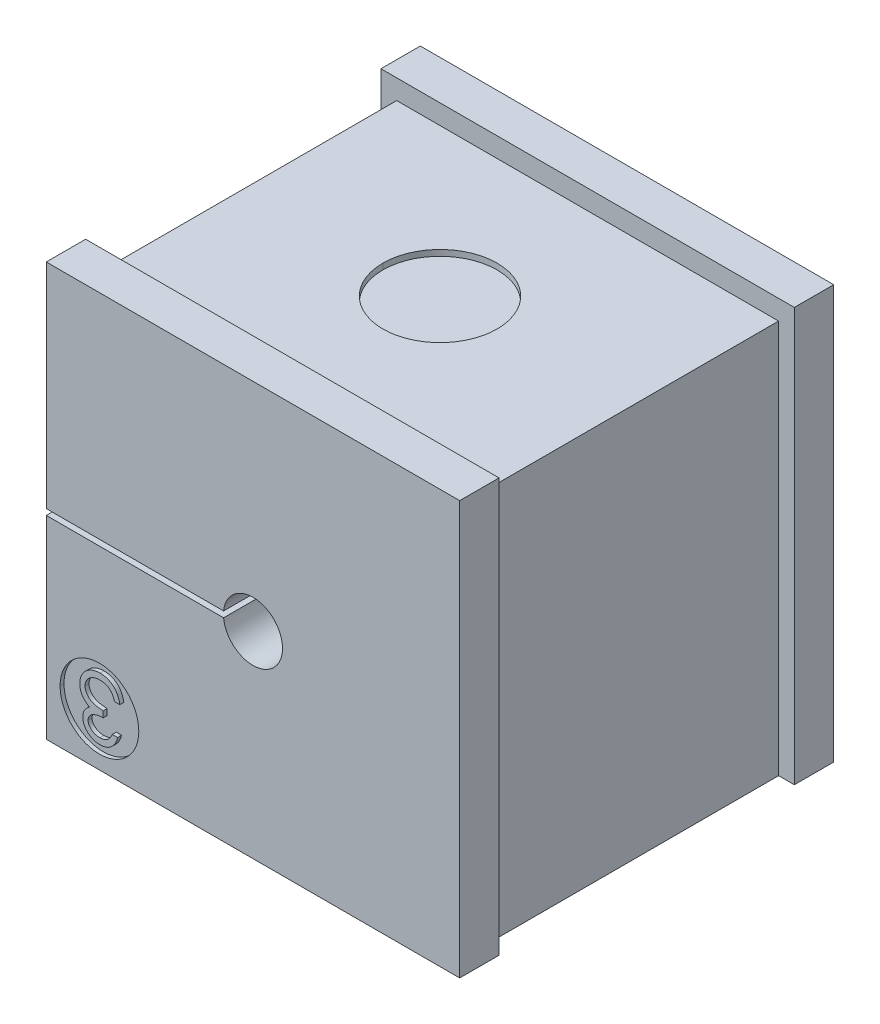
ISO-10303-21;
HEADER;
FILE_DESCRIPTION(('STEP AP214'),'2;1');
FILE_NAME('part.step','',(''),(''),'','','');
FILE_SCHEMA(('AUTOMOTIVE_DESIGN { 1 0 10303 214 1 1 1 1 }'));
ENDSEC;
DATA;
#1=APPLICATION_CONTEXT('core data for automotive mechanical design processes');
#2=APPLICATION_PROTOCOL_DEFINITION('international standard','automotive_design',2000,#1);
#3=PRODUCT_CONTEXT('',#1,'mechanical');
#4=PRODUCT('Part','Part','',(#3));
#5=PRODUCT_RELATED_PRODUCT_CATEGORY('part','',(#4));
#6=PRODUCT_DEFINITION_FORMATION('','',#4);
#7=PRODUCT_DEFINITION_CONTEXT('part definition',#1,'design');
#8=PRODUCT_DEFINITION('design','',#6,#7);
#9=PRODUCT_DEFINITION_SHAPE('','',#8);
#10=(LENGTH_UNIT() NAMED_UNIT(*) SI_UNIT(.MILLI.,.METRE.));
#11=(NAMED_UNIT(*) PLANE_ANGLE_UNIT() SI_UNIT($,.RADIAN.));
#12=(NAMED_UNIT(*) SI_UNIT($,.STERADIAN.) SOLID_ANGLE_UNIT());
#13=UNCERTAINTY_MEASURE_WITH_UNIT(LENGTH_MEASURE(1.E-05),#10,'distance_accuracy_value','');
#14=(GEOMETRIC_REPRESENTATION_CONTEXT(3) GLOBAL_UNCERTAINTY_ASSIGNED_CONTEXT((#13)) GLOBAL_UNIT_ASSIGNED_CONTEXT((#10,
#11,#12)) REPRESENTATION_CONTEXT('',''));
#15=CARTESIAN_POINT('',(0.,0.,0.));
#16=DIRECTION('',(0.,0.,1.));
#17=DIRECTION('',(1.,0.,0.));
#18=AXIS2_PLACEMENT_3D('',#15,#16,#17);
#19=CARTESIAN_POINT('',(3.11712608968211,-8.94582198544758,9.5));
#20=DIRECTION('',(0.,5.85742547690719E-13,-1.));
#21=DIRECTION('',(-1.,0.,0.));
#22=AXIS2_PLACEMENT_3D('',#19,#20,#21);
#23=PLANE('',#22);
#24=CARTESIAN_POINT('',(2.72644230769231,-9.06923076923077,9.5));
#25=CARTESIAN_POINT('',(2.76060200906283,-9.0680404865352,9.5));
#26=CARTESIAN_POINT('',(2.82732385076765,-9.06571558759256,9.5));
#27=CARTESIAN_POINT('',(2.9234923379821,-9.04528077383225,9.5));
#28=CARTESIAN_POINT('',(3.01280167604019,-9.01290391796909,9.5));
#29=CARTESIAN_POINT('',(3.08083737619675,-8.97380896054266,9.5));
#30=CARTESIAN_POINT('',(3.13116258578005,-8.9353499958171,9.5));
#31=CARTESIAN_POINT('',(3.16781398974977,-8.90226374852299,9.5));
#32=CARTESIAN_POINT('',(3.20314969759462,-8.86475072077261,9.5));
#33=CARTESIAN_POINT('',(3.23578310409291,-8.82178197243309,9.5));
#34=CARTESIAN_POINT('',(3.26766967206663,-8.77483502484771,9.5));
#35=CARTESIAN_POINT('',(3.29850493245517,-8.72365131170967,9.5));
#36=CARTESIAN_POINT('',(3.32729845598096,-8.66750110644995,9.5));
#37=CARTESIAN_POINT('',(3.34482554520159,-8.62801466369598,9.5));
#38=CARTESIAN_POINT('',(3.35384615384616,-8.60769230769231,9.5));
#39=(BOUNDED_CURVE() B_SPLINE_CURVE(3,(#24,#25,#26,#27,#28,#29,#30,#31,#32,#33,#34,#35,#36,#37,
#38),.UNSPECIFIED.,.F.,.F.) B_SPLINE_CURVE_WITH_KNOTS((4,1,1,1,1,1,1,1,1,1,1,1,4),(0.,
0.122728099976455,0.239716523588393,0.351862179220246,0.463201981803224,0.520261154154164,
0.579432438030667,0.640596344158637,0.70529822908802,0.773236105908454,0.844648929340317,
0.92004598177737,1.),
.UNSPECIFIED.) CURVE() GEOMETRIC_REPRESENTATION_ITEM() RATIONAL_B_SPLINE_CURVE((1.,1.,1.,1.,1.,
1.,1.,1.,1.,1.,1.,1.,1.,1.,1.)) REPRESENTATION_ITEM(''));
#40=CARTESIAN_POINT('',(2.72644230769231,-9.06923076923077,9.5));
#41=VERTEX_POINT('',#40);
#42=CARTESIAN_POINT('',(3.35384615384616,-8.60769230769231,9.5));
#43=VERTEX_POINT('',#42);
#44=EDGE_CURVE('E444',#41,#43,#39,.T.);
#45=ORIENTED_EDGE('',*,*,#44,.F.);
#46=CARTESIAN_POINT('',(2.12307692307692,-8.59867788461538,9.5));
#47=CARTESIAN_POINT('',(2.123424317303,-8.61434716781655,9.5));
#48=CARTESIAN_POINT('',(2.12411544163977,-8.64552046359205,9.5));
#49=CARTESIAN_POINT('',(2.13317951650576,-8.69120617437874,9.5));
#50=CARTESIAN_POINT('',(2.14617066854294,-8.73549588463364,9.5));
#51=CARTESIAN_POINT('',(2.16504418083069,-8.77787209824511,9.5));
#52=CARTESIAN_POINT('',(2.18945336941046,-8.81846952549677,9.5));
#53=CARTESIAN_POINT('',(2.21898485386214,-8.85743644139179,9.5));
#54=CARTESIAN_POINT('',(2.2537134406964,-8.89514494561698,9.5));
#55=CARTESIAN_POINT('',(2.29341360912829,-8.93076337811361,9.5));
#56=CARTESIAN_POINT('',(2.33772001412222,-8.96282059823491,9.5));
#57=CARTESIAN_POINT('',(2.38485436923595,-8.99139916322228,9.5));
#58=CARTESIAN_POINT('',(2.43500043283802,-9.01542966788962,9.5));
#59=CARTESIAN_POINT('',(2.4878314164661,-9.03534932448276,9.5));
#60=CARTESIAN_POINT('',(2.54363289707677,-9.05030732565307,9.5));
#61=CARTESIAN_POINT('',(2.60211131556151,-9.06105432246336,9.5));
#62=CARTESIAN_POINT('',(2.66338688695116,-9.06777175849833,9.5));
#63=CARTESIAN_POINT('',(2.70519117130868,-9.06873904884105,9.5));
#64=CARTESIAN_POINT('',(2.72644230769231,-9.06923076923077,9.5));
#65=(BOUNDED_CURVE() B_SPLINE_CURVE(3,(#46,#47,#48,#49,#50,#51,#52,#53,#54,#55,#56,#57,#58,#59,
#60,#61,#62,#63,#64),.UNSPECIFIED.,.F.,.F.) B_SPLINE_CURVE_WITH_KNOTS((4,1,1,1,1,1,1,1,1,1,1,1,
1,1,1,1,4),(0.,0.0552654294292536,0.109947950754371,0.163897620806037,0.218069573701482,
0.273285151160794,0.330884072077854,0.390478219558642,0.454119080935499,0.518940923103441,
0.583379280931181,0.648574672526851,0.715077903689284,0.782537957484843,0.852347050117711,
0.924940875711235,1.),
.UNSPECIFIED.) CURVE() GEOMETRIC_REPRESENTATION_ITEM() RATIONAL_B_SPLINE_CURVE((1.,1.,1.,1.,1.,
1.,1.,1.,1.,1.,1.,1.,1.,1.,1.,1.,1.,1.,1.)) REPRESENTATION_ITEM(''));
#66=CARTESIAN_POINT('',(2.12307692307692,-8.59867788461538,9.5));
#67=VERTEX_POINT('',#66);
#68=EDGE_CURVE('E473',#67,#41,#65,.T.);
#69=ORIENTED_EDGE('',*,*,#68,.F.);
#70=CARTESIAN_POINT('',(2.89230769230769,-8.10769230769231,9.5));
#71=CARTESIAN_POINT('',(2.85520684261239,-8.10841565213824,9.5));
#72=CARTESIAN_POINT('',(2.78256080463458,-8.10983201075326,9.5));
#73=CARTESIAN_POINT('',(2.67614521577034,-8.12343494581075,9.5));
#74=CARTESIAN_POINT('',(2.57469790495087,-8.14551443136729,9.5));
#75=CARTESIAN_POINT('',(2.47974478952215,-8.17634026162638,9.5));
#76=CARTESIAN_POINT('',(2.39364608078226,-8.2138682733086,9.5));
#77=CARTESIAN_POINT('',(2.31823583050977,-8.2558853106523,9.5));
#78=CARTESIAN_POINT('',(2.25622693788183,-8.3043586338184,9.5));
#79=CARTESIAN_POINT('',(2.20650881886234,-8.35699684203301,9.5));
#80=CARTESIAN_POINT('',(2.16963234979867,-8.41381103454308,9.5));
#81=CARTESIAN_POINT('',(2.14241231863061,-8.47275719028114,9.5));
#82=CARTESIAN_POINT('',(2.12631224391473,-8.53493191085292,9.5));
#83=CARTESIAN_POINT('',(2.12415916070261,-8.57735440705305,9.5));
#84=CARTESIAN_POINT('',(2.12307692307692,-8.59867788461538,9.5));
#85=(BOUNDED_CURVE() B_SPLINE_CURVE(3,(#70,#71,#72,#73,#74,#75,#76,#77,#78,#79,#80,#81,#82,#83,
#84),.UNSPECIFIED.,.F.,.F.) B_SPLINE_CURVE_WITH_KNOTS((4,1,1,1,1,1,1,1,1,1,1,1,4),(0.,
0.11015137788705,0.215684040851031,0.318037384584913,0.418136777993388,0.511655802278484,
0.596672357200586,0.673800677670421,0.744526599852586,0.810701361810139,0.874075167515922,
0.936704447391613,1.),
.UNSPECIFIED.) CURVE() GEOMETRIC_REPRESENTATION_ITEM() RATIONAL_B_SPLINE_CURVE((1.,1.,1.,1.,1.,
1.,1.,1.,1.,1.,1.,1.,1.,1.,1.)) REPRESENTATION_ITEM(''));
#86=CARTESIAN_POINT('',(2.89230769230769,-8.10769230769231,9.5));
#87=VERTEX_POINT('',#86);
#88=EDGE_CURVE('E585',#87,#67,#85,.T.);
#89=ORIENTED_EDGE('',*,*,#88,.F.);
#90=DIRECTION('',(0.,-1.,0.));
#91=VECTOR('',#90,1.);
#92=CARTESIAN_POINT('',(2.89230769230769,-7.8,9.5));
#93=LINE('',#92,#91);
#94=CARTESIAN_POINT('',(2.89230769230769,-7.8,9.5));
#95=VERTEX_POINT('',#94);
#96=EDGE_CURVE('E589',#95,#87,#93,.T.);
#97=ORIENTED_EDGE('',*,*,#96,.F.);
#98=CARTESIAN_POINT('',(1.96923076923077,-7.16538461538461,9.5));
#99=CARTESIAN_POINT('',(1.97054519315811,-7.19333543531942,9.5));
#100=CARTESIAN_POINT('',(1.97316750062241,-7.24909799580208,9.5));
#101=CARTESIAN_POINT('',(1.99310528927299,-7.33116793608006,9.5));
#102=CARTESIAN_POINT('',(2.02619339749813,-7.41027256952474,9.5));
#103=CARTESIAN_POINT('',(2.07161466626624,-7.48537595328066,9.5));
#104=CARTESIAN_POINT('',(2.12823148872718,-7.55416794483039,9.5));
#105=CARTESIAN_POINT('',(2.1933675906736,-7.61574419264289,9.5));
#106=CARTESIAN_POINT('',(2.26841277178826,-7.66701589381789,9.5));
#107=CARTESIAN_POINT('',(2.33787534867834,-7.70234142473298,9.5));
#108=CARTESIAN_POINT('',(2.39956298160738,-7.72587743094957,9.5));
#109=CARTESIAN_POINT('',(2.4522473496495,-7.74238161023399,9.5));
#110=CARTESIAN_POINT('',(2.51128182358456,-7.75557443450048,9.5));
#111=CARTESIAN_POINT('',(2.57595705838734,-7.76833598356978,9.5));
#112=CARTESIAN_POINT('',(2.64654602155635,-7.77903442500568,9.5));
#113=CARTESIAN_POINT('',(2.72311224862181,-7.78799479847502,9.5));
#114=CARTESIAN_POINT('',(2.8056865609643,-7.79515323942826,9.5));
#115=CARTESIAN_POINT('',(2.8628503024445,-7.79835175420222,9.5));
#116=CARTESIAN_POINT('',(2.89230769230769,-7.8,9.5));
#117=(BOUNDED_CURVE() B_SPLINE_CURVE(3,(#98,#99,#100,#101,#102,#103,#104,#105,#106,#107,#108,
#109,#110,#111,#112,#113,#114,#115,#116),.UNSPECIFIED.,.F.,.F.) B_SPLINE_CURVE_WITH_KNOTS((4,1,
1,1,1,1,1,1,1,1,1,1,1,1,1,1,4),(0.,0.0669025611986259,0.13347222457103,0.201015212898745,
0.271617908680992,0.342884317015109,0.413833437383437,0.485571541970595,0.559817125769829,
0.59991528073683,0.643623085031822,0.691922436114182,0.744712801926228,0.801511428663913,
0.862871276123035,0.9293353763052,1.),
.UNSPECIFIED.) CURVE() GEOMETRIC_REPRESENTATION_ITEM() RATIONAL_B_SPLINE_CURVE((1.,1.,1.,1.,1.,
1.,1.,1.,1.,1.,1.,1.,1.,1.,1.,1.,1.,1.,1.)) REPRESENTATION_ITEM(''));
#118=CARTESIAN_POINT('',(1.96923076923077,-7.16538461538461,9.5));
#119=VERTEX_POINT('',#118);
#120=EDGE_CURVE('E592',#119,#95,#117,.T.);
#121=ORIENTED_EDGE('',*,*,#120,.F.);
#122=CARTESIAN_POINT('',(2.73305288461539,-6.53076923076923,9.5));
#123=CARTESIAN_POINT('',(2.7049780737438,-6.53129629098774,9.5));
#124=CARTESIAN_POINT('',(2.65008020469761,-6.53232691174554,9.5));
#125=CARTESIAN_POINT('',(2.56998134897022,-6.54183236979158,9.5));
#126=CARTESIAN_POINT('',(2.4937559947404,-6.55561558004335,9.5));
#127=CARTESIAN_POINT('',(2.4221820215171,-6.57717520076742,9.5));
#128=CARTESIAN_POINT('',(2.35428548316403,-6.60303952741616,9.5));
#129=CARTESIAN_POINT('',(2.29158202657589,-6.63690067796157,9.5));
#130=CARTESIAN_POINT('',(2.23222824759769,-6.67514137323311,9.5));
#131=CARTESIAN_POINT('',(2.17796293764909,-6.71962265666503,9.5));
#132=CARTESIAN_POINT('',(2.12904010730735,-6.76770210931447,9.5));
#133=CARTESIAN_POINT('',(2.08676537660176,-6.8187101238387,9.5));
#134=CARTESIAN_POINT('',(2.05015062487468,-6.87106511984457,9.5));
#135=CARTESIAN_POINT('',(2.02071847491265,-6.92598843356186,9.5));
#136=CARTESIAN_POINT('',(1.99743626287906,-6.98294131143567,9.5));
#137=CARTESIAN_POINT('',(1.98159627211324,-7.04213692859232,9.5));
#138=CARTESIAN_POINT('',(1.97057995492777,-7.10307682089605,9.5));
#139=CARTESIAN_POINT('',(1.9696829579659,-7.14450173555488,9.5));
#140=CARTESIAN_POINT('',(1.96923076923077,-7.16538461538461,9.5));
#141=(BOUNDED_CURVE() B_SPLINE_CURVE(3,(#122,#123,#124,#125,#126,#127,#128,#129,#130,#131,#132,
#133,#134,#135,#136,#137,#138,#139,#140),.UNSPECIFIED.,.F.,.F.) B_SPLINE_CURVE_WITH_KNOTS((4,1,
1,1,1,1,1,1,1,1,1,1,1,1,1,1,4),(0.,0.076061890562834,0.148732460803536,0.218374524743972,
0.285722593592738,0.351057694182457,0.414934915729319,0.478485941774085,0.542169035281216,
0.604750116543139,0.664118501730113,0.721499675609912,0.777615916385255,0.832666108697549,
0.887858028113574,0.943467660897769,1.),
.UNSPECIFIED.) CURVE() GEOMETRIC_REPRESENTATION_ITEM() RATIONAL_B_SPLINE_CURVE((1.,1.,1.,1.,1.,
1.,1.,1.,1.,1.,1.,1.,1.,1.,1.,1.,1.,1.,1.)) REPRESENTATION_ITEM(''));
#142=CARTESIAN_POINT('',(2.73305288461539,-6.53076923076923,9.5));
#143=VERTEX_POINT('',#142);
#144=EDGE_CURVE('E556',#143,#119,#141,.T.);
#145=ORIENTED_EDGE('',*,*,#144,.F.);
#146=CARTESIAN_POINT('',(3.23425480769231,-6.69302884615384,9.5));
#147=CARTESIAN_POINT('',(3.21745586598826,-6.68008418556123,9.5));
#148=CARTESIAN_POINT('',(3.18390983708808,-6.65423482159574,9.5));
#149=CARTESIAN_POINT('',(3.12927951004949,-6.62115328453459,9.5));
#150=CARTESIAN_POINT('',(3.07162412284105,-6.59283627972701,9.5));
#151=CARTESIAN_POINT('',(3.0104628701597,-6.56981903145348,9.5));
#152=CARTESIAN_POINT('',(2.94578754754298,-6.55254145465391,9.5));
#153=CARTESIAN_POINT('',(2.87786050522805,-6.54010586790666,9.5));
#154=CARTESIAN_POINT('',(2.80657029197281,-6.53189644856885,9.5));
#155=CARTESIAN_POINT('',(2.75791611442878,-6.53115045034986,9.5));
#156=CARTESIAN_POINT('',(2.73305288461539,-6.53076923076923,9.5));
#157=(BOUNDED_CURVE() B_SPLINE_CURVE(3,(#146,#147,#148,#149,#150,#151,#152,#153,#154,#155,#156),
.UNSPECIFIED.,.F.,.F.) B_SPLINE_CURVE_WITH_KNOTS((4,1,1,1,1,1,1,1,4),(0.,0.118260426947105,
0.236155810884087,0.355630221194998,0.476249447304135,0.600164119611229,0.728633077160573,
0.861326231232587,1.),
.UNSPECIFIED.) CURVE() GEOMETRIC_REPRESENTATION_ITEM() RATIONAL_B_SPLINE_CURVE((1.,1.,1.,1.,1.,
1.,1.,1.,1.,1.,1.)) REPRESENTATION_ITEM(''));
#158=CARTESIAN_POINT('',(3.23425480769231,-6.69302884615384,9.5));
#159=VERTEX_POINT('',#158);
#160=EDGE_CURVE('E363',#159,#143,#157,.T.);
#161=ORIENTED_EDGE('',*,*,#160,.F.);
#162=CARTESIAN_POINT('',(3.46923076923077,-7.10769230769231,9.5));
#163=CARTESIAN_POINT('',(3.46221651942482,-7.08459315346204,9.5));
#164=CARTESIAN_POINT('',(3.44857319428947,-7.03966329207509,9.5));
#165=CARTESIAN_POINT('',(3.42534951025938,-6.9750001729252,9.5));
#166=CARTESIAN_POINT('',(3.39889099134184,-6.91572184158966,9.5));
#167=CARTESIAN_POINT('',(3.37050708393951,-6.86139345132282,9.5));
#168=CARTESIAN_POINT('',(3.3406969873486,-6.81147996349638,9.5));
#169=CARTESIAN_POINT('',(3.30734133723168,-6.76730121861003,9.5));
#170=CARTESIAN_POINT('',(3.27291064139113,-6.72691675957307,9.5));
#171=CARTESIAN_POINT('',(3.24695690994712,-6.70416423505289,9.5));
#172=CARTESIAN_POINT('',(3.23425480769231,-6.69302884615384,9.5));
#173=(BOUNDED_CURVE() B_SPLINE_CURVE(3,(#162,#163,#164,#165,#166,#167,#168,#169,#170,#171,#172),
.UNSPECIFIED.,.F.,.F.) B_SPLINE_CURVE_WITH_KNOTS((4,1,1,1,1,1,1,1,4),(0.,0.149770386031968,
0.291316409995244,0.425966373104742,0.552159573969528,0.671527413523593,0.786121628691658,
0.895325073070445,1.),
.UNSPECIFIED.) CURVE() GEOMETRIC_REPRESENTATION_ITEM() RATIONAL_B_SPLINE_CURVE((1.,1.,1.,1.,1.,
1.,1.,1.,1.,1.,1.)) REPRESENTATION_ITEM(''));
#174=CARTESIAN_POINT('',(3.46923076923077,-7.10769230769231,9.5));
#175=VERTEX_POINT('',#174);
#176=EDGE_CURVE('E360',#175,#159,#173,.T.);
#177=ORIENTED_EDGE('',*,*,#176,.F.);
#178=DIRECTION('',(-1.,0.,0.));
#179=VECTOR('',#178,1.);
#180=CARTESIAN_POINT('',(3.73846153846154,-7.10769230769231,9.5));
#181=LINE('',#180,#179);
#182=CARTESIAN_POINT('',(3.73846153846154,-7.10769230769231,9.5));
#183=VERTEX_POINT('',#182);
#184=EDGE_CURVE('E346',#183,#175,#181,.T.);
#185=ORIENTED_EDGE('',*,*,#184,.F.);
#186=CARTESIAN_POINT('',(2.73786057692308,-6.22307692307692,9.5));
#187=CARTESIAN_POINT('',(2.76993224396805,-6.22382759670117,9.5));
#188=CARTESIAN_POINT('',(2.83303859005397,-6.22530467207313,9.5));
#189=CARTESIAN_POINT('',(2.92584748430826,-6.23522246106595,9.5));
#190=CARTESIAN_POINT('',(3.01425018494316,-6.25382895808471,9.5));
#191=CARTESIAN_POINT('',(3.09910511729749,-6.27722920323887,9.5));
#192=CARTESIAN_POINT('',(3.17913161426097,-6.30958266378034,9.5));
#193=CARTESIAN_POINT('',(3.25548078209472,-6.34815398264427,9.5));
#194=CARTESIAN_POINT('',(3.32781795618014,-6.39393227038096,9.5));
#195=CARTESIAN_POINT('',(3.3957135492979,-6.44699451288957,9.5));
#196=CARTESIAN_POINT('',(3.45909502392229,-6.50638975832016,9.5));
#197=CARTESIAN_POINT('',(3.51634762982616,-6.57310472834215,9.5));
#198=CARTESIAN_POINT('',(3.56810480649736,-6.64589428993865,9.5));
#199=CARTESIAN_POINT('',(3.61403769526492,-6.72541319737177,9.5));
#200=CARTESIAN_POINT('',(3.65433960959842,-6.81143872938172,9.5));
#201=CARTESIAN_POINT('',(3.68814324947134,-6.90431560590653,9.5));
#202=CARTESIAN_POINT('',(3.71765800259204,-7.00332380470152,9.5));
#203=CARTESIAN_POINT('',(3.73140719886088,-7.07230164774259,9.5));
#204=CARTESIAN_POINT('',(3.73846153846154,-7.10769230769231,9.5));
#205=(BOUNDED_CURVE() B_SPLINE_CURVE(3,(#186,#187,#188,#189,#190,#191,#192,#193,#194,#195,#196,
#197,#198,#199,#200,#201,#202,#203,#204),.UNSPECIFIED.,.F.,.F.) B_SPLINE_CURVE_WITH_KNOTS((4,1,
1,1,1,1,1,1,1,1,1,1,1,1,1,1,4),(0.,0.0655377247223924,0.128956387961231,0.190367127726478,
0.249965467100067,0.308568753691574,0.366415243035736,0.424556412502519,0.483181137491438,
0.542251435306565,0.601744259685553,0.662507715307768,0.724499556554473,0.789138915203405,
0.85635395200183,0.926299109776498,1.),
.UNSPECIFIED.) CURVE() GEOMETRIC_REPRESENTATION_ITEM() RATIONAL_B_SPLINE_CURVE((1.,1.,1.,1.,1.,
1.,1.,1.,1.,1.,1.,1.,1.,1.,1.,1.,1.,1.,1.)) REPRESENTATION_ITEM(''));
#206=CARTESIAN_POINT('',(2.73786057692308,-6.22307692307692,9.5));
#207=VERTEX_POINT('',#206);
#208=EDGE_CURVE('E413',#207,#183,#205,.T.);
#209=ORIENTED_EDGE('',*,*,#208,.F.);
#210=CARTESIAN_POINT('',(1.7,-7.19122596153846,9.5));
#211=CARTESIAN_POINT('',(1.70154176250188,-7.14921951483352,9.5));
#212=CARTESIAN_POINT('',(1.7046180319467,-7.06540430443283,9.5));
#213=CARTESIAN_POINT('',(1.73199597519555,-6.94154054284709,9.5));
#214=CARTESIAN_POINT('',(1.77470210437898,-6.82068677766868,9.5));
#215=CARTESIAN_POINT('',(1.83422017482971,-6.70455694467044,9.5));
#216=CARTESIAN_POINT('',(1.90819212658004,-6.59623357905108,9.5));
#217=CARTESIAN_POINT('',(1.99571100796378,-6.49903463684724,9.5));
#218=CARTESIAN_POINT('',(2.09687000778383,-6.41624728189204,9.5));
#219=CARTESIAN_POINT('',(2.20872381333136,-6.34646269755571,9.5));
#220=CARTESIAN_POINT('',(2.33037506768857,-6.29115920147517,9.5));
#221=CARTESIAN_POINT('',(2.45997364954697,-6.25130855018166,9.5));
#222=CARTESIAN_POINT('',(2.59675224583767,-6.22740374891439,9.5));
#223=CARTESIAN_POINT('',(2.69028894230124,-6.22453561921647,9.5));
#224=CARTESIAN_POINT('',(2.73786057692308,-6.22307692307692,9.5));
#225=(BOUNDED_CURVE() B_SPLINE_CURVE(3,(#210,#211,#212,#213,#214,#215,#216,#217,#218,#219,#220,
#221,#222,#223,#224),.UNSPECIFIED.,.F.,.F.) B_SPLINE_CURVE_WITH_KNOTS((4,1,1,1,1,1,1,1,1,1,1,1,
4),(0.,0.0796349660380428,0.158895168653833,0.239579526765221,0.322382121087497,
0.405793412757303,0.487884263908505,0.56971058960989,0.653048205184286,0.737433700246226,
0.822572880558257,0.909762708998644,1.),
.UNSPECIFIED.) CURVE() GEOMETRIC_REPRESENTATION_ITEM() RATIONAL_B_SPLINE_CURVE((1.,1.,1.,1.,1.,
1.,1.,1.,1.,1.,1.,1.,1.,1.,1.)) REPRESENTATION_ITEM(''));
#226=CARTESIAN_POINT('',(1.7,-7.19122596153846,9.5));
#227=VERTEX_POINT('',#226);
#228=EDGE_CURVE('E466',#227,#207,#225,.T.);
#229=ORIENTED_EDGE('',*,*,#228,.F.);
#230=CARTESIAN_POINT('',(1.87908653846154,-7.72427884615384,9.5));
#231=CARTESIAN_POINT('',(1.86464522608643,-7.70451716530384,9.5));
#232=CARTESIAN_POINT('',(1.83599908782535,-7.66531741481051,9.5));
#233=CARTESIAN_POINT('',(1.8007401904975,-7.60225542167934,9.5));
#234=CARTESIAN_POINT('',(1.76838777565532,-7.53870322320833,9.5));
#235=CARTESIAN_POINT('',(1.74457733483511,-7.47216202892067,9.5));
#236=CARTESIAN_POINT('',(1.72402986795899,-7.40476925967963,9.5));
#237=CARTESIAN_POINT('',(1.71051031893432,-7.33508176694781,9.5));
#238=CARTESIAN_POINT('',(1.70183130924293,-7.26376164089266,9.5));
#239=CARTESIAN_POINT('',(1.70061259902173,-7.21549017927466,9.5));
#240=CARTESIAN_POINT('',(1.7,-7.19122596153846,9.5));
#241=(BOUNDED_CURVE() B_SPLINE_CURVE(3,(#230,#231,#232,#233,#234,#235,#236,#237,#238,#239,#240),
.UNSPECIFIED.,.F.,.F.) B_SPLINE_CURVE_WITH_KNOTS((4,1,1,1,1,1,1,1,4),(0.,0.128145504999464,
0.254192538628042,0.378141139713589,0.501380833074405,0.623956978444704,0.747075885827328,
0.87286472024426,1.),
.UNSPECIFIED.) CURVE() GEOMETRIC_REPRESENTATION_ITEM() RATIONAL_B_SPLINE_CURVE((1.,1.,1.,1.,1.,
1.,1.,1.,1.,1.,1.)) REPRESENTATION_ITEM(''));
#242=CARTESIAN_POINT('',(1.87908653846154,-7.72427884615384,9.5));
#243=VERTEX_POINT('',#242);
#244=EDGE_CURVE('E603',#243,#227,#241,.T.);
#245=ORIENTED_EDGE('',*,*,#244,.F.);
#246=CARTESIAN_POINT('',(2.20420673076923,-7.98028846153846,9.5));
#247=CARTESIAN_POINT('',(2.17225312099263,-7.96493446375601,9.5));
#248=CARTESIAN_POINT('',(2.1088411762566,-7.93446445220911,9.5));
#249=CARTESIAN_POINT('',(2.02327995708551,-7.8737586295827,9.5));
#250=CARTESIAN_POINT('',(1.94442411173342,-7.80538880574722,9.5));
#251=CARTESIAN_POINT('',(1.90096458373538,-7.75143821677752,9.5));
#252=CARTESIAN_POINT('',(1.87908653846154,-7.72427884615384,9.5));
#253=(BOUNDED_CURVE() B_SPLINE_CURVE(3,(#246,#247,#248,#249,#250,#251,#252),.UNSPECIFIED.,.F.,
.F.) B_SPLINE_CURVE_WITH_KNOTS((4,1,1,1,4),(0.,0.253915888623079,0.503896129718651,
0.7502553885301,1.),
.UNSPECIFIED.) CURVE() GEOMETRIC_REPRESENTATION_ITEM() RATIONAL_B_SPLINE_CURVE((1.,1.,1.,1.,1.,
1.,1.)) REPRESENTATION_ITEM(''));
#254=CARTESIAN_POINT('',(2.20420673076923,-7.98028846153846,9.5));
#255=VERTEX_POINT('',#254);
#256=EDGE_CURVE('E716',#255,#243,#253,.T.);
#257=ORIENTED_EDGE('',*,*,#256,.F.);
#258=CARTESIAN_POINT('',(1.85384615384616,-8.59747596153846,9.5));
#259=CARTESIAN_POINT('',(1.85484351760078,-8.56575585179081,9.5));
#260=CARTESIAN_POINT('',(1.85679520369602,-8.50368451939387,9.5));
#261=CARTESIAN_POINT('',(1.87336695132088,-8.41306609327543,9.5));
#262=CARTESIAN_POINT('',(1.90125517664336,-8.32765900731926,9.5));
#263=CARTESIAN_POINT('',(1.9398864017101,-8.24710372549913,9.5));
#264=CARTESIAN_POINT('',(1.9898934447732,-8.17191100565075,9.5));
#265=CARTESIAN_POINT('',(2.05047004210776,-8.10191167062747,9.5));
#266=CARTESIAN_POINT('',(2.12204375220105,-8.03679524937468,9.5));
#267=CARTESIAN_POINT('',(2.17628284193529,-7.99949284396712,9.5));
#268=CARTESIAN_POINT('',(2.20420673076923,-7.98028846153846,9.5));
#269=(BOUNDED_CURVE() B_SPLINE_CURVE(3,(#258,#259,#260,#261,#262,#263,#264,#265,#266,#267,#268),
.UNSPECIFIED.,.F.,.F.) B_SPLINE_CURVE_WITH_KNOTS((4,1,1,1,1,1,1,1,4),(0.,0.128067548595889,
0.250608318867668,0.370630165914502,0.490072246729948,0.610374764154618,0.734313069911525,
0.863216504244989,1.),
.UNSPECIFIED.) CURVE() GEOMETRIC_REPRESENTATION_ITEM() RATIONAL_B_SPLINE_CURVE((1.,1.,1.,1.,1.,
1.,1.,1.,1.,1.,1.)) REPRESENTATION_ITEM(''));
#270=CARTESIAN_POINT('',(1.85384615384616,-8.59747596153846,9.5));
#271=VERTEX_POINT('',#270);
#272=EDGE_CURVE('E607',#271,#255,#269,.T.);
#273=ORIENTED_EDGE('',*,*,#272,.F.);
#274=CARTESIAN_POINT('',(2.73004807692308,-9.37692307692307,9.5));
#275=CARTESIAN_POINT('',(2.69089144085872,-9.37574087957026,9.5));
#276=CARTESIAN_POINT('',(2.61343228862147,-9.37340227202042,9.5));
#277=CARTESIAN_POINT('',(2.49963539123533,-9.35204704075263,9.5));
#278=CARTESIAN_POINT('',(2.38989811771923,-9.31825407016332,9.5));
#279=CARTESIAN_POINT('',(2.28542161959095,-9.27156230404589,9.5));
#280=CARTESIAN_POINT('',(2.18837724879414,-9.21397317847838,9.5));
#281=CARTESIAN_POINT('',(2.10203194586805,-9.14543197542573,9.5));
#282=CARTESIAN_POINT('',(2.02755607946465,-9.06726114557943,9.5));
#283=CARTESIAN_POINT('',(1.96507518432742,-8.98091894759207,9.5));
#284=CARTESIAN_POINT('',(1.91615375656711,-8.88864279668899,9.5));
#285=CARTESIAN_POINT('',(1.88007972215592,-8.79367123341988,9.5));
#286=CARTESIAN_POINT('',(1.85811828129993,-8.69622954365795,9.5));
#287=CARTESIAN_POINT('',(1.85527208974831,-8.63043759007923,9.5));
#288=CARTESIAN_POINT('',(1.85384615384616,-8.59747596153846,9.5));
#289=(BOUNDED_CURVE() B_SPLINE_CURVE(3,(#274,#275,#276,#277,#278,#279,#280,#281,#282,#283,#284,
#285,#286,#287,#288),.UNSPECIFIED.,.F.,.F.) B_SPLINE_CURVE_WITH_KNOTS((4,1,1,1,1,1,1,1,1,1,1,1,
4),(0.,0.0902542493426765,0.178539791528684,0.266093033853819,0.354630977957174,
0.441886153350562,0.525746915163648,0.608113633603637,0.690197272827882,0.770821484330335,
0.84832618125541,0.924011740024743,1.),
.UNSPECIFIED.) CURVE() GEOMETRIC_REPRESENTATION_ITEM() RATIONAL_B_SPLINE_CURVE((1.,1.,1.,1.,1.,
1.,1.,1.,1.,1.,1.,1.,1.,1.,1.)) REPRESENTATION_ITEM(''));
#290=CARTESIAN_POINT('',(2.73004807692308,-9.37692307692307,9.5));
#291=VERTEX_POINT('',#290);
#292=EDGE_CURVE('E606',#291,#271,#289,.T.);
#293=ORIENTED_EDGE('',*,*,#292,.F.);
#294=CARTESIAN_POINT('',(3.62307692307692,-8.60769230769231,9.5));
#295=CARTESIAN_POINT('',(3.61578302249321,-8.6378915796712,9.5));
#296=CARTESIAN_POINT('',(3.60152404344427,-8.69692868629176,9.5));
#297=CARTESIAN_POINT('',(3.57178326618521,-8.78127776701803,9.5));
#298=CARTESIAN_POINT('',(3.53938390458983,-8.86109792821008,9.5));
#299=CARTESIAN_POINT('',(3.50047895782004,-8.93489456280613,9.5));
#300=CARTESIAN_POINT('',(3.45804288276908,-9.00415076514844,9.5));
#301=CARTESIAN_POINT('',(3.4094234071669,-9.06729572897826,9.5));
#302=CARTESIAN_POINT('',(3.35686364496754,-9.12593541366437,9.5));
#303=CARTESIAN_POINT('',(3.29872797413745,-9.17797533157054,9.5));
#304=CARTESIAN_POINT('',(3.2377605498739,-9.225099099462,9.5));
#305=CARTESIAN_POINT('',(3.17310230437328,-9.26527772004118,9.5));
#306=CARTESIAN_POINT('',(3.10605410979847,-9.29984127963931,9.5));
#307=CARTESIAN_POINT('',(3.03615142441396,-9.32831576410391,9.5));
#308=CARTESIAN_POINT('',(2.96318613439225,-9.34976621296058,9.5));
#309=CARTESIAN_POINT('',(2.88781788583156,-9.36532918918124,9.5));
#310=CARTESIAN_POINT('',(2.80984917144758,-9.37543585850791,9.5));
#311=CARTESIAN_POINT('',(2.75692266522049,-9.37642222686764,9.5));
#312=CARTESIAN_POINT('',(2.73004807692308,-9.37692307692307,9.5));
#313=(BOUNDED_CURVE() B_SPLINE_CURVE(3,(#294,#295,#296,#297,#298,#299,#300,#301,#302,#303,#304,
#305,#306,#307,#308,#309,#310,#311,#312),.UNSPECIFIED.,.F.,.F.) B_SPLINE_CURVE_WITH_KNOTS((4,1,
1,1,1,1,1,1,1,1,1,1,1,1,1,1,4),(0.,0.0726253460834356,0.141976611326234,0.208984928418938,
0.273956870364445,0.336889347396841,0.39874495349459,0.460115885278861,0.520824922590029,
0.580994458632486,0.640151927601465,0.698622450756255,0.757271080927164,0.81642669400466,
0.876254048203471,0.937165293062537,1.),
.UNSPECIFIED.) CURVE() GEOMETRIC_REPRESENTATION_ITEM() RATIONAL_B_SPLINE_CURVE((1.,1.,1.,1.,1.,
1.,1.,1.,1.,1.,1.,1.,1.,1.,1.,1.,1.,1.,1.)) REPRESENTATION_ITEM(''));
#314=CARTESIAN_POINT('',(3.62307692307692,-8.60769230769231,9.5));
#315=VERTEX_POINT('',#314);
#316=EDGE_CURVE('E25',#315,#291,#313,.T.);
#317=ORIENTED_EDGE('',*,*,#316,.F.);
#318=DIRECTION('',(1.,0.,0.));
#319=VECTOR('',#318,1.);
#320=CARTESIAN_POINT('',(3.35384615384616,-8.60769230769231,9.5));
#321=LINE('',#320,#319);
#322=EDGE_CURVE('E9',#43,#315,#321,.T.);
#323=ORIENTED_EDGE('',*,*,#322,.F.);
#324=EDGE_LOOP('',(#45,#69,#89,#97,#121,#145,#161,#177,#185,#209,#229,#245,#257,#273,#293,#317,#323));
#325=FACE_BOUND('',#324,.T.);
#326=ADVANCED_FACE('F15',(#325),#23,.F.);
#327=CARTESIAN_POINT('',(3.35384615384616,-8.60769230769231,9.5));
#328=DIRECTION('',(0.,1.,0.));
#329=DIRECTION('',(1.,0.,0.));
#330=AXIS2_PLACEMENT_3D('',#327,#328,#329);
#331=PLANE('',#330);
#332=DIRECTION('',(1.,0.,0.));
#333=VECTOR('',#332,1.);
#334=CARTESIAN_POINT('',(3.35384615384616,-8.60769230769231,9.3));
#335=LINE('',#334,#333);
#336=CARTESIAN_POINT('',(3.35384615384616,-8.60769230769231,9.3));
#337=VERTEX_POINT('',#336);
#338=CARTESIAN_POINT('',(3.62307692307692,-8.60769230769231,9.3));
#339=VERTEX_POINT('',#338);
#340=EDGE_CURVE('E508',#337,#339,#335,.T.);
#341=ORIENTED_EDGE('',*,*,#340,.F.);
#342=DIRECTION('',(0.,0.,-1.));
#343=VECTOR('',#342,1.);
#344=CARTESIAN_POINT('',(3.35384615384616,-8.60769230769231,9.5));
#345=LINE('',#344,#343);
#346=EDGE_CURVE('E453',#43,#337,#345,.T.);
#347=ORIENTED_EDGE('',*,*,#346,.F.);
#348=ORIENTED_EDGE('',*,*,#322,.T.);
#349=DIRECTION('',(0.,0.,-1.));
#350=VECTOR('',#349,1.);
#351=CARTESIAN_POINT('',(3.62307692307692,-8.60769230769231,9.5));
#352=LINE('',#351,#350);
#353=EDGE_CURVE('E18',#315,#339,#352,.T.);
#354=ORIENTED_EDGE('',*,*,#353,.T.);
#355=EDGE_LOOP('',(#341,#347,#348,#354));
#356=FACE_BOUND('',#355,.T.);
#357=ADVANCED_FACE('F625',(#356),#331,.T.);
#358=CARTESIAN_POINT('',(3.62307692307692,-8.60769230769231,9.5));
#359=CARTESIAN_POINT('',(3.62307692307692,-8.60769230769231,9.3));
#360=CARTESIAN_POINT('',(3.61578302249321,-8.6378915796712,9.5));
#361=CARTESIAN_POINT('',(3.61578302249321,-8.6378915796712,9.3));
#362=CARTESIAN_POINT('',(3.60152404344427,-8.69692868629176,9.5));
#363=CARTESIAN_POINT('',(3.60152404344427,-8.69692868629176,9.3));
#364=CARTESIAN_POINT('',(3.57178326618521,-8.78127776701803,9.5));
#365=CARTESIAN_POINT('',(3.57178326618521,-8.78127776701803,9.3));
#366=CARTESIAN_POINT('',(3.53938390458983,-8.86109792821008,9.5));
#367=CARTESIAN_POINT('',(3.53938390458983,-8.86109792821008,9.3));
#368=CARTESIAN_POINT('',(3.50047895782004,-8.93489456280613,9.5));
#369=CARTESIAN_POINT('',(3.50047895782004,-8.93489456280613,9.3));
#370=CARTESIAN_POINT('',(3.45804288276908,-9.00415076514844,9.5));
#371=CARTESIAN_POINT('',(3.45804288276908,-9.00415076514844,9.3));
#372=CARTESIAN_POINT('',(3.4094234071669,-9.06729572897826,9.5));
#373=CARTESIAN_POINT('',(3.4094234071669,-9.06729572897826,9.3));
#374=CARTESIAN_POINT('',(3.35686364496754,-9.12593541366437,9.5));
#375=CARTESIAN_POINT('',(3.35686364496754,-9.12593541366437,9.3));
#376=CARTESIAN_POINT('',(3.29872797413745,-9.17797533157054,9.5));
#377=CARTESIAN_POINT('',(3.29872797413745,-9.17797533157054,9.3));
#378=CARTESIAN_POINT('',(3.2377605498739,-9.225099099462,9.5));
#379=CARTESIAN_POINT('',(3.2377605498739,-9.225099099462,9.3));
#380=CARTESIAN_POINT('',(3.17310230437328,-9.26527772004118,9.5));
#381=CARTESIAN_POINT('',(3.17310230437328,-9.26527772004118,9.3));
#382=CARTESIAN_POINT('',(3.10605410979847,-9.29984127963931,9.5));
#383=CARTESIAN_POINT('',(3.10605410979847,-9.29984127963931,9.3));
#384=CARTESIAN_POINT('',(3.03615142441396,-9.32831576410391,9.5));
#385=CARTESIAN_POINT('',(3.03615142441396,-9.32831576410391,9.3));
#386=CARTESIAN_POINT('',(2.96318613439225,-9.34976621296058,9.5));
#387=CARTESIAN_POINT('',(2.96318613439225,-9.34976621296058,9.3));
#388=CARTESIAN_POINT('',(2.88781788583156,-9.36532918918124,9.5));
#389=CARTESIAN_POINT('',(2.88781788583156,-9.36532918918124,9.3));
#390=CARTESIAN_POINT('',(2.80984917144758,-9.37543585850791,9.5));
#391=CARTESIAN_POINT('',(2.80984917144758,-9.37543585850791,9.3));
#392=CARTESIAN_POINT('',(2.75692266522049,-9.37642222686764,9.5));
#393=CARTESIAN_POINT('',(2.75692266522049,-9.37642222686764,9.3));
#394=CARTESIAN_POINT('',(2.73004807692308,-9.37692307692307,9.5));
#395=CARTESIAN_POINT('',(2.73004807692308,-9.37692307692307,9.3));
#396=(BOUNDED_SURFACE() B_SPLINE_SURFACE(3,1,((#358,#359),(#360,#361),(#362,#363),(#364,#365),
(#366,#367),(#368,#369),(#370,#371),(#372,#373),(#374,#375),(#376,#377),(#378,#379),(#380,#381),
(#382,#383),(#384,#385),(#386,#387),(#388,#389),(#390,#391),(#392,#393),(#394,#395)),
.UNSPECIFIED.,.F.,.F.,.F.) B_SPLINE_SURFACE_WITH_KNOTS((4,1,1,1,1,1,1,1,1,1,1,1,1,1,1,1,4),(2,
2),(0.,0.0726253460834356,0.141976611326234,0.208984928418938,0.273956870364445,
0.336889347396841,0.39874495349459,0.460115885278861,0.520824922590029,0.580994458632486,
0.640151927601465,0.698622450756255,0.757271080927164,0.81642669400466,0.876254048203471,
0.937165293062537,1.),(0.,1.),
.UNSPECIFIED.) GEOMETRIC_REPRESENTATION_ITEM() RATIONAL_B_SPLINE_SURFACE(((1.,1.),(1.,1.),(1.,
1.),(1.,1.),(1.,1.),(1.,1.),(1.,1.),(1.,1.),(1.,1.),(1.,1.),(1.,1.),(1.,1.),(1.,1.),(1.,1.),(1.,
1.),(1.,1.),(1.,1.),(1.,1.),(1.,1.))) REPRESENTATION_ITEM('') SURFACE());
#397=CARTESIAN_POINT('',(3.62307692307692,-8.60769230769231,9.3));
#398=CARTESIAN_POINT('',(3.61578302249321,-8.6378915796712,9.3));
#399=CARTESIAN_POINT('',(3.60152404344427,-8.69692868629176,9.3));
#400=CARTESIAN_POINT('',(3.57178326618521,-8.78127776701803,9.3));
#401=CARTESIAN_POINT('',(3.53938390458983,-8.86109792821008,9.3));
#402=CARTESIAN_POINT('',(3.50047895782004,-8.93489456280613,9.3));
#403=CARTESIAN_POINT('',(3.45804288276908,-9.00415076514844,9.3));
#404=CARTESIAN_POINT('',(3.4094234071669,-9.06729572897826,9.3));
#405=CARTESIAN_POINT('',(3.35686364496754,-9.12593541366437,9.3));
#406=CARTESIAN_POINT('',(3.29872797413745,-9.17797533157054,9.3));
#407=CARTESIAN_POINT('',(3.2377605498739,-9.225099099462,9.3));
#408=CARTESIAN_POINT('',(3.17310230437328,-9.26527772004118,9.3));
#409=CARTESIAN_POINT('',(3.10605410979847,-9.29984127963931,9.3));
#410=CARTESIAN_POINT('',(3.03615142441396,-9.32831576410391,9.3));
#411=CARTESIAN_POINT('',(2.96318613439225,-9.34976621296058,9.3));
#412=CARTESIAN_POINT('',(2.88781788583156,-9.36532918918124,9.3));
#413=CARTESIAN_POINT('',(2.80984917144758,-9.37543585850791,9.3));
#414=CARTESIAN_POINT('',(2.75692266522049,-9.37642222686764,9.3));
#415=CARTESIAN_POINT('',(2.73004807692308,-9.37692307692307,9.3));
#416=(BOUNDED_CURVE() B_SPLINE_CURVE(3,(#397,#398,#399,#400,#401,#402,#403,#404,#405,#406,#407,
#408,#409,#410,#411,#412,#413,#414,#415),.UNSPECIFIED.,.F.,.F.) B_SPLINE_CURVE_WITH_KNOTS((4,1,
1,1,1,1,1,1,1,1,1,1,1,1,1,1,4),(0.,0.0726253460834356,0.141976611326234,0.208984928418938,
0.273956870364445,0.336889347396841,0.39874495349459,0.460115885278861,0.520824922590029,
0.580994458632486,0.640151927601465,0.698622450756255,0.757271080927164,0.81642669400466,
0.876254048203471,0.937165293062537,1.),
.UNSPECIFIED.) CURVE() GEOMETRIC_REPRESENTATION_ITEM() RATIONAL_B_SPLINE_CURVE((1.,1.,1.,1.,1.,
1.,1.,1.,1.,1.,1.,1.,1.,1.,1.,1.,1.,1.,1.)) REPRESENTATION_ITEM(''));
#417=CARTESIAN_POINT('',(2.73004807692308,-9.37692307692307,9.3));
#418=VERTEX_POINT('',#417);
#419=EDGE_CURVE('E515',#339,#418,#416,.T.);
#420=DIRECTION('',(0.,0.,-1.));
#421=VECTOR('',#420,1.);
#422=CARTESIAN_POINT('',(2.73004807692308,-9.37692307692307,9.5));
#423=LINE('',#422,#421);
#424=EDGE_CURVE('E604',#291,#418,#423,.T.);
#425=ORIENTED_EDGE('',*,*,#419,.F.);
#426=ORIENTED_EDGE('',*,*,#353,.F.);
#427=ORIENTED_EDGE('',*,*,#316,.T.);
#428=ORIENTED_EDGE('',*,*,#424,.T.);
#429=EDGE_LOOP('',(#425,#426,#427,#428));
#430=FACE_BOUND('',#429,.T.);
#431=ADVANCED_FACE('F628',(#430),#396,.T.);
#432=CARTESIAN_POINT('',(2.73004807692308,-9.37692307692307,9.5));
#433=CARTESIAN_POINT('',(2.73004807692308,-9.37692307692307,9.3));
#434=CARTESIAN_POINT('',(2.69089144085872,-9.37574087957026,9.5));
#435=CARTESIAN_POINT('',(2.69089144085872,-9.37574087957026,9.3));
#436=CARTESIAN_POINT('',(2.61343228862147,-9.37340227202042,9.5));
#437=CARTESIAN_POINT('',(2.61343228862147,-9.37340227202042,9.3));
#438=CARTESIAN_POINT('',(2.49963539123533,-9.35204704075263,9.5));
#439=CARTESIAN_POINT('',(2.49963539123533,-9.35204704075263,9.3));
#440=CARTESIAN_POINT('',(2.38989811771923,-9.31825407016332,9.5));
#441=CARTESIAN_POINT('',(2.38989811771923,-9.31825407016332,9.3));
#442=CARTESIAN_POINT('',(2.28542161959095,-9.27156230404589,9.5));
#443=CARTESIAN_POINT('',(2.28542161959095,-9.27156230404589,9.3));
#444=CARTESIAN_POINT('',(2.18837724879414,-9.21397317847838,9.5));
#445=CARTESIAN_POINT('',(2.18837724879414,-9.21397317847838,9.3));
#446=CARTESIAN_POINT('',(2.10203194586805,-9.14543197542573,9.5));
#447=CARTESIAN_POINT('',(2.10203194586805,-9.14543197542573,9.3));
#448=CARTESIAN_POINT('',(2.02755607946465,-9.06726114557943,9.5));
#449=CARTESIAN_POINT('',(2.02755607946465,-9.06726114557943,9.3));
#450=CARTESIAN_POINT('',(1.96507518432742,-8.98091894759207,9.5));
#451=CARTESIAN_POINT('',(1.96507518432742,-8.98091894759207,9.3));
#452=CARTESIAN_POINT('',(1.91615375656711,-8.88864279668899,9.5));
#453=CARTESIAN_POINT('',(1.91615375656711,-8.88864279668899,9.3));
#454=CARTESIAN_POINT('',(1.88007972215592,-8.79367123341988,9.5));
#455=CARTESIAN_POINT('',(1.88007972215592,-8.79367123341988,9.3));
#456=CARTESIAN_POINT('',(1.85811828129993,-8.69622954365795,9.5));
#457=CARTESIAN_POINT('',(1.85811828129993,-8.69622954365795,9.3));
#458=CARTESIAN_POINT('',(1.85527208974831,-8.63043759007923,9.5));
#459=CARTESIAN_POINT('',(1.85527208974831,-8.63043759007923,9.3));
#460=CARTESIAN_POINT('',(1.85384615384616,-8.59747596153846,9.5));
#461=CARTESIAN_POINT('',(1.85384615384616,-8.59747596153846,9.3));
#462=(BOUNDED_SURFACE() B_SPLINE_SURFACE(3,1,((#432,#433),(#434,#435),(#436,#437),(#438,#439),
(#440,#441),(#442,#443),(#444,#445),(#446,#447),(#448,#449),(#450,#451),(#452,#453),(#454,#455),
(#456,#457),(#458,#459),(#460,#461)),.UNSPECIFIED.,.F.,.F.,.F.) B_SPLINE_SURFACE_WITH_KNOTS((4,
1,1,1,1,1,1,1,1,1,1,1,4),(2,2),(0.,0.0902542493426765,0.178539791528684,0.266093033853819,
0.354630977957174,0.441886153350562,0.525746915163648,0.608113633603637,0.690197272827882,
0.770821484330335,0.84832618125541,0.924011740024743,1.),(0.,1.),
.UNSPECIFIED.) GEOMETRIC_REPRESENTATION_ITEM() RATIONAL_B_SPLINE_SURFACE(((1.,1.),(1.,1.),(1.,
1.),(1.,1.),(1.,1.),(1.,1.),(1.,1.),(1.,1.),(1.,1.),(1.,1.),(1.,1.),(1.,1.),(1.,1.),(1.,1.),(1.,1.))) REPRESENTATION_ITEM('') SURFACE());
#463=CARTESIAN_POINT('',(2.73004807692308,-9.37692307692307,9.3));
#464=CARTESIAN_POINT('',(2.69089144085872,-9.37574087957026,9.3));
#465=CARTESIAN_POINT('',(2.61343228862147,-9.37340227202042,9.3));
#466=CARTESIAN_POINT('',(2.49963539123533,-9.35204704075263,9.3));
#467=CARTESIAN_POINT('',(2.38989811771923,-9.31825407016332,9.3));
#468=CARTESIAN_POINT('',(2.28542161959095,-9.27156230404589,9.3));
#469=CARTESIAN_POINT('',(2.18837724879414,-9.21397317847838,9.3));
#470=CARTESIAN_POINT('',(2.10203194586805,-9.14543197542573,9.3));
#471=CARTESIAN_POINT('',(2.02755607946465,-9.06726114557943,9.3));
#472=CARTESIAN_POINT('',(1.96507518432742,-8.98091894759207,9.3));
#473=CARTESIAN_POINT('',(1.91615375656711,-8.88864279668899,9.3));
#474=CARTESIAN_POINT('',(1.88007972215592,-8.79367123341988,9.3));
#475=CARTESIAN_POINT('',(1.85811828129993,-8.69622954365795,9.3));
#476=CARTESIAN_POINT('',(1.85527208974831,-8.63043759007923,9.3));
#477=CARTESIAN_POINT('',(1.85384615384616,-8.59747596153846,9.3));
#478=(BOUNDED_CURVE() B_SPLINE_CURVE(3,(#463,#464,#465,#466,#467,#468,#469,#470,#471,#472,#473,
#474,#475,#476,#477),.UNSPECIFIED.,.F.,.F.) B_SPLINE_CURVE_WITH_KNOTS((4,1,1,1,1,1,1,1,1,1,1,1,
4),(0.,0.0902542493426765,0.178539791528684,0.266093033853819,0.354630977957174,
0.441886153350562,0.525746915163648,0.608113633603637,0.690197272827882,0.770821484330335,
0.84832618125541,0.924011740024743,1.),
.UNSPECIFIED.) CURVE() GEOMETRIC_REPRESENTATION_ITEM() RATIONAL_B_SPLINE_CURVE((1.,1.,1.,1.,1.,
1.,1.,1.,1.,1.,1.,1.,1.,1.,1.)) REPRESENTATION_ITEM(''));
#479=CARTESIAN_POINT('',(1.85384615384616,-8.59747596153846,9.3));
#480=VERTEX_POINT('',#479);
#481=EDGE_CURVE('E633',#418,#480,#478,.T.);
#482=DIRECTION('',(0.,0.,-1.));
#483=VECTOR('',#482,1.);
#484=CARTESIAN_POINT('',(1.85384615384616,-8.59747596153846,9.5));
#485=LINE('',#484,#483);
#486=EDGE_CURVE('E799',#271,#480,#485,.T.);
#487=ORIENTED_EDGE('',*,*,#481,.F.);
#488=ORIENTED_EDGE('',*,*,#424,.F.);
#489=ORIENTED_EDGE('',*,*,#292,.T.);
#490=ORIENTED_EDGE('',*,*,#486,.T.);
#491=EDGE_LOOP('',(#487,#488,#489,#490));
#492=FACE_BOUND('',#491,.T.);
#493=ADVANCED_FACE('F1093',(#492),#462,.T.);
#494=CARTESIAN_POINT('',(1.85384615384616,-8.59747596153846,9.5));
#495=CARTESIAN_POINT('',(1.85384615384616,-8.59747596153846,9.3));
#496=CARTESIAN_POINT('',(1.85484351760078,-8.56575585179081,9.5));
#497=CARTESIAN_POINT('',(1.85484351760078,-8.56575585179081,9.3));
#498=CARTESIAN_POINT('',(1.85679520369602,-8.50368451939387,9.5));
#499=CARTESIAN_POINT('',(1.85679520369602,-8.50368451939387,9.3));
#500=CARTESIAN_POINT('',(1.87336695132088,-8.41306609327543,9.5));
#501=CARTESIAN_POINT('',(1.87336695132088,-8.41306609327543,9.3));
#502=CARTESIAN_POINT('',(1.90125517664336,-8.32765900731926,9.5));
#503=CARTESIAN_POINT('',(1.90125517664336,-8.32765900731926,9.3));
#504=CARTESIAN_POINT('',(1.9398864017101,-8.24710372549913,9.5));
#505=CARTESIAN_POINT('',(1.9398864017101,-8.24710372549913,9.3));
#506=CARTESIAN_POINT('',(1.9898934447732,-8.17191100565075,9.5));
#507=CARTESIAN_POINT('',(1.9898934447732,-8.17191100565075,9.3));
#508=CARTESIAN_POINT('',(2.05047004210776,-8.10191167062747,9.5));
#509=CARTESIAN_POINT('',(2.05047004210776,-8.10191167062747,9.3));
#510=CARTESIAN_POINT('',(2.12204375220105,-8.03679524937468,9.5));
#511=CARTESIAN_POINT('',(2.12204375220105,-8.03679524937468,9.3));
#512=CARTESIAN_POINT('',(2.17628284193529,-7.99949284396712,9.5));
#513=CARTESIAN_POINT('',(2.17628284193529,-7.99949284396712,9.3));
#514=CARTESIAN_POINT('',(2.20420673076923,-7.98028846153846,9.5));
#515=CARTESIAN_POINT('',(2.20420673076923,-7.98028846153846,9.3));
#516=(BOUNDED_SURFACE() B_SPLINE_SURFACE(3,1,((#494,#495),(#496,#497),(#498,#499),(#500,#501),
(#502,#503),(#504,#505),(#506,#507),(#508,#509),(#510,#511),(#512,#513),(#514,#515)),
.UNSPECIFIED.,.F.,.F.,.F.) B_SPLINE_SURFACE_WITH_KNOTS((4,1,1,1,1,1,1,1,4),(2,2),(0.,
0.128067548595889,0.250608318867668,0.370630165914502,0.490072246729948,0.610374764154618,
0.734313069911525,0.863216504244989,1.),(0.,1.),
.UNSPECIFIED.) GEOMETRIC_REPRESENTATION_ITEM() RATIONAL_B_SPLINE_SURFACE(((1.,1.),(1.,1.),(1.,
1.),(1.,1.),(1.,1.),(1.,1.),(1.,1.),(1.,1.),(1.,1.),(1.,1.),(1.,1.))) REPRESENTATION_ITEM('') SURFACE());
#517=CARTESIAN_POINT('',(1.85384615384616,-8.59747596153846,9.3));
#518=CARTESIAN_POINT('',(1.85484351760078,-8.56575585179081,9.3));
#519=CARTESIAN_POINT('',(1.85679520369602,-8.50368451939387,9.3));
#520=CARTESIAN_POINT('',(1.87336695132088,-8.41306609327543,9.3));
#521=CARTESIAN_POINT('',(1.90125517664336,-8.32765900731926,9.3));
#522=CARTESIAN_POINT('',(1.9398864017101,-8.24710372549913,9.3));
#523=CARTESIAN_POINT('',(1.9898934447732,-8.17191100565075,9.3));
#524=CARTESIAN_POINT('',(2.05047004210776,-8.10191167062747,9.3));
#525=CARTESIAN_POINT('',(2.12204375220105,-8.03679524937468,9.3));
#526=CARTESIAN_POINT('',(2.17628284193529,-7.99949284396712,9.3));
#527=CARTESIAN_POINT('',(2.20420673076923,-7.98028846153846,9.3));
#528=(BOUNDED_CURVE() B_SPLINE_CURVE(3,(#517,#518,#519,#520,#521,#522,#523,#524,#525,#526,#527),
.UNSPECIFIED.,.F.,.F.) B_SPLINE_CURVE_WITH_KNOTS((4,1,1,1,1,1,1,1,4),(0.,0.128067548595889,
0.250608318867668,0.370630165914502,0.490072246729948,0.610374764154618,0.734313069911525,
0.863216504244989,1.),
.UNSPECIFIED.) CURVE() GEOMETRIC_REPRESENTATION_ITEM() RATIONAL_B_SPLINE_CURVE((1.,1.,1.,1.,1.,
1.,1.,1.,1.,1.,1.)) REPRESENTATION_ITEM(''));
#529=CARTESIAN_POINT('',(2.20420673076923,-7.98028846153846,9.3));
#530=VERTEX_POINT('',#529);
#531=EDGE_CURVE('E860',#480,#530,#528,.T.);
#532=DIRECTION('',(0.,0.,-1.));
#533=VECTOR('',#532,1.);
#534=CARTESIAN_POINT('',(2.20420673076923,-7.98028846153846,9.5));
#535=LINE('',#534,#533);
#536=EDGE_CURVE('E696',#255,#530,#535,.T.);
#537=ORIENTED_EDGE('',*,*,#531,.F.);
#538=ORIENTED_EDGE('',*,*,#486,.F.);
#539=ORIENTED_EDGE('',*,*,#272,.T.);
#540=ORIENTED_EDGE('',*,*,#536,.T.);
#541=EDGE_LOOP('',(#537,#538,#539,#540));
#542=FACE_BOUND('',#541,.T.);
#543=ADVANCED_FACE('F1098',(#542),#516,.T.);
#544=CARTESIAN_POINT('',(2.20420673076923,-7.98028846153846,9.5));
#545=CARTESIAN_POINT('',(2.20420673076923,-7.98028846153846,9.3));
#546=CARTESIAN_POINT('',(2.17225312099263,-7.96493446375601,9.5));
#547=CARTESIAN_POINT('',(2.17225312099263,-7.96493446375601,9.3));
#548=CARTESIAN_POINT('',(2.1088411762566,-7.93446445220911,9.5));
#549=CARTESIAN_POINT('',(2.1088411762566,-7.93446445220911,9.3));
#550=CARTESIAN_POINT('',(2.02327995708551,-7.8737586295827,9.5));
#551=CARTESIAN_POINT('',(2.02327995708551,-7.8737586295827,9.3));
#552=CARTESIAN_POINT('',(1.94442411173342,-7.80538880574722,9.5));
#553=CARTESIAN_POINT('',(1.94442411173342,-7.80538880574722,9.3));
#554=CARTESIAN_POINT('',(1.90096458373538,-7.75143821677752,9.5));
#555=CARTESIAN_POINT('',(1.90096458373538,-7.75143821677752,9.3));
#556=CARTESIAN_POINT('',(1.87908653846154,-7.72427884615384,9.5));
#557=CARTESIAN_POINT('',(1.87908653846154,-7.72427884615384,9.3));
#558=(BOUNDED_SURFACE() B_SPLINE_SURFACE(3,1,((#544,#545),(#546,#547),(#548,#549),(#550,#551),
(#552,#553),(#554,#555),(#556,#557)),.UNSPECIFIED.,.F.,.F.,.F.) B_SPLINE_SURFACE_WITH_KNOTS((4,
1,1,1,4),(2,2),(0.,0.253915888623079,0.503896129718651,0.7502553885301,1.),(0.,1.),
.UNSPECIFIED.) GEOMETRIC_REPRESENTATION_ITEM() RATIONAL_B_SPLINE_SURFACE(((1.,1.),(1.,1.),(1.,
1.),(1.,1.),(1.,1.),(1.,1.),(1.,1.))) REPRESENTATION_ITEM('') SURFACE());
#559=CARTESIAN_POINT('',(2.20420673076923,-7.98028846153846,9.3));
#560=CARTESIAN_POINT('',(2.17225312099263,-7.96493446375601,9.3));
#561=CARTESIAN_POINT('',(2.1088411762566,-7.93446445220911,9.3));
#562=CARTESIAN_POINT('',(2.02327995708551,-7.8737586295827,9.3));
#563=CARTESIAN_POINT('',(1.94442411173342,-7.80538880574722,9.3));
#564=CARTESIAN_POINT('',(1.90096458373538,-7.75143821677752,9.3));
#565=CARTESIAN_POINT('',(1.87908653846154,-7.72427884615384,9.3));
#566=(BOUNDED_CURVE() B_SPLINE_CURVE(3,(#559,#560,#561,#562,#563,#564,#565),.UNSPECIFIED.,.F.,
.F.) B_SPLINE_CURVE_WITH_KNOTS((4,1,1,1,4),(0.,0.253915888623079,0.503896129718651,
0.7502553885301,1.),
.UNSPECIFIED.) CURVE() GEOMETRIC_REPRESENTATION_ITEM() RATIONAL_B_SPLINE_CURVE((1.,1.,1.,1.,1.,
1.,1.)) REPRESENTATION_ITEM(''));
#567=CARTESIAN_POINT('',(1.87908653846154,-7.72427884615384,9.3));
#568=VERTEX_POINT('',#567);
#569=EDGE_CURVE('E523',#530,#568,#566,.T.);
#570=DIRECTION('',(0.,0.,-1.));
#571=VECTOR('',#570,1.);
#572=CARTESIAN_POINT('',(1.87908653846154,-7.72427884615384,9.5));
#573=LINE('',#572,#571);
#574=EDGE_CURVE('E472',#243,#568,#573,.T.);
#575=ORIENTED_EDGE('',*,*,#569,.F.);
#576=ORIENTED_EDGE('',*,*,#536,.F.);
#577=ORIENTED_EDGE('',*,*,#256,.T.);
#578=ORIENTED_EDGE('',*,*,#574,.T.);
#579=EDGE_LOOP('',(#575,#576,#577,#578));
#580=FACE_BOUND('',#579,.T.);
#581=ADVANCED_FACE('F1108',(#580),#558,.T.);
#582=CARTESIAN_POINT('',(1.87908653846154,-7.72427884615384,9.5));
#583=CARTESIAN_POINT('',(1.87908653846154,-7.72427884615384,9.3));
#584=CARTESIAN_POINT('',(1.86464522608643,-7.70451716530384,9.5));
#585=CARTESIAN_POINT('',(1.86464522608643,-7.70451716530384,9.3));
#586=CARTESIAN_POINT('',(1.83599908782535,-7.66531741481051,9.5));
#587=CARTESIAN_POINT('',(1.83599908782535,-7.66531741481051,9.3));
#588=CARTESIAN_POINT('',(1.8007401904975,-7.60225542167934,9.5));
#589=CARTESIAN_POINT('',(1.8007401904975,-7.60225542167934,9.3));
#590=CARTESIAN_POINT('',(1.76838777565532,-7.53870322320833,9.5));
#591=CARTESIAN_POINT('',(1.76838777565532,-7.53870322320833,9.3));
#592=CARTESIAN_POINT('',(1.74457733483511,-7.47216202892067,9.5));
#593=CARTESIAN_POINT('',(1.74457733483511,-7.47216202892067,9.3));
#594=CARTESIAN_POINT('',(1.72402986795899,-7.40476925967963,9.5));
#595=CARTESIAN_POINT('',(1.72402986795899,-7.40476925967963,9.3));
#596=CARTESIAN_POINT('',(1.71051031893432,-7.33508176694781,9.5));
#597=CARTESIAN_POINT('',(1.71051031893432,-7.33508176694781,9.3));
#598=CARTESIAN_POINT('',(1.70183130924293,-7.26376164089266,9.5));
#599=CARTESIAN_POINT('',(1.70183130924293,-7.26376164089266,9.3));
#600=CARTESIAN_POINT('',(1.70061259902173,-7.21549017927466,9.5));
#601=CARTESIAN_POINT('',(1.70061259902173,-7.21549017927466,9.3));
#602=CARTESIAN_POINT('',(1.7,-7.19122596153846,9.5));
#603=CARTESIAN_POINT('',(1.7,-7.19122596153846,9.3));
#604=(BOUNDED_SURFACE() B_SPLINE_SURFACE(3,1,((#582,#583),(#584,#585),(#586,#587),(#588,#589),
(#590,#591),(#592,#593),(#594,#595),(#596,#597),(#598,#599),(#600,#601),(#602,#603)),
.UNSPECIFIED.,.F.,.F.,.F.) B_SPLINE_SURFACE_WITH_KNOTS((4,1,1,1,1,1,1,1,4),(2,2),(0.,
0.128145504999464,0.254192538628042,0.378141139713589,0.501380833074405,0.623956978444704,
0.747075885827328,0.87286472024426,1.),(0.,1.),
.UNSPECIFIED.) GEOMETRIC_REPRESENTATION_ITEM() RATIONAL_B_SPLINE_SURFACE(((1.,1.),(1.,1.),(1.,
1.),(1.,1.),(1.,1.),(1.,1.),(1.,1.),(1.,1.),(1.,1.),(1.,1.),(1.,1.))) REPRESENTATION_ITEM('') SURFACE());
#605=CARTESIAN_POINT('',(1.87908653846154,-7.72427884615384,9.3));
#606=CARTESIAN_POINT('',(1.86464522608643,-7.70451716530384,9.3));
#607=CARTESIAN_POINT('',(1.83599908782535,-7.66531741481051,9.3));
#608=CARTESIAN_POINT('',(1.8007401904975,-7.60225542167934,9.3));
#609=CARTESIAN_POINT('',(1.76838777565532,-7.53870322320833,9.3));
#610=CARTESIAN_POINT('',(1.74457733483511,-7.47216202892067,9.3));
#611=CARTESIAN_POINT('',(1.72402986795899,-7.40476925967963,9.3));
#612=CARTESIAN_POINT('',(1.71051031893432,-7.33508176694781,9.3));
#613=CARTESIAN_POINT('',(1.70183130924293,-7.26376164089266,9.3));
#614=CARTESIAN_POINT('',(1.70061259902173,-7.21549017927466,9.3));
#615=CARTESIAN_POINT('',(1.7,-7.19122596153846,9.3));
#616=(BOUNDED_CURVE() B_SPLINE_CURVE(3,(#605,#606,#607,#608,#609,#610,#611,#612,#613,#614,#615),
.UNSPECIFIED.,.F.,.F.) B_SPLINE_CURVE_WITH_KNOTS((4,1,1,1,1,1,1,1,4),(0.,0.128145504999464,
0.254192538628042,0.378141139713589,0.501380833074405,0.623956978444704,0.747075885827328,
0.87286472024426,1.),
.UNSPECIFIED.) CURVE() GEOMETRIC_REPRESENTATION_ITEM() RATIONAL_B_SPLINE_CURVE((1.,1.,1.,1.,1.,
1.,1.,1.,1.,1.,1.)) REPRESENTATION_ITEM(''));
#617=CARTESIAN_POINT('',(1.7,-7.19122596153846,9.3));
#618=VERTEX_POINT('',#617);
#619=EDGE_CURVE('E516',#568,#618,#616,.T.);
#620=DIRECTION('',(0.,0.,-1.));
#621=VECTOR('',#620,1.);
#622=CARTESIAN_POINT('',(1.7,-7.19122596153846,9.5));
#623=LINE('',#622,#621);
#624=EDGE_CURVE('E418',#227,#618,#623,.T.);
#625=ORIENTED_EDGE('',*,*,#619,.F.);
#626=ORIENTED_EDGE('',*,*,#574,.F.);
#627=ORIENTED_EDGE('',*,*,#244,.T.);
#628=ORIENTED_EDGE('',*,*,#624,.T.);
#629=EDGE_LOOP('',(#625,#626,#627,#628));
#630=FACE_BOUND('',#629,.T.);
#631=ADVANCED_FACE('F1119',(#630),#604,.T.);
#632=CARTESIAN_POINT('',(1.7,-7.19122596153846,9.5));
#633=CARTESIAN_POINT('',(1.7,-7.19122596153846,9.3));
#634=CARTESIAN_POINT('',(1.70154176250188,-7.14921951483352,9.5));
#635=CARTESIAN_POINT('',(1.70154176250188,-7.14921951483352,9.3));
#636=CARTESIAN_POINT('',(1.7046180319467,-7.06540430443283,9.5));
#637=CARTESIAN_POINT('',(1.7046180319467,-7.06540430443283,9.3));
#638=CARTESIAN_POINT('',(1.73199597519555,-6.94154054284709,9.5));
#639=CARTESIAN_POINT('',(1.73199597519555,-6.94154054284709,9.3));
#640=CARTESIAN_POINT('',(1.77470210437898,-6.82068677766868,9.5));
#641=CARTESIAN_POINT('',(1.77470210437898,-6.82068677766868,9.3));
#642=CARTESIAN_POINT('',(1.83422017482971,-6.70455694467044,9.5));
#643=CARTESIAN_POINT('',(1.83422017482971,-6.70455694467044,9.3));
#644=CARTESIAN_POINT('',(1.90819212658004,-6.59623357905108,9.5));
#645=CARTESIAN_POINT('',(1.90819212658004,-6.59623357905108,9.3));
#646=CARTESIAN_POINT('',(1.99571100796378,-6.49903463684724,9.5));
#647=CARTESIAN_POINT('',(1.99571100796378,-6.49903463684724,9.3));
#648=CARTESIAN_POINT('',(2.09687000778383,-6.41624728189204,9.5));
#649=CARTESIAN_POINT('',(2.09687000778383,-6.41624728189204,9.3));
#650=CARTESIAN_POINT('',(2.20872381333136,-6.34646269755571,9.5));
#651=CARTESIAN_POINT('',(2.20872381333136,-6.34646269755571,9.3));
#652=CARTESIAN_POINT('',(2.33037506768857,-6.29115920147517,9.5));
#653=CARTESIAN_POINT('',(2.33037506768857,-6.29115920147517,9.3));
#654=CARTESIAN_POINT('',(2.45997364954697,-6.25130855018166,9.5));
#655=CARTESIAN_POINT('',(2.45997364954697,-6.25130855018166,9.3));
#656=CARTESIAN_POINT('',(2.59675224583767,-6.22740374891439,9.5));
#657=CARTESIAN_POINT('',(2.59675224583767,-6.22740374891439,9.3));
#658=CARTESIAN_POINT('',(2.69028894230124,-6.22453561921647,9.5));
#659=CARTESIAN_POINT('',(2.69028894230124,-6.22453561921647,9.3));
#660=CARTESIAN_POINT('',(2.73786057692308,-6.22307692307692,9.5));
#661=CARTESIAN_POINT('',(2.73786057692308,-6.22307692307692,9.3));
#662=(BOUNDED_SURFACE() B_SPLINE_SURFACE(3,1,((#632,#633),(#634,#635),(#636,#637),(#638,#639),
(#640,#641),(#642,#643),(#644,#645),(#646,#647),(#648,#649),(#650,#651),(#652,#653),(#654,#655),
(#656,#657),(#658,#659),(#660,#661)),.UNSPECIFIED.,.F.,.F.,.F.) B_SPLINE_SURFACE_WITH_KNOTS((4,
1,1,1,1,1,1,1,1,1,1,1,4),(2,2),(0.,0.0796349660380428,0.158895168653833,0.239579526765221,
0.322382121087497,0.405793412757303,0.487884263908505,0.56971058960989,0.653048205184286,
0.737433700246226,0.822572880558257,0.909762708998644,1.),(0.,1.),
.UNSPECIFIED.) GEOMETRIC_REPRESENTATION_ITEM() RATIONAL_B_SPLINE_SURFACE(((1.,1.),(1.,1.),(1.,
1.),(1.,1.),(1.,1.),(1.,1.),(1.,1.),(1.,1.),(1.,1.),(1.,1.),(1.,1.),(1.,1.),(1.,1.),(1.,1.),(1.,1.))) REPRESENTATION_ITEM('') SURFACE());
#663=CARTESIAN_POINT('',(1.7,-7.19122596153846,9.3));
#664=CARTESIAN_POINT('',(1.70154176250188,-7.14921951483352,9.3));
#665=CARTESIAN_POINT('',(1.7046180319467,-7.06540430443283,9.3));
#666=CARTESIAN_POINT('',(1.73199597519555,-6.94154054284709,9.3));
#667=CARTESIAN_POINT('',(1.77470210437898,-6.82068677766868,9.3));
#668=CARTESIAN_POINT('',(1.83422017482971,-6.70455694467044,9.3));
#669=CARTESIAN_POINT('',(1.90819212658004,-6.59623357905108,9.3));
#670=CARTESIAN_POINT('',(1.99571100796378,-6.49903463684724,9.3));
#671=CARTESIAN_POINT('',(2.09687000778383,-6.41624728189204,9.3));
#672=CARTESIAN_POINT('',(2.20872381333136,-6.34646269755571,9.3));
#673=CARTESIAN_POINT('',(2.33037506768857,-6.29115920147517,9.3));
#674=CARTESIAN_POINT('',(2.45997364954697,-6.25130855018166,9.3));
#675=CARTESIAN_POINT('',(2.59675224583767,-6.22740374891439,9.3));
#676=CARTESIAN_POINT('',(2.69028894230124,-6.22453561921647,9.3));
#677=CARTESIAN_POINT('',(2.73786057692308,-6.22307692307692,9.3));
#678=(BOUNDED_CURVE() B_SPLINE_CURVE(3,(#663,#664,#665,#666,#667,#668,#669,#670,#671,#672,#673,
#674,#675,#676,#677),.UNSPECIFIED.,.F.,.F.) B_SPLINE_CURVE_WITH_KNOTS((4,1,1,1,1,1,1,1,1,1,1,1,
4),(0.,0.0796349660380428,0.158895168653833,0.239579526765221,0.322382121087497,
0.405793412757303,0.487884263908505,0.56971058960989,0.653048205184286,0.737433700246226,
0.822572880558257,0.909762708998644,1.),
.UNSPECIFIED.) CURVE() GEOMETRIC_REPRESENTATION_ITEM() RATIONAL_B_SPLINE_CURVE((1.,1.,1.,1.,1.,
1.,1.,1.,1.,1.,1.,1.,1.,1.,1.)) REPRESENTATION_ITEM(''));
#679=CARTESIAN_POINT('',(2.73786057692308,-6.22307692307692,9.3));
#680=VERTEX_POINT('',#679);
#681=EDGE_CURVE('E522',#618,#680,#678,.T.);
#682=DIRECTION('',(0.,0.,-1.));
#683=VECTOR('',#682,1.);
#684=CARTESIAN_POINT('',(2.73786057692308,-6.22307692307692,9.5));
#685=LINE('',#684,#683);
#686=EDGE_CURVE('E357',#207,#680,#685,.T.);
#687=ORIENTED_EDGE('',*,*,#681,.F.);
#688=ORIENTED_EDGE('',*,*,#624,.F.);
#689=ORIENTED_EDGE('',*,*,#228,.T.);
#690=ORIENTED_EDGE('',*,*,#686,.T.);
#691=EDGE_LOOP('',(#687,#688,#689,#690));
#692=FACE_BOUND('',#691,.T.);
#693=ADVANCED_FACE('F1130',(#692),#662,.T.);
#694=CARTESIAN_POINT('',(2.73786057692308,-6.22307692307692,9.5));
#695=CARTESIAN_POINT('',(2.73786057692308,-6.22307692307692,9.3));
#696=CARTESIAN_POINT('',(2.76993224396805,-6.22382759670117,9.5));
#697=CARTESIAN_POINT('',(2.76993224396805,-6.22382759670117,9.3));
#698=CARTESIAN_POINT('',(2.83303859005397,-6.22530467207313,9.5));
#699=CARTESIAN_POINT('',(2.83303859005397,-6.22530467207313,9.3));
#700=CARTESIAN_POINT('',(2.92584748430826,-6.23522246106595,9.5));
#701=CARTESIAN_POINT('',(2.92584748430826,-6.23522246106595,9.3));
#702=CARTESIAN_POINT('',(3.01425018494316,-6.25382895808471,9.5));
#703=CARTESIAN_POINT('',(3.01425018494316,-6.25382895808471,9.3));
#704=CARTESIAN_POINT('',(3.09910511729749,-6.27722920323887,9.5));
#705=CARTESIAN_POINT('',(3.09910511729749,-6.27722920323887,9.3));
#706=CARTESIAN_POINT('',(3.17913161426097,-6.30958266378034,9.5));
#707=CARTESIAN_POINT('',(3.17913161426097,-6.30958266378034,9.3));
#708=CARTESIAN_POINT('',(3.25548078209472,-6.34815398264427,9.5));
#709=CARTESIAN_POINT('',(3.25548078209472,-6.34815398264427,9.3));
#710=CARTESIAN_POINT('',(3.32781795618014,-6.39393227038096,9.5));
#711=CARTESIAN_POINT('',(3.32781795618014,-6.39393227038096,9.3));
#712=CARTESIAN_POINT('',(3.3957135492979,-6.44699451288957,9.5));
#713=CARTESIAN_POINT('',(3.3957135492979,-6.44699451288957,9.3));
#714=CARTESIAN_POINT('',(3.45909502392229,-6.50638975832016,9.5));
#715=CARTESIAN_POINT('',(3.45909502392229,-6.50638975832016,9.3));
#716=CARTESIAN_POINT('',(3.51634762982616,-6.57310472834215,9.5));
#717=CARTESIAN_POINT('',(3.51634762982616,-6.57310472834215,9.3));
#718=CARTESIAN_POINT('',(3.56810480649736,-6.64589428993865,9.5));
#719=CARTESIAN_POINT('',(3.56810480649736,-6.64589428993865,9.3));
#720=CARTESIAN_POINT('',(3.61403769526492,-6.72541319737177,9.5));
#721=CARTESIAN_POINT('',(3.61403769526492,-6.72541319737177,9.3));
#722=CARTESIAN_POINT('',(3.65433960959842,-6.81143872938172,9.5));
#723=CARTESIAN_POINT('',(3.65433960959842,-6.81143872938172,9.3));
#724=CARTESIAN_POINT('',(3.68814324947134,-6.90431560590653,9.5));
#725=CARTESIAN_POINT('',(3.68814324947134,-6.90431560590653,9.3));
#726=CARTESIAN_POINT('',(3.71765800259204,-7.00332380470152,9.5));
#727=CARTESIAN_POINT('',(3.71765800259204,-7.00332380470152,9.3));
#728=CARTESIAN_POINT('',(3.73140719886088,-7.07230164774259,9.5));
#729=CARTESIAN_POINT('',(3.73140719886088,-7.07230164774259,9.3));
#730=CARTESIAN_POINT('',(3.73846153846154,-7.10769230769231,9.5));
#731=CARTESIAN_POINT('',(3.73846153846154,-7.10769230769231,9.3));
#732=(BOUNDED_SURFACE() B_SPLINE_SURFACE(3,1,((#694,#695),(#696,#697),(#698,#699),(#700,#701),
(#702,#703),(#704,#705),(#706,#707),(#708,#709),(#710,#711),(#712,#713),(#714,#715),(#716,#717),
(#718,#719),(#720,#721),(#722,#723),(#724,#725),(#726,#727),(#728,#729),(#730,#731)),
.UNSPECIFIED.,.F.,.F.,.F.) B_SPLINE_SURFACE_WITH_KNOTS((4,1,1,1,1,1,1,1,1,1,1,1,1,1,1,1,4),(2,
2),(0.,0.0655377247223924,0.128956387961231,0.190367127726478,0.249965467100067,
0.308568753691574,0.366415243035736,0.424556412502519,0.483181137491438,0.542251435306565,
0.601744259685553,0.662507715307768,0.724499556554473,0.789138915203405,0.85635395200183,
0.926299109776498,1.),(0.,1.),
.UNSPECIFIED.) GEOMETRIC_REPRESENTATION_ITEM() RATIONAL_B_SPLINE_SURFACE(((1.,1.),(1.,1.),(1.,
1.),(1.,1.),(1.,1.),(1.,1.),(1.,1.),(1.,1.),(1.,1.),(1.,1.),(1.,1.),(1.,1.),(1.,1.),(1.,1.),(1.,
1.),(1.,1.),(1.,1.),(1.,1.),(1.,1.))) REPRESENTATION_ITEM('') SURFACE());
#733=CARTESIAN_POINT('',(2.73786057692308,-6.22307692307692,9.3));
#734=CARTESIAN_POINT('',(2.76993224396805,-6.22382759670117,9.3));
#735=CARTESIAN_POINT('',(2.83303859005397,-6.22530467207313,9.3));
#736=CARTESIAN_POINT('',(2.92584748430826,-6.23522246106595,9.3));
#737=CARTESIAN_POINT('',(3.01425018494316,-6.25382895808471,9.3));
#738=CARTESIAN_POINT('',(3.09910511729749,-6.27722920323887,9.3));
#739=CARTESIAN_POINT('',(3.17913161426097,-6.30958266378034,9.3));
#740=CARTESIAN_POINT('',(3.25548078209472,-6.34815398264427,9.3));
#741=CARTESIAN_POINT('',(3.32781795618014,-6.39393227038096,9.3));
#742=CARTESIAN_POINT('',(3.3957135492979,-6.44699451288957,9.3));
#743=CARTESIAN_POINT('',(3.45909502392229,-6.50638975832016,9.3));
#744=CARTESIAN_POINT('',(3.51634762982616,-6.57310472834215,9.3));
#745=CARTESIAN_POINT('',(3.56810480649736,-6.64589428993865,9.3));
#746=CARTESIAN_POINT('',(3.61403769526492,-6.72541319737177,9.3));
#747=CARTESIAN_POINT('',(3.65433960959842,-6.81143872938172,9.3));
#748=CARTESIAN_POINT('',(3.68814324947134,-6.90431560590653,9.3));
#749=CARTESIAN_POINT('',(3.71765800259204,-7.00332380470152,9.3));
#750=CARTESIAN_POINT('',(3.73140719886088,-7.07230164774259,9.3));
#751=CARTESIAN_POINT('',(3.73846153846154,-7.10769230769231,9.3));
#752=(BOUNDED_CURVE() B_SPLINE_CURVE(3,(#733,#734,#735,#736,#737,#738,#739,#740,#741,#742,#743,
#744,#745,#746,#747,#748,#749,#750,#751),.UNSPECIFIED.,.F.,.F.) B_SPLINE_CURVE_WITH_KNOTS((4,1,
1,1,1,1,1,1,1,1,1,1,1,1,1,1,4),(0.,0.0655377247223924,0.128956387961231,0.190367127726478,
0.249965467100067,0.308568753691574,0.366415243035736,0.424556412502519,0.483181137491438,
0.542251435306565,0.601744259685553,0.662507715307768,0.724499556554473,0.789138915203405,
0.85635395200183,0.926299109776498,1.),
.UNSPECIFIED.) CURVE() GEOMETRIC_REPRESENTATION_ITEM() RATIONAL_B_SPLINE_CURVE((1.,1.,1.,1.,1.,
1.,1.,1.,1.,1.,1.,1.,1.,1.,1.,1.,1.,1.,1.)) REPRESENTATION_ITEM(''));
#753=CARTESIAN_POINT('',(3.73846153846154,-7.10769230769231,9.3));
#754=VERTEX_POINT('',#753);
#755=EDGE_CURVE('E524',#680,#754,#752,.T.);
#756=DIRECTION('',(0.,0.,-1.));
#757=VECTOR('',#756,1.);
#758=CARTESIAN_POINT('',(3.73846153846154,-7.10769230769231,9.5));
#759=LINE('',#758,#757);
#760=EDGE_CURVE('E353',#183,#754,#759,.T.);
#761=ORIENTED_EDGE('',*,*,#755,.F.);
#762=ORIENTED_EDGE('',*,*,#686,.F.);
#763=ORIENTED_EDGE('',*,*,#208,.T.);
#764=ORIENTED_EDGE('',*,*,#760,.T.);
#765=EDGE_LOOP('',(#761,#762,#763,#764));
#766=FACE_BOUND('',#765,.T.);
#767=ADVANCED_FACE('F1141',(#766),#732,.T.);
#768=CARTESIAN_POINT('',(3.73846153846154,-7.10769230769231,9.5));
#769=DIRECTION('',(0.,-1.,0.));
#770=DIRECTION('',(0.,0.,-1.));
#771=AXIS2_PLACEMENT_3D('',#768,#769,#770);
#772=PLANE('',#771);
#773=DIRECTION('',(-1.,0.,0.));
#774=VECTOR('',#773,1.);
#775=CARTESIAN_POINT('',(3.73846153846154,-7.10769230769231,9.3));
#776=LINE('',#775,#774);
#777=CARTESIAN_POINT('',(3.46923076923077,-7.10769230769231,9.3));
#778=VERTEX_POINT('',#777);
#779=EDGE_CURVE('E533',#754,#778,#776,.T.);
#780=ORIENTED_EDGE('',*,*,#779,.F.);
#781=ORIENTED_EDGE('',*,*,#760,.F.);
#782=ORIENTED_EDGE('',*,*,#184,.T.);
#783=DIRECTION('',(0.,0.,-1.));
#784=VECTOR('',#783,1.);
#785=CARTESIAN_POINT('',(3.46923076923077,-7.10769230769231,9.5));
#786=LINE('',#785,#784);
#787=EDGE_CURVE('E351',#175,#778,#786,.T.);
#788=ORIENTED_EDGE('',*,*,#787,.T.);
#789=EDGE_LOOP('',(#780,#781,#782,#788));
#790=FACE_BOUND('',#789,.T.);
#791=ADVANCED_FACE('F349',(#790),#772,.T.);
#792=CARTESIAN_POINT('',(3.46923076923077,-7.10769230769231,9.5));
#793=CARTESIAN_POINT('',(3.46923076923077,-7.10769230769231,9.3));
#794=CARTESIAN_POINT('',(3.46221651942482,-7.08459315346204,9.5));
#795=CARTESIAN_POINT('',(3.46221651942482,-7.08459315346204,9.3));
#796=CARTESIAN_POINT('',(3.44857319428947,-7.03966329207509,9.5));
#797=CARTESIAN_POINT('',(3.44857319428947,-7.03966329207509,9.3));
#798=CARTESIAN_POINT('',(3.42534951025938,-6.9750001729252,9.5));
#799=CARTESIAN_POINT('',(3.42534951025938,-6.9750001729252,9.3));
#800=CARTESIAN_POINT('',(3.39889099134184,-6.91572184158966,9.5));
#801=CARTESIAN_POINT('',(3.39889099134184,-6.91572184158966,9.3));
#802=CARTESIAN_POINT('',(3.37050708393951,-6.86139345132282,9.5));
#803=CARTESIAN_POINT('',(3.37050708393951,-6.86139345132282,9.3));
#804=CARTESIAN_POINT('',(3.3406969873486,-6.81147996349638,9.5));
#805=CARTESIAN_POINT('',(3.3406969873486,-6.81147996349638,9.3));
#806=CARTESIAN_POINT('',(3.30734133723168,-6.76730121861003,9.5));
#807=CARTESIAN_POINT('',(3.30734133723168,-6.76730121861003,9.3));
#808=CARTESIAN_POINT('',(3.27291064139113,-6.72691675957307,9.5));
#809=CARTESIAN_POINT('',(3.27291064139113,-6.72691675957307,9.3));
#810=CARTESIAN_POINT('',(3.24695690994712,-6.70416423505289,9.5));
#811=CARTESIAN_POINT('',(3.24695690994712,-6.70416423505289,9.3));
#812=CARTESIAN_POINT('',(3.23425480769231,-6.69302884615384,9.5));
#813=CARTESIAN_POINT('',(3.23425480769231,-6.69302884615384,9.3));
#814=(BOUNDED_SURFACE() B_SPLINE_SURFACE(3,1,((#792,#793),(#794,#795),(#796,#797),(#798,#799),
(#800,#801),(#802,#803),(#804,#805),(#806,#807),(#808,#809),(#810,#811),(#812,#813)),
.UNSPECIFIED.,.F.,.F.,.F.) B_SPLINE_SURFACE_WITH_KNOTS((4,1,1,1,1,1,1,1,4),(2,2),(0.,
0.149770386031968,0.291316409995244,0.425966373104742,0.552159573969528,0.671527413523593,
0.786121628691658,0.895325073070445,1.),(0.,1.),
.UNSPECIFIED.) GEOMETRIC_REPRESENTATION_ITEM() RATIONAL_B_SPLINE_SURFACE(((1.,1.),(1.,1.),(1.,
1.),(1.,1.),(1.,1.),(1.,1.),(1.,1.),(1.,1.),(1.,1.),(1.,1.),(1.,1.))) REPRESENTATION_ITEM('') SURFACE());
#815=CARTESIAN_POINT('',(3.46923076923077,-7.10769230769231,9.3));
#816=CARTESIAN_POINT('',(3.46221651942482,-7.08459315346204,9.3));
#817=CARTESIAN_POINT('',(3.44857319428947,-7.03966329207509,9.3));
#818=CARTESIAN_POINT('',(3.42534951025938,-6.9750001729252,9.3));
#819=CARTESIAN_POINT('',(3.39889099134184,-6.91572184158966,9.3));
#820=CARTESIAN_POINT('',(3.37050708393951,-6.86139345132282,9.3));
#821=CARTESIAN_POINT('',(3.3406969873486,-6.81147996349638,9.3));
#822=CARTESIAN_POINT('',(3.30734133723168,-6.76730121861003,9.3));
#823=CARTESIAN_POINT('',(3.27291064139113,-6.72691675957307,9.3));
#824=CARTESIAN_POINT('',(3.24695690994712,-6.70416423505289,9.3));
#825=CARTESIAN_POINT('',(3.23425480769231,-6.69302884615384,9.3));
#826=(BOUNDED_CURVE() B_SPLINE_CURVE(3,(#815,#816,#817,#818,#819,#820,#821,#822,#823,#824,#825),
.UNSPECIFIED.,.F.,.F.) B_SPLINE_CURVE_WITH_KNOTS((4,1,1,1,1,1,1,1,4),(0.,0.149770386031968,
0.291316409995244,0.425966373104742,0.552159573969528,0.671527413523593,0.786121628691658,
0.895325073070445,1.),
.UNSPECIFIED.) CURVE() GEOMETRIC_REPRESENTATION_ITEM() RATIONAL_B_SPLINE_CURVE((1.,1.,1.,1.,1.,
1.,1.,1.,1.,1.,1.)) REPRESENTATION_ITEM(''));
#827=CARTESIAN_POINT('',(3.23425480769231,-6.69302884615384,9.3));
#828=VERTEX_POINT('',#827);
#829=EDGE_CURVE('E370',#778,#828,#826,.T.);
#830=DIRECTION('',(0.,0.,-1.));
#831=VECTOR('',#830,1.);
#832=CARTESIAN_POINT('',(3.23425480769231,-6.69302884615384,9.5));
#833=LINE('',#832,#831);
#834=EDGE_CURVE('E378',#159,#828,#833,.T.);
#835=ORIENTED_EDGE('',*,*,#829,.F.);
#836=ORIENTED_EDGE('',*,*,#787,.F.);
#837=ORIENTED_EDGE('',*,*,#176,.T.);
#838=ORIENTED_EDGE('',*,*,#834,.T.);
#839=EDGE_LOOP('',(#835,#836,#837,#838));
#840=FACE_BOUND('',#839,.T.);
#841=ADVANCED_FACE('F368',(#840),#814,.T.);
#842=CARTESIAN_POINT('',(3.23425480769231,-6.69302884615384,9.5));
#843=CARTESIAN_POINT('',(3.23425480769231,-6.69302884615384,9.3));
#844=CARTESIAN_POINT('',(3.21745586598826,-6.68008418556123,9.5));
#845=CARTESIAN_POINT('',(3.21745586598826,-6.68008418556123,9.3));
#846=CARTESIAN_POINT('',(3.18390983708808,-6.65423482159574,9.5));
#847=CARTESIAN_POINT('',(3.18390983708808,-6.65423482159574,9.3));
#848=CARTESIAN_POINT('',(3.12927951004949,-6.62115328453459,9.5));
#849=CARTESIAN_POINT('',(3.12927951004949,-6.62115328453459,9.3));
#850=CARTESIAN_POINT('',(3.07162412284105,-6.59283627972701,9.5));
#851=CARTESIAN_POINT('',(3.07162412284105,-6.59283627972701,9.3));
#852=CARTESIAN_POINT('',(3.0104628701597,-6.56981903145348,9.5));
#853=CARTESIAN_POINT('',(3.0104628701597,-6.56981903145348,9.3));
#854=CARTESIAN_POINT('',(2.94578754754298,-6.55254145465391,9.5));
#855=CARTESIAN_POINT('',(2.94578754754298,-6.55254145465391,9.3));
#856=CARTESIAN_POINT('',(2.87786050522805,-6.54010586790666,9.5));
#857=CARTESIAN_POINT('',(2.87786050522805,-6.54010586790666,9.3));
#858=CARTESIAN_POINT('',(2.80657029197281,-6.53189644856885,9.5));
#859=CARTESIAN_POINT('',(2.80657029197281,-6.53189644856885,9.3));
#860=CARTESIAN_POINT('',(2.75791611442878,-6.53115045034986,9.5));
#861=CARTESIAN_POINT('',(2.75791611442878,-6.53115045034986,9.3));
#862=CARTESIAN_POINT('',(2.73305288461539,-6.53076923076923,9.5));
#863=CARTESIAN_POINT('',(2.73305288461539,-6.53076923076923,9.3));
#864=(BOUNDED_SURFACE() B_SPLINE_SURFACE(3,1,((#842,#843),(#844,#845),(#846,#847),(#848,#849),
(#850,#851),(#852,#853),(#854,#855),(#856,#857),(#858,#859),(#860,#861),(#862,#863)),
.UNSPECIFIED.,.F.,.F.,.F.) B_SPLINE_SURFACE_WITH_KNOTS((4,1,1,1,1,1,1,1,4),(2,2),(0.,
0.118260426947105,0.236155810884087,0.355630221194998,0.476249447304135,0.600164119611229,
0.728633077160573,0.861326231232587,1.),(0.,1.),
.UNSPECIFIED.) GEOMETRIC_REPRESENTATION_ITEM() RATIONAL_B_SPLINE_SURFACE(((1.,1.),(1.,1.),(1.,
1.),(1.,1.),(1.,1.),(1.,1.),(1.,1.),(1.,1.),(1.,1.),(1.,1.),(1.,1.))) REPRESENTATION_ITEM('') SURFACE());
#865=CARTESIAN_POINT('',(3.23425480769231,-6.69302884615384,9.3));
#866=CARTESIAN_POINT('',(3.21745586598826,-6.68008418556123,9.3));
#867=CARTESIAN_POINT('',(3.18390983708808,-6.65423482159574,9.3));
#868=CARTESIAN_POINT('',(3.12927951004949,-6.62115328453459,9.3));
#869=CARTESIAN_POINT('',(3.07162412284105,-6.59283627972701,9.3));
#870=CARTESIAN_POINT('',(3.0104628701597,-6.56981903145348,9.3));
#871=CARTESIAN_POINT('',(2.94578754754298,-6.55254145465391,9.3));
#872=CARTESIAN_POINT('',(2.87786050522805,-6.54010586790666,9.3));
#873=CARTESIAN_POINT('',(2.80657029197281,-6.53189644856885,9.3));
#874=CARTESIAN_POINT('',(2.75791611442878,-6.53115045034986,9.3));
#875=CARTESIAN_POINT('',(2.73305288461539,-6.53076923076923,9.3));
#876=(BOUNDED_CURVE() B_SPLINE_CURVE(3,(#865,#866,#867,#868,#869,#870,#871,#872,#873,#874,#875),
.UNSPECIFIED.,.F.,.F.) B_SPLINE_CURVE_WITH_KNOTS((4,1,1,1,1,1,1,1,4),(0.,0.118260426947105,
0.236155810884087,0.355630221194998,0.476249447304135,0.600164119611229,0.728633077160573,
0.861326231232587,1.),
.UNSPECIFIED.) CURVE() GEOMETRIC_REPRESENTATION_ITEM() RATIONAL_B_SPLINE_CURVE((1.,1.,1.,1.,1.,
1.,1.,1.,1.,1.,1.)) REPRESENTATION_ITEM(''));
#877=CARTESIAN_POINT('',(2.73305288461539,-6.53076923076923,9.3));
#878=VERTEX_POINT('',#877);
#879=EDGE_CURVE('E541',#828,#878,#876,.T.);
#880=DIRECTION('',(0.,0.,-1.));
#881=VECTOR('',#880,1.);
#882=CARTESIAN_POINT('',(2.73305288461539,-6.53076923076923,9.5));
#883=LINE('',#882,#881);
#884=EDGE_CURVE('E667',#143,#878,#883,.T.);
#885=ORIENTED_EDGE('',*,*,#879,.F.);
#886=ORIENTED_EDGE('',*,*,#834,.F.);
#887=ORIENTED_EDGE('',*,*,#160,.T.);
#888=ORIENTED_EDGE('',*,*,#884,.T.);
#889=EDGE_LOOP('',(#885,#886,#887,#888));
#890=FACE_BOUND('',#889,.T.);
#891=ADVANCED_FACE('F669',(#890),#864,.T.);
#892=CARTESIAN_POINT('',(2.73305288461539,-6.53076923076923,9.5));
#893=CARTESIAN_POINT('',(2.73305288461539,-6.53076923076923,9.3));
#894=CARTESIAN_POINT('',(2.7049780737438,-6.53129629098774,9.5));
#895=CARTESIAN_POINT('',(2.7049780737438,-6.53129629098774,9.3));
#896=CARTESIAN_POINT('',(2.65008020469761,-6.53232691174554,9.5));
#897=CARTESIAN_POINT('',(2.65008020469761,-6.53232691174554,9.3));
#898=CARTESIAN_POINT('',(2.56998134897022,-6.54183236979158,9.5));
#899=CARTESIAN_POINT('',(2.56998134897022,-6.54183236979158,9.3));
#900=CARTESIAN_POINT('',(2.4937559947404,-6.55561558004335,9.5));
#901=CARTESIAN_POINT('',(2.4937559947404,-6.55561558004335,9.3));
#902=CARTESIAN_POINT('',(2.4221820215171,-6.57717520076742,9.5));
#903=CARTESIAN_POINT('',(2.4221820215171,-6.57717520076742,9.3));
#904=CARTESIAN_POINT('',(2.35428548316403,-6.60303952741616,9.5));
#905=CARTESIAN_POINT('',(2.35428548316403,-6.60303952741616,9.3));
#906=CARTESIAN_POINT('',(2.29158202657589,-6.63690067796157,9.5));
#907=CARTESIAN_POINT('',(2.29158202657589,-6.63690067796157,9.3));
#908=CARTESIAN_POINT('',(2.23222824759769,-6.67514137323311,9.5));
#909=CARTESIAN_POINT('',(2.23222824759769,-6.67514137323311,9.3));
#910=CARTESIAN_POINT('',(2.17796293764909,-6.71962265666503,9.5));
#911=CARTESIAN_POINT('',(2.17796293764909,-6.71962265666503,9.3));
#912=CARTESIAN_POINT('',(2.12904010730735,-6.76770210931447,9.5));
#913=CARTESIAN_POINT('',(2.12904010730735,-6.76770210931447,9.3));
#914=CARTESIAN_POINT('',(2.08676537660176,-6.8187101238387,9.5));
#915=CARTESIAN_POINT('',(2.08676537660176,-6.8187101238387,9.3));
#916=CARTESIAN_POINT('',(2.05015062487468,-6.87106511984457,9.5));
#917=CARTESIAN_POINT('',(2.05015062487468,-6.87106511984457,9.3));
#918=CARTESIAN_POINT('',(2.02071847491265,-6.92598843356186,9.5));
#919=CARTESIAN_POINT('',(2.02071847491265,-6.92598843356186,9.3));
#920=CARTESIAN_POINT('',(1.99743626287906,-6.98294131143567,9.5));
#921=CARTESIAN_POINT('',(1.99743626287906,-6.98294131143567,9.3));
#922=CARTESIAN_POINT('',(1.98159627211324,-7.04213692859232,9.5));
#923=CARTESIAN_POINT('',(1.98159627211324,-7.04213692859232,9.3));
#924=CARTESIAN_POINT('',(1.97057995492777,-7.10307682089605,9.5));
#925=CARTESIAN_POINT('',(1.97057995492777,-7.10307682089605,9.3));
#926=CARTESIAN_POINT('',(1.9696829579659,-7.14450173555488,9.5));
#927=CARTESIAN_POINT('',(1.9696829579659,-7.14450173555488,9.3));
#928=CARTESIAN_POINT('',(1.96923076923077,-7.16538461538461,9.5));
#929=CARTESIAN_POINT('',(1.96923076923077,-7.16538461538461,9.3));
#930=(BOUNDED_SURFACE() B_SPLINE_SURFACE(3,1,((#892,#893),(#894,#895),(#896,#897),(#898,#899),
(#900,#901),(#902,#903),(#904,#905),(#906,#907),(#908,#909),(#910,#911),(#912,#913),(#914,#915),
(#916,#917),(#918,#919),(#920,#921),(#922,#923),(#924,#925),(#926,#927),(#928,#929)),
.UNSPECIFIED.,.F.,.F.,.F.) B_SPLINE_SURFACE_WITH_KNOTS((4,1,1,1,1,1,1,1,1,1,1,1,1,1,1,1,4),(2,
2),(0.,0.076061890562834,0.148732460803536,0.218374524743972,0.285722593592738,
0.351057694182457,0.414934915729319,0.478485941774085,0.542169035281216,0.604750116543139,
0.664118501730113,0.721499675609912,0.777615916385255,0.832666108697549,0.887858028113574,
0.943467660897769,1.),(0.,1.),
.UNSPECIFIED.) GEOMETRIC_REPRESENTATION_ITEM() RATIONAL_B_SPLINE_SURFACE(((1.,1.),(1.,1.),(1.,
1.),(1.,1.),(1.,1.),(1.,1.),(1.,1.),(1.,1.),(1.,1.),(1.,1.),(1.,1.),(1.,1.),(1.,1.),(1.,1.),(1.,
1.),(1.,1.),(1.,1.),(1.,1.),(1.,1.))) REPRESENTATION_ITEM('') SURFACE());
#931=CARTESIAN_POINT('',(2.73305288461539,-6.53076923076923,9.3));
#932=CARTESIAN_POINT('',(2.7049780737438,-6.53129629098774,9.3));
#933=CARTESIAN_POINT('',(2.65008020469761,-6.53232691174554,9.3));
#934=CARTESIAN_POINT('',(2.56998134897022,-6.54183236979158,9.3));
#935=CARTESIAN_POINT('',(2.4937559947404,-6.55561558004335,9.3));
#936=CARTESIAN_POINT('',(2.4221820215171,-6.57717520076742,9.3));
#937=CARTESIAN_POINT('',(2.35428548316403,-6.60303952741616,9.3));
#938=CARTESIAN_POINT('',(2.29158202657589,-6.63690067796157,9.3));
#939=CARTESIAN_POINT('',(2.23222824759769,-6.67514137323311,9.3));
#940=CARTESIAN_POINT('',(2.17796293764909,-6.71962265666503,9.3));
#941=CARTESIAN_POINT('',(2.12904010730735,-6.76770210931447,9.3));
#942=CARTESIAN_POINT('',(2.08676537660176,-6.8187101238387,9.3));
#943=CARTESIAN_POINT('',(2.05015062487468,-6.87106511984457,9.3));
#944=CARTESIAN_POINT('',(2.02071847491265,-6.92598843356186,9.3));
#945=CARTESIAN_POINT('',(1.99743626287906,-6.98294131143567,9.3));
#946=CARTESIAN_POINT('',(1.98159627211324,-7.04213692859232,9.3));
#947=CARTESIAN_POINT('',(1.97057995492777,-7.10307682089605,9.3));
#948=CARTESIAN_POINT('',(1.9696829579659,-7.14450173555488,9.3));
#949=CARTESIAN_POINT('',(1.96923076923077,-7.16538461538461,9.3));
#950=(BOUNDED_CURVE() B_SPLINE_CURVE(3,(#931,#932,#933,#934,#935,#936,#937,#938,#939,#940,#941,
#942,#943,#944,#945,#946,#947,#948,#949),.UNSPECIFIED.,.F.,.F.) B_SPLINE_CURVE_WITH_KNOTS((4,1,
1,1,1,1,1,1,1,1,1,1,1,1,1,1,4),(0.,0.076061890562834,0.148732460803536,0.218374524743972,
0.285722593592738,0.351057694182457,0.414934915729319,0.478485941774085,0.542169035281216,
0.604750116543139,0.664118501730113,0.721499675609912,0.777615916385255,0.832666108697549,
0.887858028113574,0.943467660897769,1.),
.UNSPECIFIED.) CURVE() GEOMETRIC_REPRESENTATION_ITEM() RATIONAL_B_SPLINE_CURVE((1.,1.,1.,1.,1.,
1.,1.,1.,1.,1.,1.,1.,1.,1.,1.,1.,1.,1.,1.)) REPRESENTATION_ITEM(''));
#951=CARTESIAN_POINT('',(1.96923076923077,-7.16538461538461,9.3));
#952=VERTEX_POINT('',#951);
#953=EDGE_CURVE('E550',#878,#952,#950,.T.);
#954=DIRECTION('',(0.,0.,-1.));
#955=VECTOR('',#954,1.);
#956=CARTESIAN_POINT('',(1.96923076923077,-7.16538461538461,9.5));
#957=LINE('',#956,#955);
#958=EDGE_CURVE('E590',#119,#952,#957,.T.);
#959=ORIENTED_EDGE('',*,*,#953,.F.);
#960=ORIENTED_EDGE('',*,*,#884,.F.);
#961=ORIENTED_EDGE('',*,*,#144,.T.);
#962=ORIENTED_EDGE('',*,*,#958,.T.);
#963=EDGE_LOOP('',(#959,#960,#961,#962));
#964=FACE_BOUND('',#963,.T.);
#965=ADVANCED_FACE('F673',(#964),#930,.T.);
#966=CARTESIAN_POINT('',(1.96923076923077,-7.16538461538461,9.5));
#967=CARTESIAN_POINT('',(1.96923076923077,-7.16538461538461,9.3));
#968=CARTESIAN_POINT('',(1.97054519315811,-7.19333543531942,9.5));
#969=CARTESIAN_POINT('',(1.97054519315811,-7.19333543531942,9.3));
#970=CARTESIAN_POINT('',(1.97316750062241,-7.24909799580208,9.5));
#971=CARTESIAN_POINT('',(1.97316750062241,-7.24909799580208,9.3));
#972=CARTESIAN_POINT('',(1.99310528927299,-7.33116793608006,9.5));
#973=CARTESIAN_POINT('',(1.99310528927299,-7.33116793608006,9.3));
#974=CARTESIAN_POINT('',(2.02619339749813,-7.41027256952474,9.5));
#975=CARTESIAN_POINT('',(2.02619339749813,-7.41027256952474,9.3));
#976=CARTESIAN_POINT('',(2.07161466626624,-7.48537595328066,9.5));
#977=CARTESIAN_POINT('',(2.07161466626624,-7.48537595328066,9.3));
#978=CARTESIAN_POINT('',(2.12823148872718,-7.55416794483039,9.5));
#979=CARTESIAN_POINT('',(2.12823148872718,-7.55416794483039,9.3));
#980=CARTESIAN_POINT('',(2.1933675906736,-7.61574419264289,9.5));
#981=CARTESIAN_POINT('',(2.1933675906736,-7.61574419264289,9.3));
#982=CARTESIAN_POINT('',(2.26841277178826,-7.66701589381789,9.5));
#983=CARTESIAN_POINT('',(2.26841277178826,-7.66701589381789,9.3));
#984=CARTESIAN_POINT('',(2.33787534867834,-7.70234142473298,9.5));
#985=CARTESIAN_POINT('',(2.33787534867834,-7.70234142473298,9.3));
#986=CARTESIAN_POINT('',(2.39956298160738,-7.72587743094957,9.5));
#987=CARTESIAN_POINT('',(2.39956298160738,-7.72587743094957,9.3));
#988=CARTESIAN_POINT('',(2.4522473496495,-7.74238161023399,9.5));
#989=CARTESIAN_POINT('',(2.4522473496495,-7.74238161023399,9.3));
#990=CARTESIAN_POINT('',(2.51128182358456,-7.75557443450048,9.5));
#991=CARTESIAN_POINT('',(2.51128182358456,-7.75557443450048,9.3));
#992=CARTESIAN_POINT('',(2.57595705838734,-7.76833598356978,9.5));
#993=CARTESIAN_POINT('',(2.57595705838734,-7.76833598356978,9.3));
#994=CARTESIAN_POINT('',(2.64654602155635,-7.77903442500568,9.5));
#995=CARTESIAN_POINT('',(2.64654602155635,-7.77903442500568,9.3));
#996=CARTESIAN_POINT('',(2.72311224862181,-7.78799479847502,9.5));
#997=CARTESIAN_POINT('',(2.72311224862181,-7.78799479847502,9.3));
#998=CARTESIAN_POINT('',(2.8056865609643,-7.79515323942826,9.5));
#999=CARTESIAN_POINT('',(2.8056865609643,-7.79515323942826,9.3));
#1000=CARTESIAN_POINT('',(2.8628503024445,-7.79835175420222,9.5));
#1001=CARTESIAN_POINT('',(2.8628503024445,-7.79835175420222,9.3));
#1002=CARTESIAN_POINT('',(2.89230769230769,-7.8,9.5));
#1003=CARTESIAN_POINT('',(2.89230769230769,-7.8,9.3));
#1004=(BOUNDED_SURFACE() B_SPLINE_SURFACE(3,1,((#966,#967),(#968,#969),(#970,#971),(#972,#973),
(#974,#975),(#976,#977),(#978,#979),(#980,#981),(#982,#983),(#984,#985),(#986,#987),(#988,#989),
(#990,#991),(#992,#993),(#994,#995),(#996,#997),(#998,#999),(#1000,#1001),(#1002,#1003)),
.UNSPECIFIED.,.F.,.F.,.F.) B_SPLINE_SURFACE_WITH_KNOTS((4,1,1,1,1,1,1,1,1,1,1,1,1,1,1,1,4),(2,
2),(0.,0.0669025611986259,0.13347222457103,0.201015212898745,0.271617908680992,
0.342884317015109,0.413833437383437,0.485571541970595,0.559817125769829,0.59991528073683,
0.643623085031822,0.691922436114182,0.744712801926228,0.801511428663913,0.862871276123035,
0.9293353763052,1.),(0.,1.),
.UNSPECIFIED.) GEOMETRIC_REPRESENTATION_ITEM() RATIONAL_B_SPLINE_SURFACE(((1.,1.),(1.,1.),(1.,
1.),(1.,1.),(1.,1.),(1.,1.),(1.,1.),(1.,1.),(1.,1.),(1.,1.),(1.,1.),(1.,1.),(1.,1.),(1.,1.),(1.,
1.),(1.,1.),(1.,1.),(1.,1.),(1.,1.))) REPRESENTATION_ITEM('') SURFACE());
#1005=CARTESIAN_POINT('',(1.96923076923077,-7.16538461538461,9.3));
#1006=CARTESIAN_POINT('',(1.97054519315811,-7.19333543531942,9.3));
#1007=CARTESIAN_POINT('',(1.97316750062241,-7.24909799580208,9.3));
#1008=CARTESIAN_POINT('',(1.99310528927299,-7.33116793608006,9.3));
#1009=CARTESIAN_POINT('',(2.02619339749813,-7.41027256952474,9.3));
#1010=CARTESIAN_POINT('',(2.07161466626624,-7.48537595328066,9.3));
#1011=CARTESIAN_POINT('',(2.12823148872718,-7.55416794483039,9.3));
#1012=CARTESIAN_POINT('',(2.1933675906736,-7.61574419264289,9.3));
#1013=CARTESIAN_POINT('',(2.26841277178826,-7.66701589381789,9.3));
#1014=CARTESIAN_POINT('',(2.33787534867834,-7.70234142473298,9.3));
#1015=CARTESIAN_POINT('',(2.39956298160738,-7.72587743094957,9.3));
#1016=CARTESIAN_POINT('',(2.4522473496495,-7.74238161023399,9.3));
#1017=CARTESIAN_POINT('',(2.51128182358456,-7.75557443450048,9.3));
#1018=CARTESIAN_POINT('',(2.57595705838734,-7.76833598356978,9.3));
#1019=CARTESIAN_POINT('',(2.64654602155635,-7.77903442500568,9.3));
#1020=CARTESIAN_POINT('',(2.72311224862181,-7.78799479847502,9.3));
#1021=CARTESIAN_POINT('',(2.8056865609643,-7.79515323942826,9.3));
#1022=CARTESIAN_POINT('',(2.8628503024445,-7.79835175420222,9.3));
#1023=CARTESIAN_POINT('',(2.89230769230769,-7.8,9.3));
#1024=(BOUNDED_CURVE() B_SPLINE_CURVE(3,(#1005,#1006,#1007,#1008,#1009,#1010,#1011,#1012,#1013,
#1014,#1015,#1016,#1017,#1018,#1019,#1020,#1021,#1022,#1023),.UNSPECIFIED.,.F.,
.F.) B_SPLINE_CURVE_WITH_KNOTS((4,1,1,1,1,1,1,1,1,1,1,1,1,1,1,1,4),(0.,0.0669025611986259,
0.13347222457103,0.201015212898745,0.271617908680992,0.342884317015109,0.413833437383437,
0.485571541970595,0.559817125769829,0.59991528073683,0.643623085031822,0.691922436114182,
0.744712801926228,0.801511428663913,0.862871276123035,0.9293353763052,1.),
.UNSPECIFIED.) CURVE() GEOMETRIC_REPRESENTATION_ITEM() RATIONAL_B_SPLINE_CURVE((1.,1.,1.,1.,1.,
1.,1.,1.,1.,1.,1.,1.,1.,1.,1.,1.,1.,1.,1.)) REPRESENTATION_ITEM(''));
#1025=CARTESIAN_POINT('',(2.89230769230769,-7.8,9.3));
#1026=VERTEX_POINT('',#1025);
#1027=EDGE_CURVE('E562',#952,#1026,#1024,.T.);
#1028=DIRECTION('',(0.,0.,-1.));
#1029=VECTOR('',#1028,1.);
#1030=CARTESIAN_POINT('',(2.89230769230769,-7.8,9.5));
#1031=LINE('',#1030,#1029);
#1032=EDGE_CURVE('E586',#95,#1026,#1031,.T.);
#1033=ORIENTED_EDGE('',*,*,#1027,.F.);
#1034=ORIENTED_EDGE('',*,*,#958,.F.);
#1035=ORIENTED_EDGE('',*,*,#120,.T.);
#1036=ORIENTED_EDGE('',*,*,#1032,.T.);
#1037=EDGE_LOOP('',(#1033,#1034,#1035,#1036));
#1038=FACE_BOUND('',#1037,.T.);
#1039=ADVANCED_FACE('F1170',(#1038),#1004,.T.);
#1040=CARTESIAN_POINT('',(2.89230769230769,-7.8,9.5));
#1041=DIRECTION('',(1.,0.,0.));
#1042=DIRECTION('',(0.,1.,0.));
#1043=AXIS2_PLACEMENT_3D('',#1040,#1041,#1042);
#1044=PLANE('',#1043);
#1045=DIRECTION('',(0.,-1.,0.));
#1046=VECTOR('',#1045,1.);
#1047=CARTESIAN_POINT('',(2.89230769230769,-7.8,9.3));
#1048=LINE('',#1047,#1046);
#1049=CARTESIAN_POINT('',(2.89230769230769,-8.10769230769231,9.3));
#1050=VERTEX_POINT('',#1049);
#1051=EDGE_CURVE('E563',#1026,#1050,#1048,.T.);
#1052=ORIENTED_EDGE('',*,*,#1051,.F.);
#1053=ORIENTED_EDGE('',*,*,#1032,.F.);
#1054=ORIENTED_EDGE('',*,*,#96,.T.);
#1055=DIRECTION('',(0.,0.,-1.));
#1056=VECTOR('',#1055,1.);
#1057=CARTESIAN_POINT('',(2.89230769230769,-8.10769230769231,9.5));
#1058=LINE('',#1057,#1056);
#1059=EDGE_CURVE('E481',#87,#1050,#1058,.T.);
#1060=ORIENTED_EDGE('',*,*,#1059,.T.);
#1061=EDGE_LOOP('',(#1052,#1053,#1054,#1060));
#1062=FACE_BOUND('',#1061,.T.);
#1063=ADVANCED_FACE('F1180',(#1062),#1044,.T.);
#1064=CARTESIAN_POINT('',(2.89230769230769,-8.10769230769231,9.5));
#1065=CARTESIAN_POINT('',(2.89230769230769,-8.10769230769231,9.3));
#1066=CARTESIAN_POINT('',(2.85520684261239,-8.10841565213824,9.5));
#1067=CARTESIAN_POINT('',(2.85520684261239,-8.10841565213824,9.3));
#1068=CARTESIAN_POINT('',(2.78256080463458,-8.10983201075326,9.5));
#1069=CARTESIAN_POINT('',(2.78256080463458,-8.10983201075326,9.3));
#1070=CARTESIAN_POINT('',(2.67614521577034,-8.12343494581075,9.5));
#1071=CARTESIAN_POINT('',(2.67614521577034,-8.12343494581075,9.3));
#1072=CARTESIAN_POINT('',(2.57469790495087,-8.14551443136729,9.5));
#1073=CARTESIAN_POINT('',(2.57469790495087,-8.14551443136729,9.3));
#1074=CARTESIAN_POINT('',(2.47974478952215,-8.17634026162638,9.5));
#1075=CARTESIAN_POINT('',(2.47974478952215,-8.17634026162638,9.3));
#1076=CARTESIAN_POINT('',(2.39364608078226,-8.2138682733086,9.5));
#1077=CARTESIAN_POINT('',(2.39364608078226,-8.2138682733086,9.3));
#1078=CARTESIAN_POINT('',(2.31823583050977,-8.2558853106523,9.5));
#1079=CARTESIAN_POINT('',(2.31823583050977,-8.2558853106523,9.3));
#1080=CARTESIAN_POINT('',(2.25622693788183,-8.3043586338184,9.5));
#1081=CARTESIAN_POINT('',(2.25622693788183,-8.3043586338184,9.3));
#1082=CARTESIAN_POINT('',(2.20650881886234,-8.35699684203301,9.5));
#1083=CARTESIAN_POINT('',(2.20650881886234,-8.35699684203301,9.3));
#1084=CARTESIAN_POINT('',(2.16963234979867,-8.41381103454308,9.5));
#1085=CARTESIAN_POINT('',(2.16963234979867,-8.41381103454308,9.3));
#1086=CARTESIAN_POINT('',(2.14241231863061,-8.47275719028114,9.5));
#1087=CARTESIAN_POINT('',(2.14241231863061,-8.47275719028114,9.3));
#1088=CARTESIAN_POINT('',(2.12631224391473,-8.53493191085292,9.5));
#1089=CARTESIAN_POINT('',(2.12631224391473,-8.53493191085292,9.3));
#1090=CARTESIAN_POINT('',(2.12415916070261,-8.57735440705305,9.5));
#1091=CARTESIAN_POINT('',(2.12415916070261,-8.57735440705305,9.3));
#1092=CARTESIAN_POINT('',(2.12307692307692,-8.59867788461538,9.5));
#1093=CARTESIAN_POINT('',(2.12307692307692,-8.59867788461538,9.3));
#1094=(BOUNDED_SURFACE() B_SPLINE_SURFACE(3,1,((#1064,#1065),(#1066,#1067),(#1068,#1069),(#1070,
#1071),(#1072,#1073),(#1074,#1075),(#1076,#1077),(#1078,#1079),(#1080,#1081),(#1082,#1083),
(#1084,#1085),(#1086,#1087),(#1088,#1089),(#1090,#1091),(#1092,#1093)),.UNSPECIFIED.,.F.,.F.,
.F.) B_SPLINE_SURFACE_WITH_KNOTS((4,1,1,1,1,1,1,1,1,1,1,1,4),(2,2),(0.,0.11015137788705,
0.215684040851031,0.318037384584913,0.418136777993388,0.511655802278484,0.596672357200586,
0.673800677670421,0.744526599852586,0.810701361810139,0.874075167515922,0.936704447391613,1.),
(0.,1.),.UNSPECIFIED.) GEOMETRIC_REPRESENTATION_ITEM() RATIONAL_B_SPLINE_SURFACE(((1.,1.),(1.,
1.),(1.,1.),(1.,1.),(1.,1.),(1.,1.),(1.,1.),(1.,1.),(1.,1.),(1.,1.),(1.,1.),(1.,1.),(1.,1.),(1.,
1.),(1.,1.))) REPRESENTATION_ITEM('') SURFACE());
#1095=CARTESIAN_POINT('',(2.89230769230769,-8.10769230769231,9.3));
#1096=CARTESIAN_POINT('',(2.85520684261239,-8.10841565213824,9.3));
#1097=CARTESIAN_POINT('',(2.78256080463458,-8.10983201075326,9.3));
#1098=CARTESIAN_POINT('',(2.67614521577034,-8.12343494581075,9.3));
#1099=CARTESIAN_POINT('',(2.57469790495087,-8.14551443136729,9.3));
#1100=CARTESIAN_POINT('',(2.47974478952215,-8.17634026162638,9.3));
#1101=CARTESIAN_POINT('',(2.39364608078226,-8.2138682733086,9.3));
#1102=CARTESIAN_POINT('',(2.31823583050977,-8.2558853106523,9.3));
#1103=CARTESIAN_POINT('',(2.25622693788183,-8.3043586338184,9.3));
#1104=CARTESIAN_POINT('',(2.20650881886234,-8.35699684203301,9.3));
#1105=CARTESIAN_POINT('',(2.16963234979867,-8.41381103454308,9.3));
#1106=CARTESIAN_POINT('',(2.14241231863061,-8.47275719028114,9.3));
#1107=CARTESIAN_POINT('',(2.12631224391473,-8.53493191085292,9.3));
#1108=CARTESIAN_POINT('',(2.12415916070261,-8.57735440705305,9.3));
#1109=CARTESIAN_POINT('',(2.12307692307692,-8.59867788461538,9.3));
#1110=(BOUNDED_CURVE() B_SPLINE_CURVE(3,(#1095,#1096,#1097,#1098,#1099,#1100,#1101,#1102,#1103,
#1104,#1105,#1106,#1107,#1108,#1109),.UNSPECIFIED.,.F.,.F.) B_SPLINE_CURVE_WITH_KNOTS((4,1,1,1,
1,1,1,1,1,1,1,1,4),(0.,0.11015137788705,0.215684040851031,0.318037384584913,0.418136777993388,
0.511655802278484,0.596672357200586,0.673800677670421,0.744526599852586,0.810701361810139,
0.874075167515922,0.936704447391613,1.),
.UNSPECIFIED.) CURVE() GEOMETRIC_REPRESENTATION_ITEM() RATIONAL_B_SPLINE_CURVE((1.,1.,1.,1.,1.,
1.,1.,1.,1.,1.,1.,1.,1.,1.,1.)) REPRESENTATION_ITEM(''));
#1111=CARTESIAN_POINT('',(2.12307692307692,-8.59867788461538,9.3));
#1112=VERTEX_POINT('',#1111);
#1113=EDGE_CURVE('E570',#1050,#1112,#1110,.T.);
#1114=DIRECTION('',(0.,0.,-1.));
#1115=VECTOR('',#1114,1.);
#1116=CARTESIAN_POINT('',(2.12307692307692,-8.59867788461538,9.5));
#1117=LINE('',#1116,#1115);
#1118=EDGE_CURVE('E482',#67,#1112,#1117,.T.);
#1119=ORIENTED_EDGE('',*,*,#1113,.F.);
#1120=ORIENTED_EDGE('',*,*,#1059,.F.);
#1121=ORIENTED_EDGE('',*,*,#88,.T.);
#1122=ORIENTED_EDGE('',*,*,#1118,.T.);
#1123=EDGE_LOOP('',(#1119,#1120,#1121,#1122));
#1124=FACE_BOUND('',#1123,.T.);
#1125=ADVANCED_FACE('F1189',(#1124),#1094,.T.);
#1126=CARTESIAN_POINT('',(2.12307692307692,-8.59867788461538,9.5));
#1127=CARTESIAN_POINT('',(2.12307692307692,-8.59867788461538,9.3));
#1128=CARTESIAN_POINT('',(2.123424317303,-8.61434716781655,9.5));
#1129=CARTESIAN_POINT('',(2.123424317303,-8.61434716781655,9.3));
#1130=CARTESIAN_POINT('',(2.12411544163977,-8.64552046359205,9.5));
#1131=CARTESIAN_POINT('',(2.12411544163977,-8.64552046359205,9.3));
#1132=CARTESIAN_POINT('',(2.13317951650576,-8.69120617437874,9.5));
#1133=CARTESIAN_POINT('',(2.13317951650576,-8.69120617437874,9.3));
#1134=CARTESIAN_POINT('',(2.14617066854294,-8.73549588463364,9.5));
#1135=CARTESIAN_POINT('',(2.14617066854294,-8.73549588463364,9.3));
#1136=CARTESIAN_POINT('',(2.16504418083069,-8.77787209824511,9.5));
#1137=CARTESIAN_POINT('',(2.16504418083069,-8.77787209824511,9.3));
#1138=CARTESIAN_POINT('',(2.18945336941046,-8.81846952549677,9.5));
#1139=CARTESIAN_POINT('',(2.18945336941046,-8.81846952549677,9.3));
#1140=CARTESIAN_POINT('',(2.21898485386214,-8.85743644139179,9.5));
#1141=CARTESIAN_POINT('',(2.21898485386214,-8.85743644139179,9.3));
#1142=CARTESIAN_POINT('',(2.2537134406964,-8.89514494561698,9.5));
#1143=CARTESIAN_POINT('',(2.2537134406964,-8.89514494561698,9.3));
#1144=CARTESIAN_POINT('',(2.29341360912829,-8.93076337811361,9.5));
#1145=CARTESIAN_POINT('',(2.29341360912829,-8.93076337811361,9.3));
#1146=CARTESIAN_POINT('',(2.33772001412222,-8.96282059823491,9.5));
#1147=CARTESIAN_POINT('',(2.33772001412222,-8.96282059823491,9.3));
#1148=CARTESIAN_POINT('',(2.38485436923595,-8.99139916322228,9.5));
#1149=CARTESIAN_POINT('',(2.38485436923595,-8.99139916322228,9.3));
#1150=CARTESIAN_POINT('',(2.43500043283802,-9.01542966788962,9.5));
#1151=CARTESIAN_POINT('',(2.43500043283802,-9.01542966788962,9.3));
#1152=CARTESIAN_POINT('',(2.4878314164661,-9.03534932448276,9.5));
#1153=CARTESIAN_POINT('',(2.4878314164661,-9.03534932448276,9.3));
#1154=CARTESIAN_POINT('',(2.54363289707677,-9.05030732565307,9.5));
#1155=CARTESIAN_POINT('',(2.54363289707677,-9.05030732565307,9.3));
#1156=CARTESIAN_POINT('',(2.60211131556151,-9.06105432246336,9.5));
#1157=CARTESIAN_POINT('',(2.60211131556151,-9.06105432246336,9.3));
#1158=CARTESIAN_POINT('',(2.66338688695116,-9.06777175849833,9.5));
#1159=CARTESIAN_POINT('',(2.66338688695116,-9.06777175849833,9.3));
#1160=CARTESIAN_POINT('',(2.70519117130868,-9.06873904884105,9.5));
#1161=CARTESIAN_POINT('',(2.70519117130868,-9.06873904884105,9.3));
#1162=CARTESIAN_POINT('',(2.72644230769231,-9.06923076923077,9.5));
#1163=CARTESIAN_POINT('',(2.72644230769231,-9.06923076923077,9.3));
#1164=(BOUNDED_SURFACE() B_SPLINE_SURFACE(3,1,((#1126,#1127),(#1128,#1129),(#1130,#1131),(#1132,
#1133),(#1134,#1135),(#1136,#1137),(#1138,#1139),(#1140,#1141),(#1142,#1143),(#1144,#1145),
(#1146,#1147),(#1148,#1149),(#1150,#1151),(#1152,#1153),(#1154,#1155),(#1156,#1157),(#1158,
#1159),(#1160,#1161),(#1162,#1163)),.UNSPECIFIED.,.F.,.F.,.F.) B_SPLINE_SURFACE_WITH_KNOTS((4,1,
1,1,1,1,1,1,1,1,1,1,1,1,1,1,4),(2,2),(0.,0.0552654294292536,0.109947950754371,0.163897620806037,
0.218069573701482,0.273285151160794,0.330884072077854,0.390478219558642,0.454119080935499,
0.518940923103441,0.583379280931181,0.648574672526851,0.715077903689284,0.782537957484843,
0.852347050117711,0.924940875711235,1.),(0.,1.),
.UNSPECIFIED.) GEOMETRIC_REPRESENTATION_ITEM() RATIONAL_B_SPLINE_SURFACE(((1.,1.),(1.,1.),(1.,
1.),(1.,1.),(1.,1.),(1.,1.),(1.,1.),(1.,1.),(1.,1.),(1.,1.),(1.,1.),(1.,1.),(1.,1.),(1.,1.),(1.,
1.),(1.,1.),(1.,1.),(1.,1.),(1.,1.))) REPRESENTATION_ITEM('') SURFACE());
#1165=CARTESIAN_POINT('',(2.12307692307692,-8.59867788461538,9.3));
#1166=CARTESIAN_POINT('',(2.123424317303,-8.61434716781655,9.3));
#1167=CARTESIAN_POINT('',(2.12411544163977,-8.64552046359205,9.3));
#1168=CARTESIAN_POINT('',(2.13317951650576,-8.69120617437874,9.3));
#1169=CARTESIAN_POINT('',(2.14617066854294,-8.73549588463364,9.3));
#1170=CARTESIAN_POINT('',(2.16504418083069,-8.77787209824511,9.3));
#1171=CARTESIAN_POINT('',(2.18945336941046,-8.81846952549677,9.3));
#1172=CARTESIAN_POINT('',(2.21898485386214,-8.85743644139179,9.3));
#1173=CARTESIAN_POINT('',(2.2537134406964,-8.89514494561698,9.3));
#1174=CARTESIAN_POINT('',(2.29341360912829,-8.93076337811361,9.3));
#1175=CARTESIAN_POINT('',(2.33772001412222,-8.96282059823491,9.3));
#1176=CARTESIAN_POINT('',(2.38485436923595,-8.99139916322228,9.3));
#1177=CARTESIAN_POINT('',(2.43500043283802,-9.01542966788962,9.3));
#1178=CARTESIAN_POINT('',(2.4878314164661,-9.03534932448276,9.3));
#1179=CARTESIAN_POINT('',(2.54363289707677,-9.05030732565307,9.3));
#1180=CARTESIAN_POINT('',(2.60211131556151,-9.06105432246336,9.3));
#1181=CARTESIAN_POINT('',(2.66338688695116,-9.06777175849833,9.3));
#1182=CARTESIAN_POINT('',(2.70519117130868,-9.06873904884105,9.3));
#1183=CARTESIAN_POINT('',(2.72644230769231,-9.06923076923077,9.3));
#1184=(BOUNDED_CURVE() B_SPLINE_CURVE(3,(#1165,#1166,#1167,#1168,#1169,#1170,#1171,#1172,#1173,
#1174,#1175,#1176,#1177,#1178,#1179,#1180,#1181,#1182,#1183),.UNSPECIFIED.,.F.,
.F.) B_SPLINE_CURVE_WITH_KNOTS((4,1,1,1,1,1,1,1,1,1,1,1,1,1,1,1,4),(0.,0.0552654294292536,
0.109947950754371,0.163897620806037,0.218069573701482,0.273285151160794,0.330884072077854,
0.390478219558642,0.454119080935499,0.518940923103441,0.583379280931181,0.648574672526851,
0.715077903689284,0.782537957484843,0.852347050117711,0.924940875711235,1.),
.UNSPECIFIED.) CURVE() GEOMETRIC_REPRESENTATION_ITEM() RATIONAL_B_SPLINE_CURVE((1.,1.,1.,1.,1.,
1.,1.,1.,1.,1.,1.,1.,1.,1.,1.,1.,1.,1.,1.)) REPRESENTATION_ITEM(''));
#1185=CARTESIAN_POINT('',(2.72644230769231,-9.06923076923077,9.3));
#1186=VERTEX_POINT('',#1185);
#1187=EDGE_CURVE('E576',#1112,#1186,#1184,.T.);
#1188=DIRECTION('',(0.,0.,-1.));
#1189=VECTOR('',#1188,1.);
#1190=CARTESIAN_POINT('',(2.72644230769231,-9.06923076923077,9.5));
#1191=LINE('',#1190,#1189);
#1192=EDGE_CURVE('E454',#41,#1186,#1191,.T.);
#1193=ORIENTED_EDGE('',*,*,#1187,.F.);
#1194=ORIENTED_EDGE('',*,*,#1118,.F.);
#1195=ORIENTED_EDGE('',*,*,#68,.T.);
#1196=ORIENTED_EDGE('',*,*,#1192,.T.);
#1197=EDGE_LOOP('',(#1193,#1194,#1195,#1196));
#1198=FACE_BOUND('',#1197,.T.);
#1199=ADVANCED_FACE('F1084',(#1198),#1164,.T.);
#1200=CARTESIAN_POINT('',(2.72644230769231,-9.06923076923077,9.5));
#1201=CARTESIAN_POINT('',(2.72644230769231,-9.06923076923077,9.3));
#1202=CARTESIAN_POINT('',(2.76060200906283,-9.0680404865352,9.5));
#1203=CARTESIAN_POINT('',(2.76060200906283,-9.0680404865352,9.3));
#1204=CARTESIAN_POINT('',(2.82732385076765,-9.06571558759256,9.5));
#1205=CARTESIAN_POINT('',(2.82732385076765,-9.06571558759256,9.3));
#1206=CARTESIAN_POINT('',(2.9234923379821,-9.04528077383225,9.5));
#1207=CARTESIAN_POINT('',(2.9234923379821,-9.04528077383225,9.3));
#1208=CARTESIAN_POINT('',(3.01280167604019,-9.01290391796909,9.5));
#1209=CARTESIAN_POINT('',(3.01280167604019,-9.01290391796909,9.3));
#1210=CARTESIAN_POINT('',(3.08083737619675,-8.97380896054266,9.5));
#1211=CARTESIAN_POINT('',(3.08083737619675,-8.97380896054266,9.3));
#1212=CARTESIAN_POINT('',(3.13116258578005,-8.9353499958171,9.5));
#1213=CARTESIAN_POINT('',(3.13116258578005,-8.9353499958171,9.3));
#1214=CARTESIAN_POINT('',(3.16781398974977,-8.90226374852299,9.5));
#1215=CARTESIAN_POINT('',(3.16781398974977,-8.90226374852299,9.3));
#1216=CARTESIAN_POINT('',(3.20314969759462,-8.86475072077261,9.5));
#1217=CARTESIAN_POINT('',(3.20314969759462,-8.86475072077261,9.3));
#1218=CARTESIAN_POINT('',(3.23578310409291,-8.82178197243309,9.5));
#1219=CARTESIAN_POINT('',(3.23578310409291,-8.82178197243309,9.3));
#1220=CARTESIAN_POINT('',(3.26766967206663,-8.77483502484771,9.5));
#1221=CARTESIAN_POINT('',(3.26766967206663,-8.77483502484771,9.3));
#1222=CARTESIAN_POINT('',(3.29850493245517,-8.72365131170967,9.5));
#1223=CARTESIAN_POINT('',(3.29850493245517,-8.72365131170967,9.3));
#1224=CARTESIAN_POINT('',(3.32729845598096,-8.66750110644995,9.5));
#1225=CARTESIAN_POINT('',(3.32729845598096,-8.66750110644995,9.3));
#1226=CARTESIAN_POINT('',(3.34482554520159,-8.62801466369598,9.5));
#1227=CARTESIAN_POINT('',(3.34482554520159,-8.62801466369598,9.3));
#1228=CARTESIAN_POINT('',(3.35384615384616,-8.60769230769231,9.5));
#1229=CARTESIAN_POINT('',(3.35384615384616,-8.60769230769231,9.3));
#1230=(BOUNDED_SURFACE() B_SPLINE_SURFACE(3,1,((#1200,#1201),(#1202,#1203),(#1204,#1205),(#1206,
#1207),(#1208,#1209),(#1210,#1211),(#1212,#1213),(#1214,#1215),(#1216,#1217),(#1218,#1219),
(#1220,#1221),(#1222,#1223),(#1224,#1225),(#1226,#1227),(#1228,#1229)),.UNSPECIFIED.,.F.,.F.,
.F.) B_SPLINE_SURFACE_WITH_KNOTS((4,1,1,1,1,1,1,1,1,1,1,1,4),(2,2),(0.,0.122728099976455,
0.239716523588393,0.351862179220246,0.463201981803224,0.520261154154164,0.579432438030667,
0.640596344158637,0.70529822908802,0.773236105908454,0.844648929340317,0.92004598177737,1.),(0.,
1.),.UNSPECIFIED.) GEOMETRIC_REPRESENTATION_ITEM() RATIONAL_B_SPLINE_SURFACE(((1.,1.),(1.,1.),
(1.,1.),(1.,1.),(1.,1.),(1.,1.),(1.,1.),(1.,1.),(1.,1.),(1.,1.),(1.,1.),(1.,1.),(1.,1.),(1.,1.),
(1.,1.))) REPRESENTATION_ITEM('') SURFACE());
#1231=CARTESIAN_POINT('',(2.72644230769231,-9.06923076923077,9.3));
#1232=CARTESIAN_POINT('',(2.76060200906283,-9.0680404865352,9.3));
#1233=CARTESIAN_POINT('',(2.82732385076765,-9.06571558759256,9.3));
#1234=CARTESIAN_POINT('',(2.9234923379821,-9.04528077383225,9.3));
#1235=CARTESIAN_POINT('',(3.01280167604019,-9.01290391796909,9.3));
#1236=CARTESIAN_POINT('',(3.08083737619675,-8.97380896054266,9.3));
#1237=CARTESIAN_POINT('',(3.13116258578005,-8.9353499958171,9.3));
#1238=CARTESIAN_POINT('',(3.16781398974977,-8.90226374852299,9.3));
#1239=CARTESIAN_POINT('',(3.20314969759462,-8.86475072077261,9.3));
#1240=CARTESIAN_POINT('',(3.23578310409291,-8.82178197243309,9.3));
#1241=CARTESIAN_POINT('',(3.26766967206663,-8.77483502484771,9.3));
#1242=CARTESIAN_POINT('',(3.29850493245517,-8.72365131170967,9.3));
#1243=CARTESIAN_POINT('',(3.32729845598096,-8.66750110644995,9.3));
#1244=CARTESIAN_POINT('',(3.34482554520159,-8.62801466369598,9.3));
#1245=CARTESIAN_POINT('',(3.35384615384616,-8.60769230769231,9.3));
#1246=(BOUNDED_CURVE() B_SPLINE_CURVE(3,(#1231,#1232,#1233,#1234,#1235,#1236,#1237,#1238,#1239,
#1240,#1241,#1242,#1243,#1244,#1245),.UNSPECIFIED.,.F.,.F.) B_SPLINE_CURVE_WITH_KNOTS((4,1,1,1,
1,1,1,1,1,1,1,1,4),(0.,0.122728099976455,0.239716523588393,0.351862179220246,0.463201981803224,
0.520261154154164,0.579432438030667,0.640596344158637,0.70529822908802,0.773236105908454,
0.844648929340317,0.92004598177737,1.),
.UNSPECIFIED.) CURVE() GEOMETRIC_REPRESENTATION_ITEM() RATIONAL_B_SPLINE_CURVE((1.,1.,1.,1.,1.,
1.,1.,1.,1.,1.,1.,1.,1.,1.,1.)) REPRESENTATION_ITEM(''));
#1247=EDGE_CURVE('E502',#1186,#337,#1246,.T.);
#1248=ORIENTED_EDGE('',*,*,#1247,.F.);
#1249=ORIENTED_EDGE('',*,*,#1192,.F.);
#1250=ORIENTED_EDGE('',*,*,#44,.T.);
#1251=ORIENTED_EDGE('',*,*,#346,.T.);
#1252=EDGE_LOOP('',(#1248,#1249,#1250,#1251));
#1253=FACE_BOUND('',#1252,.T.);
#1254=ADVANCED_FACE('F642',(#1253),#1230,.T.);
#1255=CARTESIAN_POINT('',(10.5,-0.5,-13.7426406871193));
#1256=DIRECTION('',(0.,0.,1.));
#1257=DIRECTION('',(1.,0.,0.));
#1258=AXIS2_PLACEMENT_3D('',#1255,#1256,#1257);
#1259=CYLINDRICAL_SURFACE('',#1258,1.5);
#1260=DIRECTION('',(0.,0.,1.));
#1261=VECTOR('',#1260,1.);
#1262=CARTESIAN_POINT('',(12.,-0.5,-13.7426406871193));
#1263=LINE('',#1262,#1261);
#1264=CARTESIAN_POINT('',(12.,-0.5,-9.5));
#1265=VERTEX_POINT('',#1264);
#1266=CARTESIAN_POINT('',(12.,-0.5,9.5));
#1267=VERTEX_POINT('',#1266);
#1268=EDGE_CURVE('E923',#1265,#1267,#1263,.T.);
#1269=ORIENTED_EDGE('',*,*,#1268,.F.);
#1270=CARTESIAN_POINT('',(10.5,-0.5,-9.5));
#1271=DIRECTION('',(0.,0.,1.));
#1272=DIRECTION('',(-1.,0.,0.));
#1273=AXIS2_PLACEMENT_3D('',#1270,#1271,#1272);
#1274=CIRCLE('',#1273,1.5);
#1275=CARTESIAN_POINT('',(9.00751884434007,-0.65,-9.5));
#1276=VERTEX_POINT('',#1275);
#1277=EDGE_CURVE('E494',#1276,#1265,#1274,.T.);
#1278=ORIENTED_EDGE('',*,*,#1277,.F.);
#1279=DIRECTION('',(0.,0.,1.));
#1280=VECTOR('',#1279,1.);
#1281=CARTESIAN_POINT('',(9.00751884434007,-0.65,-13.7426406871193));
#1282=LINE('',#1281,#1280);
#1283=CARTESIAN_POINT('',(9.00751884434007,-0.65,9.5));
#1284=VERTEX_POINT('',#1283);
#1285=EDGE_CURVE('E976',#1276,#1284,#1282,.T.);
#1286=ORIENTED_EDGE('',*,*,#1285,.T.);
#1287=CARTESIAN_POINT('',(10.5,-0.5,9.5));
#1288=DIRECTION('',(0.,0.,1.));
#1289=DIRECTION('',(1.,0.,0.));
#1290=AXIS2_PLACEMENT_3D('',#1287,#1288,#1289);
#1291=CIRCLE('',#1290,1.5);
#1292=EDGE_CURVE('E489',#1284,#1267,#1291,.T.);
#1293=ORIENTED_EDGE('',*,*,#1292,.T.);
#1294=EDGE_LOOP('',(#1269,#1278,#1286,#1293));
#1295=FACE_BOUND('',#1294,.T.);
#1296=ADVANCED_FACE('F1074',(#1295),#1259,.F.);
#1297=CARTESIAN_POINT('',(2.7,-7.8,9.3));
#1298=DIRECTION('',(0.,0.,1.));
#1299=DIRECTION('',(1.,0.,0.));
#1300=AXIS2_PLACEMENT_3D('',#1297,#1298,#1299);
#1301=PLANE('',#1300);
#1302=ORIENTED_EDGE('',*,*,#1247,.T.);
#1303=ORIENTED_EDGE('',*,*,#340,.T.);
#1304=ORIENTED_EDGE('',*,*,#419,.T.);
#1305=ORIENTED_EDGE('',*,*,#481,.T.);
#1306=ORIENTED_EDGE('',*,*,#531,.T.);
#1307=ORIENTED_EDGE('',*,*,#569,.T.);
#1308=ORIENTED_EDGE('',*,*,#619,.T.);
#1309=ORIENTED_EDGE('',*,*,#681,.T.);
#1310=ORIENTED_EDGE('',*,*,#755,.T.);
#1311=ORIENTED_EDGE('',*,*,#779,.T.);
#1312=ORIENTED_EDGE('',*,*,#829,.T.);
#1313=ORIENTED_EDGE('',*,*,#879,.T.);
#1314=ORIENTED_EDGE('',*,*,#953,.T.);
#1315=ORIENTED_EDGE('',*,*,#1027,.T.);
#1316=ORIENTED_EDGE('',*,*,#1051,.T.);
#1317=ORIENTED_EDGE('',*,*,#1113,.T.);
#1318=ORIENTED_EDGE('',*,*,#1187,.T.);
#1319=EDGE_LOOP('',(#1302,#1303,#1304,#1305,#1306,#1307,#1308,#1309,#1310,#1311,#1312,#1313,
#1314,#1315,#1316,#1317,#1318));
#1320=FACE_BOUND('',#1319,.T.);
#1321=CARTESIAN_POINT('',(2.7,-7.8,9.3));
#1322=DIRECTION('',(0.,0.,1.));
#1323=DIRECTION('',(1.,0.,0.));
#1324=AXIS2_PLACEMENT_3D('',#1321,#1322,#1323);
#1325=CIRCLE('',#1324,2.);
#1326=CARTESIAN_POINT('',(4.7,-7.8,9.3));
#1327=VERTEX_POINT('',#1326);
#1328=CARTESIAN_POINT('',(0.7,-7.8,9.3));
#1329=VERTEX_POINT('',#1328);
#1330=EDGE_CURVE('E501',#1327,#1329,#1325,.T.);
#1331=ORIENTED_EDGE('',*,*,#1330,.T.);
#1332=CARTESIAN_POINT('',(2.7,-7.8,9.3));
#1333=DIRECTION('',(0.,0.,1.));
#1334=DIRECTION('',(1.,0.,0.));
#1335=AXIS2_PLACEMENT_3D('',#1332,#1333,#1334);
#1336=CIRCLE('',#1335,2.);
#1337=EDGE_CURVE('E955',#1329,#1327,#1336,.T.);
#1338=ORIENTED_EDGE('',*,*,#1337,.T.);
#1339=EDGE_LOOP('',(#1331,#1338));
#1340=FACE_BOUND('',#1339,.T.);
#1341=ADVANCED_FACE('F635',(#1320,#1340),#1301,.T.);
#1342=CARTESIAN_POINT('',(2.7,-7.8,9.3));
#1343=DIRECTION('',(0.,0.,1.));
#1344=DIRECTION('',(1.,0.,0.));
#1345=AXIS2_PLACEMENT_3D('',#1342,#1343,#1344);
#1346=CYLINDRICAL_SURFACE('',#1345,2.);
#1347=DIRECTION('',(0.,0.,1.));
#1348=VECTOR('',#1347,1.);
#1349=CARTESIAN_POINT('',(0.7,-7.8,9.3));
#1350=LINE('',#1349,#1348);
#1351=CARTESIAN_POINT('',(0.7,-7.8,9.5));
#1352=VERTEX_POINT('',#1351);
#1353=EDGE_CURVE('E966',#1329,#1352,#1350,.T.);
#1354=ORIENTED_EDGE('',*,*,#1353,.F.);
#1355=ORIENTED_EDGE('',*,*,#1330,.F.);
#1356=DIRECTION('',(0.,0.,1.));
#1357=VECTOR('',#1356,1.);
#1358=CARTESIAN_POINT('',(4.7,-7.8,9.3));
#1359=LINE('',#1358,#1357);
#1360=CARTESIAN_POINT('',(4.7,-7.8,9.5));
#1361=VERTEX_POINT('',#1360);
#1362=EDGE_CURVE('E991',#1327,#1361,#1359,.T.);
#1363=ORIENTED_EDGE('',*,*,#1362,.T.);
#1364=CARTESIAN_POINT('',(2.7,-7.8,9.5));
#1365=DIRECTION('',(0.,0.,1.));
#1366=DIRECTION('',(1.,0.,0.));
#1367=AXIS2_PLACEMENT_3D('',#1364,#1365,#1366);
#1368=CIRCLE('',#1367,2.);
#1369=EDGE_CURVE('E493',#1361,#1352,#1368,.T.);
#1370=ORIENTED_EDGE('',*,*,#1369,.T.);
#1371=EDGE_LOOP('',(#1354,#1355,#1363,#1370));
#1372=FACE_BOUND('',#1371,.T.);
#1373=ADVANCED_FACE('F1082',(#1372),#1346,.F.);
#1374=CARTESIAN_POINT('',(10.5,9.2,0.));
#1375=DIRECTION('',(0.,1.,0.));
#1376=DIRECTION('',(-1.,0.,0.));
#1377=AXIS2_PLACEMENT_3D('',#1374,#1375,#1376);
#1378=CYLINDRICAL_SURFACE('',#1377,2.9);
#1379=DIRECTION('',(0.,1.,0.));
#1380=VECTOR('',#1379,1.);
#1381=CARTESIAN_POINT('',(13.4,9.2,0.));
#1382=LINE('',#1381,#1380);
#1383=CARTESIAN_POINT('',(13.4,9.2,0.));
#1384=VERTEX_POINT('',#1383);
#1385=CARTESIAN_POINT('',(13.4,9.5,0.));
#1386=VERTEX_POINT('',#1385);
#1387=EDGE_CURVE('E939',#1384,#1386,#1382,.T.);
#1388=ORIENTED_EDGE('',*,*,#1387,.F.);
#1389=CARTESIAN_POINT('',(10.5,9.2,0.));
#1390=DIRECTION('',(0.,1.,0.));
#1391=DIRECTION('',(-1.,0.,0.));
#1392=AXIS2_PLACEMENT_3D('',#1389,#1390,#1391);
#1393=CIRCLE('',#1392,2.9);
#1394=CARTESIAN_POINT('',(7.6,9.2,0.));
#1395=VERTEX_POINT('',#1394);
#1396=EDGE_CURVE('E498',#1395,#1384,#1393,.T.);
#1397=ORIENTED_EDGE('',*,*,#1396,.F.);
#1398=DIRECTION('',(0.,1.,0.));
#1399=VECTOR('',#1398,1.);
#1400=CARTESIAN_POINT('',(7.6,9.2,0.));
#1401=LINE('',#1400,#1399);
#1402=CARTESIAN_POINT('',(7.6,9.5,0.));
#1403=VERTEX_POINT('',#1402);
#1404=EDGE_CURVE('E950',#1395,#1403,#1401,.T.);
#1405=ORIENTED_EDGE('',*,*,#1404,.T.);
#1406=CARTESIAN_POINT('',(10.5,9.5,0.));
#1407=DIRECTION('',(0.,-1.,0.));
#1408=DIRECTION('',(1.,0.,0.));
#1409=AXIS2_PLACEMENT_3D('',#1406,#1407,#1408);
#1410=CIRCLE('',#1409,2.9);
#1411=EDGE_CURVE('E795',#1386,#1403,#1410,.T.);
#1412=ORIENTED_EDGE('',*,*,#1411,.F.);
#1413=EDGE_LOOP('',(#1388,#1397,#1405,#1412));
#1414=FACE_BOUND('',#1413,.T.);
#1415=ADVANCED_FACE('F1284',(#1414),#1378,.F.);
#1416=CARTESIAN_POINT('',(10.5,9.2,0.));
#1417=DIRECTION('',(0.,1.,0.));
#1418=DIRECTION('',(1.,0.,0.));
#1419=AXIS2_PLACEMENT_3D('',#1416,#1417,#1418);
#1420=PLANE('',#1419);
#1421=ORIENTED_EDGE('',*,*,#1396,.T.);
#1422=CARTESIAN_POINT('',(10.5,9.2,0.));
#1423=DIRECTION('',(0.,1.,0.));
#1424=DIRECTION('',(-1.,0.,0.));
#1425=AXIS2_PLACEMENT_3D('',#1422,#1423,#1424);
#1426=CIRCLE('',#1425,2.9);
#1427=EDGE_CURVE('E943',#1384,#1395,#1426,.T.);
#1428=ORIENTED_EDGE('',*,*,#1427,.T.);
#1429=EDGE_LOOP('',(#1421,#1428));
#1430=FACE_BOUND('',#1429,.T.);
#1431=ADVANCED_FACE('F1281',(#1430),#1420,.T.);
#1432=CARTESIAN_POINT('',(1.3,0.,7.5));
#1433=DIRECTION('',(0.,0.,1.));
#1434=DIRECTION('',(1.,0.,0.));
#1435=AXIS2_PLACEMENT_3D('',#1432,#1433,#1434);
#1436=PLANE('',#1435);
#1437=DIRECTION('',(0.,1.,0.));
#1438=VECTOR('',#1437,1.);
#1439=CARTESIAN_POINT('',(0.,0.,7.5));
#1440=LINE('',#1439,#1438);
#1441=CARTESIAN_POINT('',(0.,-10.5,7.5));
#1442=VERTEX_POINT('',#1441);
#1443=CARTESIAN_POINT('',(0.,-0.65,7.5));
#1444=VERTEX_POINT('',#1443);
#1445=EDGE_CURVE('E455',#1442,#1444,#1440,.T.);
#1446=ORIENTED_EDGE('',*,*,#1445,.T.);
#1447=DIRECTION('',(1.,0.,0.));
#1448=VECTOR('',#1447,1.);
#1449=CARTESIAN_POINT('',(1.3,-0.65,7.5));
#1450=LINE('',#1449,#1448);
#1451=CARTESIAN_POINT('',(0.8,-0.65,7.5));
#1452=VERTEX_POINT('',#1451);
#1453=EDGE_CURVE('E1028',#1444,#1452,#1450,.T.);
#1454=ORIENTED_EDGE('',*,*,#1453,.T.);
#1455=DIRECTION('',(0.,1.,0.));
#1456=VECTOR('',#1455,1.);
#1457=CARTESIAN_POINT('',(0.8,9.5,7.5));
#1458=LINE('',#1457,#1456);
#1459=CARTESIAN_POINT('',(0.8,-10.5,7.5));
#1460=VERTEX_POINT('',#1459);
#1461=EDGE_CURVE('E465',#1460,#1452,#1458,.T.);
#1462=ORIENTED_EDGE('',*,*,#1461,.F.);
#1463=DIRECTION('',(1.,0.,0.));
#1464=VECTOR('',#1463,1.);
#1465=CARTESIAN_POINT('',(1.3,-10.5,7.5));
#1466=LINE('',#1465,#1464);
#1467=EDGE_CURVE('E429',#1442,#1460,#1466,.T.);
#1468=ORIENTED_EDGE('',*,*,#1467,.F.);
#1469=EDGE_LOOP('',(#1446,#1454,#1462,#1468));
#1470=FACE_BOUND('',#1469,.T.);
#1471=ADVANCED_FACE('F1279',(#1470),#1436,.F.);
#1472=CARTESIAN_POINT('',(0.,0.,-7.5));
#1473=DIRECTION('',(0.,0.,-1.));
#1474=DIRECTION('',(-1.,0.,0.));
#1475=AXIS2_PLACEMENT_3D('',#1472,#1473,#1474);
#1476=PLANE('',#1475);
#1477=DIRECTION('',(0.,-1.,0.));
#1478=VECTOR('',#1477,1.);
#1479=CARTESIAN_POINT('',(0.8,9.5,-7.5));
#1480=LINE('',#1479,#1478);
#1481=CARTESIAN_POINT('',(0.8,-0.65,-7.5));
#1482=VERTEX_POINT('',#1481);
#1483=CARTESIAN_POINT('',(0.8,-10.5,-7.5));
#1484=VERTEX_POINT('',#1483);
#1485=EDGE_CURVE('E488',#1482,#1484,#1480,.T.);
#1486=ORIENTED_EDGE('',*,*,#1485,.F.);
#1487=DIRECTION('',(-1.,0.,0.));
#1488=VECTOR('',#1487,1.);
#1489=CARTESIAN_POINT('',(0.,-0.65,-7.5));
#1490=LINE('',#1489,#1488);
#1491=CARTESIAN_POINT('',(0.,-0.65,-7.5));
#1492=VERTEX_POINT('',#1491);
#1493=EDGE_CURVE('E1021',#1482,#1492,#1490,.T.);
#1494=ORIENTED_EDGE('',*,*,#1493,.T.);
#1495=DIRECTION('',(0.,1.,0.));
#1496=VECTOR('',#1495,1.);
#1497=CARTESIAN_POINT('',(0.,0.,-7.5));
#1498=LINE('',#1497,#1496);
#1499=CARTESIAN_POINT('',(0.,-10.5,-7.5));
#1500=VERTEX_POINT('',#1499);
#1501=EDGE_CURVE('E461',#1500,#1492,#1498,.T.);
#1502=ORIENTED_EDGE('',*,*,#1501,.F.);
#1503=DIRECTION('',(-1.,0.,0.));
#1504=VECTOR('',#1503,1.);
#1505=CARTESIAN_POINT('',(0.,-10.5,-7.5));
#1506=LINE('',#1505,#1504);
#1507=EDGE_CURVE('E391',#1484,#1500,#1506,.T.);
#1508=ORIENTED_EDGE('',*,*,#1507,.F.);
#1509=EDGE_LOOP('',(#1486,#1494,#1502,#1508));
#1510=FACE_BOUND('',#1509,.T.);
#1511=ADVANCED_FACE('F1276',(#1510),#1476,.F.);
#1512=CARTESIAN_POINT('',(0.,0.,-9.5));
#1513=DIRECTION('',(0.,0.,-1.));
#1514=DIRECTION('',(0.,-1.,0.));
#1515=AXIS2_PLACEMENT_3D('',#1512,#1513,#1514);
#1516=PLANE('',#1515);
#1517=DIRECTION('',(-1.,0.,0.));
#1518=VECTOR('',#1517,1.);
#1519=CARTESIAN_POINT('',(0.,-0.35,-9.5));
#1520=LINE('',#1519,#1518);
#1521=CARTESIAN_POINT('',(9.00751884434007,-0.35,-9.5));
#1522=VERTEX_POINT('',#1521);
#1523=CARTESIAN_POINT('',(0.,-0.35,-9.5));
#1524=VERTEX_POINT('',#1523);
#1525=EDGE_CURVE('E825',#1522,#1524,#1520,.T.);
#1526=ORIENTED_EDGE('',*,*,#1525,.T.);
#1527=DIRECTION('',(0.,-1.,0.));
#1528=VECTOR('',#1527,1.);
#1529=CARTESIAN_POINT('',(0.,0.,-9.5));
#1530=LINE('',#1529,#1528);
#1531=CARTESIAN_POINT('',(0.,10.5,-9.5));
#1532=VERTEX_POINT('',#1531);
#1533=EDGE_CURVE('E710',#1532,#1524,#1530,.T.);
#1534=ORIENTED_EDGE('',*,*,#1533,.F.);
#1535=DIRECTION('',(-1.,0.,0.));
#1536=VECTOR('',#1535,1.);
#1537=CARTESIAN_POINT('',(0.,10.5,-9.5));
#1538=LINE('',#1537,#1536);
#1539=CARTESIAN_POINT('',(21.,10.5,-9.5));
#1540=VERTEX_POINT('',#1539);
#1541=EDGE_CURVE('E384',#1540,#1532,#1538,.T.);
#1542=ORIENTED_EDGE('',*,*,#1541,.F.);
#1543=DIRECTION('',(0.,-1.,0.));
#1544=VECTOR('',#1543,1.);
#1545=CARTESIAN_POINT('',(21.,0.,-9.5));
#1546=LINE('',#1545,#1544);
#1547=CARTESIAN_POINT('',(21.,-10.5,-9.5));
#1548=VERTEX_POINT('',#1547);
#1549=EDGE_CURVE('E433',#1540,#1548,#1546,.T.);
#1550=ORIENTED_EDGE('',*,*,#1549,.T.);
#1551=DIRECTION('',(-1.,0.,0.));
#1552=VECTOR('',#1551,1.);
#1553=CARTESIAN_POINT('',(0.,-10.5,-9.5));
#1554=LINE('',#1553,#1552);
#1555=CARTESIAN_POINT('',(0.,-10.5,-9.5));
#1556=VERTEX_POINT('',#1555);
#1557=EDGE_CURVE('E400',#1548,#1556,#1554,.T.);
#1558=ORIENTED_EDGE('',*,*,#1557,.T.);
#1559=DIRECTION('',(0.,-1.,0.));
#1560=VECTOR('',#1559,1.);
#1561=CARTESIAN_POINT('',(0.,0.,-9.5));
#1562=LINE('',#1561,#1560);
#1563=CARTESIAN_POINT('',(0.,-0.65,-9.5));
#1564=VERTEX_POINT('',#1563);
#1565=EDGE_CURVE('E462',#1564,#1556,#1562,.T.);
#1566=ORIENTED_EDGE('',*,*,#1565,.F.);
#1567=DIRECTION('',(1.,0.,0.));
#1568=VECTOR('',#1567,1.);
#1569=CARTESIAN_POINT('',(0.,-0.65,-9.5));
#1570=LINE('',#1569,#1568);
#1571=EDGE_CURVE('E979',#1564,#1276,#1570,.T.);
#1572=ORIENTED_EDGE('',*,*,#1571,.T.);
#1573=ORIENTED_EDGE('',*,*,#1277,.T.);
#1574=CARTESIAN_POINT('',(10.5,-0.5,-9.5));
#1575=DIRECTION('',(0.,0.,1.));
#1576=DIRECTION('',(-1.,0.,0.));
#1577=AXIS2_PLACEMENT_3D('',#1574,#1575,#1576);
#1578=CIRCLE('',#1577,1.5);
#1579=EDGE_CURVE('E928',#1265,#1522,#1578,.T.);
#1580=ORIENTED_EDGE('',*,*,#1579,.T.);
#1581=EDGE_LOOP('',(#1526,#1534,#1542,#1550,#1558,#1566,#1572,#1573,#1580));
#1582=FACE_BOUND('',#1581,.T.);
#1583=ADVANCED_FACE('F823',(#1582),#1516,.T.);
#1584=CARTESIAN_POINT('',(0.,0.,9.5));
#1585=DIRECTION('',(0.,0.,-1.));
#1586=DIRECTION('',(0.,-1.,0.));
#1587=AXIS2_PLACEMENT_3D('',#1584,#1585,#1586);
#1588=PLANE('',#1587);
#1589=ORIENTED_EDGE('',*,*,#1369,.F.);
#1590=CARTESIAN_POINT('',(2.7,-7.8,9.5));
#1591=DIRECTION('',(0.,0.,1.));
#1592=DIRECTION('',(1.,0.,0.));
#1593=AXIS2_PLACEMENT_3D('',#1590,#1591,#1592);
#1594=CIRCLE('',#1593,2.);
#1595=EDGE_CURVE('E975',#1352,#1361,#1594,.T.);
#1596=ORIENTED_EDGE('',*,*,#1595,.F.);
#1597=EDGE_LOOP('',(#1589,#1596));
#1598=FACE_BOUND('',#1597,.T.);
#1599=DIRECTION('',(0.,-1.,0.));
#1600=VECTOR('',#1599,1.);
#1601=CARTESIAN_POINT('',(0.,0.,9.5));
#1602=LINE('',#1601,#1600);
#1603=CARTESIAN_POINT('',(0.,10.5,9.5));
#1604=VERTEX_POINT('',#1603);
#1605=CARTESIAN_POINT('',(0.,-0.35,9.5));
#1606=VERTEX_POINT('',#1605);
#1607=EDGE_CURVE('E703',#1604,#1606,#1602,.T.);
#1608=ORIENTED_EDGE('',*,*,#1607,.T.);
#1609=DIRECTION('',(-1.,0.,0.));
#1610=VECTOR('',#1609,1.);
#1611=CARTESIAN_POINT('',(0.,-0.35,9.5));
#1612=LINE('',#1611,#1610);
#1613=CARTESIAN_POINT('',(9.00751884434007,-0.35,9.5));
#1614=VERTEX_POINT('',#1613);
#1615=EDGE_CURVE('E890',#1614,#1606,#1612,.T.);
#1616=ORIENTED_EDGE('',*,*,#1615,.F.);
#1617=CARTESIAN_POINT('',(10.5,-0.5,9.5));
#1618=DIRECTION('',(0.,0.,1.));
#1619=DIRECTION('',(1.,0.,0.));
#1620=AXIS2_PLACEMENT_3D('',#1617,#1618,#1619);
#1621=CIRCLE('',#1620,1.5);
#1622=EDGE_CURVE('E917',#1267,#1614,#1621,.T.);
#1623=ORIENTED_EDGE('',*,*,#1622,.F.);
#1624=ORIENTED_EDGE('',*,*,#1292,.F.);
#1625=DIRECTION('',(1.,0.,0.));
#1626=VECTOR('',#1625,1.);
#1627=CARTESIAN_POINT('',(0.,-0.65,9.5));
#1628=LINE('',#1627,#1626);
#1629=CARTESIAN_POINT('',(0.,-0.65,9.5));
#1630=VERTEX_POINT('',#1629);
#1631=EDGE_CURVE('E980',#1630,#1284,#1628,.T.);
#1632=ORIENTED_EDGE('',*,*,#1631,.F.);
#1633=DIRECTION('',(0.,-1.,0.));
#1634=VECTOR('',#1633,1.);
#1635=CARTESIAN_POINT('',(0.,0.,9.5));
#1636=LINE('',#1635,#1634);
#1637=CARTESIAN_POINT('',(0.,-10.5,9.5));
#1638=VERTEX_POINT('',#1637);
#1639=EDGE_CURVE('E439',#1630,#1638,#1636,.T.);
#1640=ORIENTED_EDGE('',*,*,#1639,.T.);
#1641=DIRECTION('',(-1.,0.,0.));
#1642=VECTOR('',#1641,1.);
#1643=CARTESIAN_POINT('',(0.,-10.5,9.5));
#1644=LINE('',#1643,#1642);
#1645=CARTESIAN_POINT('',(21.,-10.5,9.5));
#1646=VERTEX_POINT('',#1645);
#1647=EDGE_CURVE('E412',#1646,#1638,#1644,.T.);
#1648=ORIENTED_EDGE('',*,*,#1647,.F.);
#1649=DIRECTION('',(0.,-1.,0.));
#1650=VECTOR('',#1649,1.);
#1651=CARTESIAN_POINT('',(21.,0.,9.5));
#1652=LINE('',#1651,#1650);
#1653=CARTESIAN_POINT('',(21.,10.5,9.5));
#1654=VERTEX_POINT('',#1653);
#1655=EDGE_CURVE('E436',#1654,#1646,#1652,.T.);
#1656=ORIENTED_EDGE('',*,*,#1655,.F.);
#1657=DIRECTION('',(-1.,0.,0.));
#1658=VECTOR('',#1657,1.);
#1659=CARTESIAN_POINT('',(0.,10.5,9.5));
#1660=LINE('',#1659,#1658);
#1661=EDGE_CURVE('E794',#1654,#1604,#1660,.T.);
#1662=ORIENTED_EDGE('',*,*,#1661,.T.);
#1663=EDGE_LOOP('',(#1608,#1616,#1623,#1624,#1632,#1640,#1648,#1656,#1662));
#1664=FACE_BOUND('',#1663,.T.);
#1665=ADVANCED_FACE('F916',(#1598,#1664),#1588,.F.);
#1666=CARTESIAN_POINT('',(0.8,0.,1.75));
#1667=DIRECTION('',(1.,0.,0.));
#1668=DIRECTION('',(0.,0.,-1.));
#1669=AXIS2_PLACEMENT_3D('',#1666,#1667,#1668);
#1670=PLANE('',#1669);
#1671=ORIENTED_EDGE('',*,*,#1461,.T.);
#1672=DIRECTION('',(0.,0.,-1.));
#1673=VECTOR('',#1672,1.);
#1674=CARTESIAN_POINT('',(0.8,-0.65,1.75));
#1675=LINE('',#1674,#1673);
#1676=EDGE_CURVE('E1025',#1452,#1482,#1675,.T.);
#1677=ORIENTED_EDGE('',*,*,#1676,.T.);
#1678=ORIENTED_EDGE('',*,*,#1485,.T.);
#1679=DIRECTION('',(0.,0.,-1.));
#1680=VECTOR('',#1679,1.);
#1681=CARTESIAN_POINT('',(0.8,-10.5,1.75));
#1682=LINE('',#1681,#1680);
#1683=EDGE_CURVE('E387',#1460,#1484,#1682,.T.);
#1684=ORIENTED_EDGE('',*,*,#1683,.F.);
#1685=EDGE_LOOP('',(#1671,#1677,#1678,#1684));
#1686=FACE_BOUND('',#1685,.T.);
#1687=ADVANCED_FACE('F1267',(#1686),#1670,.F.);
#1688=CARTESIAN_POINT('',(0.,0.,9.5));
#1689=DIRECTION('',(1.,0.,0.));
#1690=DIRECTION('',(0.,1.,0.));
#1691=AXIS2_PLACEMENT_3D('',#1688,#1689,#1690);
#1692=PLANE('',#1691);
#1693=ORIENTED_EDGE('',*,*,#1501,.T.);
#1694=DIRECTION('',(0.,0.,1.));
#1695=VECTOR('',#1694,1.);
#1696=CARTESIAN_POINT('',(0.,-0.65,-9.5));
#1697=LINE('',#1696,#1695);
#1698=EDGE_CURVE('E999',#1564,#1492,#1697,.T.);
#1699=ORIENTED_EDGE('',*,*,#1698,.F.);
#1700=ORIENTED_EDGE('',*,*,#1565,.T.);
#1701=DIRECTION('',(0.,0.,-1.));
#1702=VECTOR('',#1701,1.);
#1703=CARTESIAN_POINT('',(0.,-10.5,9.5));
#1704=LINE('',#1703,#1702);
#1705=EDGE_CURVE('E397',#1500,#1556,#1704,.T.);
#1706=ORIENTED_EDGE('',*,*,#1705,.F.);
#1707=EDGE_LOOP('',(#1693,#1699,#1700,#1706));
#1708=FACE_BOUND('',#1707,.T.);
#1709=ADVANCED_FACE('F1072',(#1708),#1692,.F.);
#1710=CARTESIAN_POINT('',(0.,0.,9.5));
#1711=DIRECTION('',(1.,0.,0.));
#1712=DIRECTION('',(0.,1.,0.));
#1713=AXIS2_PLACEMENT_3D('',#1710,#1711,#1712);
#1714=PLANE('',#1713);
#1715=ORIENTED_EDGE('',*,*,#1639,.F.);
#1716=DIRECTION('',(0.,0.,1.));
#1717=VECTOR('',#1716,1.);
#1718=CARTESIAN_POINT('',(0.,-0.65,-9.5));
#1719=LINE('',#1718,#1717);
#1720=EDGE_CURVE('E884',#1444,#1630,#1719,.T.);
#1721=ORIENTED_EDGE('',*,*,#1720,.F.);
#1722=ORIENTED_EDGE('',*,*,#1445,.F.);
#1723=DIRECTION('',(0.,0.,-1.));
#1724=VECTOR('',#1723,1.);
#1725=CARTESIAN_POINT('',(0.,-10.5,9.5));
#1726=LINE('',#1725,#1724);
#1727=EDGE_CURVE('E425',#1638,#1442,#1726,.T.);
#1728=ORIENTED_EDGE('',*,*,#1727,.F.);
#1729=EDGE_LOOP('',(#1715,#1721,#1722,#1728));
#1730=FACE_BOUND('',#1729,.T.);
#1731=ADVANCED_FACE('F1045',(#1730),#1714,.F.);
#1732=CARTESIAN_POINT('',(21.,0.,9.5));
#1733=DIRECTION('',(1.,0.,0.));
#1734=DIRECTION('',(0.,1.,0.));
#1735=AXIS2_PLACEMENT_3D('',#1732,#1733,#1734);
#1736=PLANE('',#1735);
#1737=DIRECTION('',(0.,0.,-1.));
#1738=VECTOR('',#1737,1.);
#1739=CARTESIAN_POINT('',(21.,-10.5,9.5));
#1740=LINE('',#1739,#1738);
#1741=CARTESIAN_POINT('',(21.,-10.5,7.5));
#1742=VERTEX_POINT('',#1741);
#1743=EDGE_CURVE('E409',#1646,#1742,#1740,.T.);
#1744=ORIENTED_EDGE('',*,*,#1743,.T.);
#1745=DIRECTION('',(0.,1.,0.));
#1746=VECTOR('',#1745,1.);
#1747=CARTESIAN_POINT('',(21.,-10.5,7.5));
#1748=LINE('',#1747,#1746);
#1749=CARTESIAN_POINT('',(21.,10.5,7.5));
#1750=VERTEX_POINT('',#1749);
#1751=EDGE_CURVE('E774',#1742,#1750,#1748,.T.);
#1752=ORIENTED_EDGE('',*,*,#1751,.T.);
#1753=DIRECTION('',(0.,0.,-1.));
#1754=VECTOR('',#1753,1.);
#1755=CARTESIAN_POINT('',(21.,10.5,9.5));
#1756=LINE('',#1755,#1754);
#1757=EDGE_CURVE('E791',#1654,#1750,#1756,.T.);
#1758=ORIENTED_EDGE('',*,*,#1757,.F.);
#1759=ORIENTED_EDGE('',*,*,#1655,.T.);
#1760=EDGE_LOOP('',(#1744,#1752,#1758,#1759));
#1761=FACE_BOUND('',#1760,.T.);
#1762=ADVANCED_FACE('F1052',(#1761),#1736,.T.);
#1763=CARTESIAN_POINT('',(21.,0.,9.5));
#1764=DIRECTION('',(1.,0.,0.));
#1765=DIRECTION('',(0.,1.,0.));
#1766=AXIS2_PLACEMENT_3D('',#1763,#1764,#1765);
#1767=PLANE('',#1766);
#1768=DIRECTION('',(0.,1.,0.));
#1769=VECTOR('',#1768,1.);
#1770=CARTESIAN_POINT('',(21.,-10.5,-7.5));
#1771=LINE('',#1770,#1769);
#1772=CARTESIAN_POINT('',(21.,-10.5,-7.5));
#1773=VERTEX_POINT('',#1772);
#1774=CARTESIAN_POINT('',(21.,10.5,-7.5));
#1775=VERTEX_POINT('',#1774);
#1776=EDGE_CURVE('E759',#1773,#1775,#1771,.T.);
#1777=ORIENTED_EDGE('',*,*,#1776,.F.);
#1778=DIRECTION('',(0.,0.,-1.));
#1779=VECTOR('',#1778,1.);
#1780=CARTESIAN_POINT('',(21.,-10.5,9.5));
#1781=LINE('',#1780,#1779);
#1782=EDGE_CURVE('E405',#1773,#1548,#1781,.T.);
#1783=ORIENTED_EDGE('',*,*,#1782,.T.);
#1784=ORIENTED_EDGE('',*,*,#1549,.F.);
#1785=DIRECTION('',(0.,0.,-1.));
#1786=VECTOR('',#1785,1.);
#1787=CARTESIAN_POINT('',(21.,10.5,9.5));
#1788=LINE('',#1787,#1786);
#1789=EDGE_CURVE('E382',#1775,#1540,#1788,.T.);
#1790=ORIENTED_EDGE('',*,*,#1789,.F.);
#1791=EDGE_LOOP('',(#1777,#1783,#1784,#1790));
#1792=FACE_BOUND('',#1791,.T.);
#1793=ADVANCED_FACE('F817',(#1792),#1767,.T.);
#1794=CARTESIAN_POINT('',(0.,-10.5,9.5));
#1795=DIRECTION('',(0.,-1.,0.));
#1796=DIRECTION('',(0.,0.,-1.));
#1797=AXIS2_PLACEMENT_3D('',#1794,#1795,#1796);
#1798=PLANE('',#1797);
#1799=ORIENTED_EDGE('',*,*,#1683,.T.);
#1800=ORIENTED_EDGE('',*,*,#1507,.T.);
#1801=ORIENTED_EDGE('',*,*,#1705,.T.);
#1802=ORIENTED_EDGE('',*,*,#1557,.F.);
#1803=ORIENTED_EDGE('',*,*,#1782,.F.);
#1804=DIRECTION('',(1.,0.,0.));
#1805=VECTOR('',#1804,1.);
#1806=CARTESIAN_POINT('',(21.,-10.5,-7.5));
#1807=LINE('',#1806,#1805);
#1808=CARTESIAN_POINT('',(20.2,-10.5,-7.5));
#1809=VERTEX_POINT('',#1808);
#1810=EDGE_CURVE('E758',#1809,#1773,#1807,.T.);
#1811=ORIENTED_EDGE('',*,*,#1810,.F.);
#1812=DIRECTION('',(0.,0.,-1.));
#1813=VECTOR('',#1812,1.);
#1814=CARTESIAN_POINT('',(20.2,-10.5,1.75));
#1815=LINE('',#1814,#1813);
#1816=CARTESIAN_POINT('',(20.2,-10.5,7.5));
#1817=VERTEX_POINT('',#1816);
#1818=EDGE_CURVE('E386',#1817,#1809,#1815,.T.);
#1819=ORIENTED_EDGE('',*,*,#1818,.F.);
#1820=DIRECTION('',(-1.,0.,0.));
#1821=VECTOR('',#1820,1.);
#1822=CARTESIAN_POINT('',(19.7,-10.5,7.5));
#1823=LINE('',#1822,#1821);
#1824=EDGE_CURVE('E778',#1742,#1817,#1823,.T.);
#1825=ORIENTED_EDGE('',*,*,#1824,.F.);
#1826=ORIENTED_EDGE('',*,*,#1743,.F.);
#1827=ORIENTED_EDGE('',*,*,#1647,.T.);
#1828=ORIENTED_EDGE('',*,*,#1727,.T.);
#1829=ORIENTED_EDGE('',*,*,#1467,.T.);
#1830=EDGE_LOOP('',(#1799,#1800,#1801,#1802,#1803,#1811,#1819,#1825,#1826,#1827,#1828,#1829));
#1831=FACE_BOUND('',#1830,.T.);
#1832=ADVANCED_FACE('F1048',(#1831),#1798,.T.);
#1833=CARTESIAN_POINT('',(20.2,-10.5,-5.5));
#1834=DIRECTION('',(1.,0.,0.));
#1835=DIRECTION('',(0.,1.,0.));
#1836=AXIS2_PLACEMENT_3D('',#1833,#1834,#1835);
#1837=PLANE('',#1836);
#1838=ORIENTED_EDGE('',*,*,#1818,.T.);
#1839=DIRECTION('',(0.,1.,0.));
#1840=VECTOR('',#1839,1.);
#1841=CARTESIAN_POINT('',(20.2,9.5,-7.5));
#1842=LINE('',#1841,#1840);
#1843=CARTESIAN_POINT('',(20.2,9.5,-7.5));
#1844=VERTEX_POINT('',#1843);
#1845=EDGE_CURVE('E750',#1809,#1844,#1842,.T.);
#1846=ORIENTED_EDGE('',*,*,#1845,.T.);
#1847=DIRECTION('',(0.,0.,1.));
#1848=VECTOR('',#1847,1.);
#1849=CARTESIAN_POINT('',(20.2,9.5,-5.5));
#1850=LINE('',#1849,#1848);
#1851=CARTESIAN_POINT('',(20.2,9.5,7.5));
#1852=VERTEX_POINT('',#1851);
#1853=EDGE_CURVE('E790',#1844,#1852,#1850,.T.);
#1854=ORIENTED_EDGE('',*,*,#1853,.T.);
#1855=DIRECTION('',(0.,-1.,0.));
#1856=VECTOR('',#1855,1.);
#1857=CARTESIAN_POINT('',(20.2,9.5,7.5));
#1858=LINE('',#1857,#1856);
#1859=EDGE_CURVE('E782',#1852,#1817,#1858,.T.);
#1860=ORIENTED_EDGE('',*,*,#1859,.T.);
#1861=EDGE_LOOP('',(#1838,#1846,#1854,#1860));
#1862=FACE_BOUND('',#1861,.T.);
#1863=ADVANCED_FACE('F1066',(#1862),#1837,.T.);
#1864=CARTESIAN_POINT('',(0.,10.5,9.5));
#1865=DIRECTION('',(0.,-1.,0.));
#1866=DIRECTION('',(0.,0.,-1.));
#1867=AXIS2_PLACEMENT_3D('',#1864,#1865,#1866);
#1868=PLANE('',#1867);
#1869=DIRECTION('',(-1.,0.,0.));
#1870=VECTOR('',#1869,1.);
#1871=CARTESIAN_POINT('',(0.,10.5,-7.5));
#1872=LINE('',#1871,#1870);
#1873=CARTESIAN_POINT('',(0.,10.5,-7.5));
#1874=VERTEX_POINT('',#1873);
#1875=EDGE_CURVE('E763',#1775,#1874,#1872,.T.);
#1876=ORIENTED_EDGE('',*,*,#1875,.F.);
#1877=ORIENTED_EDGE('',*,*,#1789,.T.);
#1878=ORIENTED_EDGE('',*,*,#1541,.T.);
#1879=DIRECTION('',(0.,0.,-1.));
#1880=VECTOR('',#1879,1.);
#1881=CARTESIAN_POINT('',(0.,10.5,9.5));
#1882=LINE('',#1881,#1880);
#1883=EDGE_CURVE('E720',#1874,#1532,#1882,.T.);
#1884=ORIENTED_EDGE('',*,*,#1883,.F.);
#1885=EDGE_LOOP('',(#1876,#1877,#1878,#1884));
#1886=FACE_BOUND('',#1885,.T.);
#1887=ADVANCED_FACE('F812',(#1886),#1868,.F.);
#1888=CARTESIAN_POINT('',(0.,10.5,9.5));
#1889=DIRECTION('',(0.,-1.,0.));
#1890=DIRECTION('',(0.,0.,-1.));
#1891=AXIS2_PLACEMENT_3D('',#1888,#1889,#1890);
#1892=PLANE('',#1891);
#1893=ORIENTED_EDGE('',*,*,#1757,.T.);
#1894=DIRECTION('',(1.,0.,0.));
#1895=VECTOR('',#1894,1.);
#1896=CARTESIAN_POINT('',(1.3,10.5,7.5));
#1897=LINE('',#1896,#1895);
#1898=CARTESIAN_POINT('',(0.,10.5,7.5));
#1899=VERTEX_POINT('',#1898);
#1900=EDGE_CURVE('E768',#1899,#1750,#1897,.T.);
#1901=ORIENTED_EDGE('',*,*,#1900,.F.);
#1902=DIRECTION('',(0.,0.,-1.));
#1903=VECTOR('',#1902,1.);
#1904=CARTESIAN_POINT('',(0.,10.5,9.5));
#1905=LINE('',#1904,#1903);
#1906=EDGE_CURVE('E706',#1604,#1899,#1905,.T.);
#1907=ORIENTED_EDGE('',*,*,#1906,.F.);
#1908=ORIENTED_EDGE('',*,*,#1661,.F.);
#1909=EDGE_LOOP('',(#1893,#1901,#1907,#1908));
#1910=FACE_BOUND('',#1909,.T.);
#1911=ADVANCED_FACE('F1055',(#1910),#1892,.F.);
#1912=CARTESIAN_POINT('',(0.,9.5,7.5));
#1913=DIRECTION('',(0.,-1.,0.));
#1914=DIRECTION('',(0.,0.,-1.));
#1915=AXIS2_PLACEMENT_3D('',#1912,#1913,#1914);
#1916=PLANE('',#1915);
#1917=CARTESIAN_POINT('',(10.5,9.5,0.));
#1918=DIRECTION('',(0.,-1.,0.));
#1919=DIRECTION('',(1.,0.,0.));
#1920=AXIS2_PLACEMENT_3D('',#1917,#1918,#1919);
#1921=CIRCLE('',#1920,2.9);
#1922=EDGE_CURVE('E942',#1403,#1386,#1921,.T.);
#1923=ORIENTED_EDGE('',*,*,#1922,.T.);
#1924=ORIENTED_EDGE('',*,*,#1411,.T.);
#1925=EDGE_LOOP('',(#1923,#1924));
#1926=FACE_BOUND('',#1925,.T.);
#1927=DIRECTION('',(1.,0.,0.));
#1928=VECTOR('',#1927,1.);
#1929=CARTESIAN_POINT('',(0.,9.5,7.5));
#1930=LINE('',#1929,#1928);
#1931=CARTESIAN_POINT('',(0.8,9.5,7.5));
#1932=VERTEX_POINT('',#1931);
#1933=EDGE_CURVE('E786',#1932,#1852,#1930,.T.);
#1934=ORIENTED_EDGE('',*,*,#1933,.T.);
#1935=ORIENTED_EDGE('',*,*,#1853,.F.);
#1936=DIRECTION('',(1.,0.,0.));
#1937=VECTOR('',#1936,1.);
#1938=CARTESIAN_POINT('',(0.,9.5,-7.5));
#1939=LINE('',#1938,#1937);
#1940=CARTESIAN_POINT('',(0.8,9.5,-7.5));
#1941=VERTEX_POINT('',#1940);
#1942=EDGE_CURVE('E743',#1941,#1844,#1939,.T.);
#1943=ORIENTED_EDGE('',*,*,#1942,.F.);
#1944=DIRECTION('',(0.,0.,-1.));
#1945=VECTOR('',#1944,1.);
#1946=CARTESIAN_POINT('',(0.8,9.5,1.75));
#1947=LINE('',#1946,#1945);
#1948=EDGE_CURVE('E738',#1932,#1941,#1947,.T.);
#1949=ORIENTED_EDGE('',*,*,#1948,.F.);
#1950=EDGE_LOOP('',(#1934,#1935,#1943,#1949));
#1951=FACE_BOUND('',#1950,.T.);
#1952=ADVANCED_FACE('F1064',(#1926,#1951),#1916,.F.);
#1953=CARTESIAN_POINT('',(1.3,0.,7.5));
#1954=DIRECTION('',(0.,0.,1.));
#1955=DIRECTION('',(1.,0.,0.));
#1956=AXIS2_PLACEMENT_3D('',#1953,#1954,#1955);
#1957=PLANE('',#1956);
#1958=DIRECTION('',(0.,1.,0.));
#1959=VECTOR('',#1958,1.);
#1960=CARTESIAN_POINT('',(0.8,9.5,7.5));
#1961=LINE('',#1960,#1959);
#1962=CARTESIAN_POINT('',(0.8,-0.35,7.5));
#1963=VERTEX_POINT('',#1962);
#1964=EDGE_CURVE('E727',#1963,#1932,#1961,.T.);
#1965=ORIENTED_EDGE('',*,*,#1964,.F.);
#1966=DIRECTION('',(-1.,0.,0.));
#1967=VECTOR('',#1966,1.);
#1968=CARTESIAN_POINT('',(1.3,-0.35,7.5));
#1969=LINE('',#1968,#1967);
#1970=CARTESIAN_POINT('',(0.,-0.35,7.5));
#1971=VERTEX_POINT('',#1970);
#1972=EDGE_CURVE('E844',#1963,#1971,#1969,.T.);
#1973=ORIENTED_EDGE('',*,*,#1972,.T.);
#1974=DIRECTION('',(0.,1.,0.));
#1975=VECTOR('',#1974,1.);
#1976=CARTESIAN_POINT('',(0.,0.,7.5));
#1977=LINE('',#1976,#1975);
#1978=EDGE_CURVE('E691',#1971,#1899,#1977,.T.);
#1979=ORIENTED_EDGE('',*,*,#1978,.T.);
#1980=ORIENTED_EDGE('',*,*,#1900,.T.);
#1981=ORIENTED_EDGE('',*,*,#1751,.F.);
#1982=ORIENTED_EDGE('',*,*,#1824,.T.);
#1983=ORIENTED_EDGE('',*,*,#1859,.F.);
#1984=ORIENTED_EDGE('',*,*,#1933,.F.);
#1985=EDGE_LOOP('',(#1965,#1973,#1979,#1980,#1981,#1982,#1983,#1984));
#1986=FACE_BOUND('',#1985,.T.);
#1987=ADVANCED_FACE('F1057',(#1986),#1957,.F.);
#1988=CARTESIAN_POINT('',(0.,0.,-7.5));
#1989=DIRECTION('',(0.,0.,-1.));
#1990=DIRECTION('',(-1.,0.,0.));
#1991=AXIS2_PLACEMENT_3D('',#1988,#1989,#1990);
#1992=PLANE('',#1991);
#1993=DIRECTION('',(0.,1.,0.));
#1994=VECTOR('',#1993,1.);
#1995=CARTESIAN_POINT('',(0.,0.,-7.5));
#1996=LINE('',#1995,#1994);
#1997=CARTESIAN_POINT('',(0.,-0.35,-7.5));
#1998=VERTEX_POINT('',#1997);
#1999=EDGE_CURVE('E713',#1998,#1874,#1996,.T.);
#2000=ORIENTED_EDGE('',*,*,#1999,.F.);
#2001=DIRECTION('',(1.,0.,0.));
#2002=VECTOR('',#2001,1.);
#2003=CARTESIAN_POINT('',(0.,-0.35,-7.5));
#2004=LINE('',#2003,#2002);
#2005=CARTESIAN_POINT('',(0.8,-0.35,-7.5));
#2006=VERTEX_POINT('',#2005);
#2007=EDGE_CURVE('E686',#1998,#2006,#2004,.T.);
#2008=ORIENTED_EDGE('',*,*,#2007,.T.);
#2009=DIRECTION('',(0.,-1.,0.));
#2010=VECTOR('',#2009,1.);
#2011=CARTESIAN_POINT('',(0.8,9.5,-7.5));
#2012=LINE('',#2011,#2010);
#2013=EDGE_CURVE('E723',#1941,#2006,#2012,.T.);
#2014=ORIENTED_EDGE('',*,*,#2013,.F.);
#2015=ORIENTED_EDGE('',*,*,#1942,.T.);
#2016=ORIENTED_EDGE('',*,*,#1845,.F.);
#2017=ORIENTED_EDGE('',*,*,#1810,.T.);
#2018=ORIENTED_EDGE('',*,*,#1776,.T.);
#2019=ORIENTED_EDGE('',*,*,#1875,.T.);
#2020=EDGE_LOOP('',(#2000,#2008,#2014,#2015,#2016,#2017,#2018,#2019));
#2021=FACE_BOUND('',#2020,.T.);
#2022=ADVANCED_FACE('F1062',(#2021),#1992,.F.);
#2023=CARTESIAN_POINT('',(0.8,0.,1.75));
#2024=DIRECTION('',(1.,0.,0.));
#2025=DIRECTION('',(0.,0.,-1.));
#2026=AXIS2_PLACEMENT_3D('',#2023,#2024,#2025);
#2027=PLANE('',#2026);
#2028=ORIENTED_EDGE('',*,*,#2013,.T.);
#2029=DIRECTION('',(0.,0.,1.));
#2030=VECTOR('',#2029,1.);
#2031=CARTESIAN_POINT('',(0.8,-0.35,1.75));
#2032=LINE('',#2031,#2030);
#2033=EDGE_CURVE('E838',#2006,#1963,#2032,.T.);
#2034=ORIENTED_EDGE('',*,*,#2033,.T.);
#2035=ORIENTED_EDGE('',*,*,#1964,.T.);
#2036=ORIENTED_EDGE('',*,*,#1948,.T.);
#2037=EDGE_LOOP('',(#2028,#2034,#2035,#2036));
#2038=FACE_BOUND('',#2037,.T.);
#2039=ADVANCED_FACE('F1060',(#2038),#2027,.F.);
#2040=CARTESIAN_POINT('',(0.,0.,9.5));
#2041=DIRECTION('',(1.,0.,0.));
#2042=DIRECTION('',(0.,1.,0.));
#2043=AXIS2_PLACEMENT_3D('',#2040,#2041,#2042);
#2044=PLANE('',#2043);
#2045=ORIENTED_EDGE('',*,*,#1533,.T.);
#2046=DIRECTION('',(0.,0.,1.));
#2047=VECTOR('',#2046,1.);
#2048=CARTESIAN_POINT('',(0.,-0.35,-9.5));
#2049=LINE('',#2048,#2047);
#2050=EDGE_CURVE('E688',#1524,#1998,#2049,.T.);
#2051=ORIENTED_EDGE('',*,*,#2050,.T.);
#2052=ORIENTED_EDGE('',*,*,#1999,.T.);
#2053=ORIENTED_EDGE('',*,*,#1883,.T.);
#2054=EDGE_LOOP('',(#2045,#2051,#2052,#2053));
#2055=FACE_BOUND('',#2054,.T.);
#2056=ADVANCED_FACE('F828',(#2055),#2044,.F.);
#2057=CARTESIAN_POINT('',(0.,0.,9.5));
#2058=DIRECTION('',(1.,0.,0.));
#2059=DIRECTION('',(0.,1.,0.));
#2060=AXIS2_PLACEMENT_3D('',#2057,#2058,#2059);
#2061=PLANE('',#2060);
#2062=ORIENTED_EDGE('',*,*,#1978,.F.);
#2063=DIRECTION('',(0.,0.,1.));
#2064=VECTOR('',#2063,1.);
#2065=CARTESIAN_POINT('',(0.,-0.35,-9.5));
#2066=LINE('',#2065,#2064);
#2067=EDGE_CURVE('E852',#1971,#1606,#2066,.T.);
#2068=ORIENTED_EDGE('',*,*,#2067,.T.);
#2069=ORIENTED_EDGE('',*,*,#1607,.F.);
#2070=ORIENTED_EDGE('',*,*,#1906,.T.);
#2071=EDGE_LOOP('',(#2062,#2068,#2069,#2070));
#2072=FACE_BOUND('',#2071,.T.);
#2073=ADVANCED_FACE('F912',(#2072),#2061,.F.);
#2074=CARTESIAN_POINT('',(0.,-0.35,-9.5));
#2075=DIRECTION('',(0.,1.,0.));
#2076=DIRECTION('',(1.,0.,0.));
#2077=AXIS2_PLACEMENT_3D('',#2074,#2075,#2076);
#2078=PLANE('',#2077);
#2079=ORIENTED_EDGE('',*,*,#1525,.F.);
#2080=DIRECTION('',(0.,0.,-1.));
#2081=VECTOR('',#2080,1.);
#2082=CARTESIAN_POINT('',(9.00751884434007,-0.35,-13.7426406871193));
#2083=LINE('',#2082,#2081);
#2084=EDGE_CURVE('E913',#1614,#1522,#2083,.T.);
#2085=ORIENTED_EDGE('',*,*,#2084,.F.);
#2086=ORIENTED_EDGE('',*,*,#1615,.T.);
#2087=ORIENTED_EDGE('',*,*,#2067,.F.);
#2088=ORIENTED_EDGE('',*,*,#1972,.F.);
#2089=ORIENTED_EDGE('',*,*,#2033,.F.);
#2090=ORIENTED_EDGE('',*,*,#2007,.F.);
#2091=ORIENTED_EDGE('',*,*,#2050,.F.);
#2092=EDGE_LOOP('',(#2079,#2085,#2086,#2087,#2088,#2089,#2090,#2091));
#2093=FACE_BOUND('',#2092,.T.);
#2094=ADVANCED_FACE('F831',(#2093),#2078,.F.);
#2095=CARTESIAN_POINT('',(0.,-0.65,-9.5));
#2096=DIRECTION('',(0.,-1.,0.));
#2097=DIRECTION('',(0.,0.,-1.));
#2098=AXIS2_PLACEMENT_3D('',#2095,#2096,#2097);
#2099=PLANE('',#2098);
#2100=ORIENTED_EDGE('',*,*,#1631,.T.);
#2101=ORIENTED_EDGE('',*,*,#1285,.F.);
#2102=ORIENTED_EDGE('',*,*,#1571,.F.);
#2103=ORIENTED_EDGE('',*,*,#1698,.T.);
#2104=ORIENTED_EDGE('',*,*,#1493,.F.);
#2105=ORIENTED_EDGE('',*,*,#1676,.F.);
#2106=ORIENTED_EDGE('',*,*,#1453,.F.);
#2107=ORIENTED_EDGE('',*,*,#1720,.T.);
#2108=EDGE_LOOP('',(#2100,#2101,#2102,#2103,#2104,#2105,#2106,#2107));
#2109=FACE_BOUND('',#2108,.T.);
#2110=ADVANCED_FACE('F1039',(#2109),#2099,.F.);
#2111=CARTESIAN_POINT('',(10.5,9.2,0.));
#2112=DIRECTION('',(0.,1.,0.));
#2113=DIRECTION('',(-1.,0.,0.));
#2114=AXIS2_PLACEMENT_3D('',#2111,#2112,#2113);
#2115=CYLINDRICAL_SURFACE('',#2114,2.9);
#2116=ORIENTED_EDGE('',*,*,#1427,.F.);
#2117=ORIENTED_EDGE('',*,*,#1387,.T.);
#2118=ORIENTED_EDGE('',*,*,#1922,.F.);
#2119=ORIENTED_EDGE('',*,*,#1404,.F.);
#2120=EDGE_LOOP('',(#2116,#2117,#2118,#2119));
#2121=FACE_BOUND('',#2120,.T.);
#2122=ADVANCED_FACE('F1596',(#2121),#2115,.F.);
#2123=CARTESIAN_POINT('',(2.7,-7.8,9.3));
#2124=DIRECTION('',(0.,0.,1.));
#2125=DIRECTION('',(1.,0.,0.));
#2126=AXIS2_PLACEMENT_3D('',#2123,#2124,#2125);
#2127=CYLINDRICAL_SURFACE('',#2126,2.);
#2128=ORIENTED_EDGE('',*,*,#1337,.F.);
#2129=ORIENTED_EDGE('',*,*,#1353,.T.);
#2130=ORIENTED_EDGE('',*,*,#1595,.T.);
#2131=ORIENTED_EDGE('',*,*,#1362,.F.);
#2132=EDGE_LOOP('',(#2128,#2129,#2130,#2131));
#2133=FACE_BOUND('',#2132,.T.);
#2134=ADVANCED_FACE('F1606',(#2133),#2127,.F.);
#2135=CARTESIAN_POINT('',(10.5,-0.5,-13.7426406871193));
#2136=DIRECTION('',(0.,0.,1.));
#2137=DIRECTION('',(1.,0.,0.));
#2138=AXIS2_PLACEMENT_3D('',#2135,#2136,#2137);
#2139=CYLINDRICAL_SURFACE('',#2138,1.5);
#2140=ORIENTED_EDGE('',*,*,#1579,.F.);
#2141=ORIENTED_EDGE('',*,*,#1268,.T.);
#2142=ORIENTED_EDGE('',*,*,#1622,.T.);
#2143=ORIENTED_EDGE('',*,*,#2084,.T.);
#2144=EDGE_LOOP('',(#2140,#2141,#2142,#2143));
#2145=FACE_BOUND('',#2144,.T.);
#2146=ADVANCED_FACE('F927',(#2145),#2139,.F.);
#2147=CLOSED_SHELL('',(#326,#357,#431,#493,#543,#581,#631,#693,#767,#791,#841,#891,#965,#1039,
#1063,#1125,#1199,#1254,#1296,#1341,#1373,#1415,#1431,#1471,#1511,#1583,#1665,#1687,#1709,#1731,
#1762,#1793,#1832,#1863,#1887,#1911,#1952,#1987,#2022,#2039,#2056,#2073,#2094,#2110,#2122,#2134,#2146));
#2148=MANIFOLD_SOLID_BREP('B1',#2147);
#2149=ADVANCED_BREP_SHAPE_REPRESENTATION('',(#18,#2148),#14);
#2150=SHAPE_DEFINITION_REPRESENTATION(#9,#2149);
ENDSEC;
END-ISO-10303-21;
